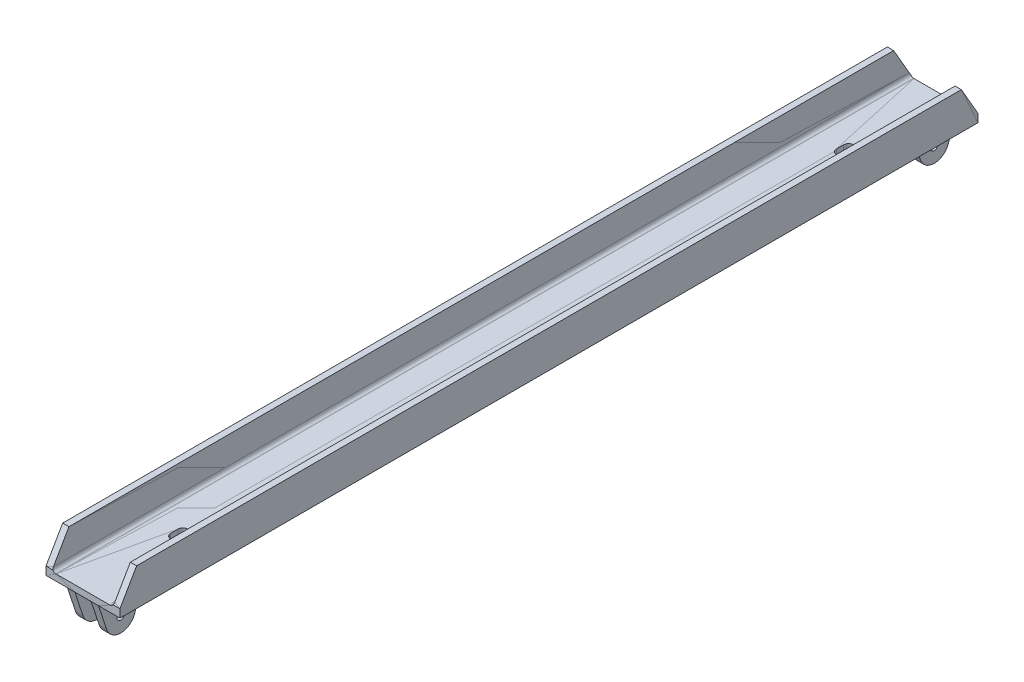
ISO-10303-21;
HEADER;
FILE_DESCRIPTION(('STEP AP214'),'2;1');
FILE_NAME('part.step','',(''),(''),'','','');
FILE_SCHEMA(('AUTOMOTIVE_DESIGN { 1 0 10303 214 1 1 1 1 }'));
ENDSEC;
DATA;
#1=APPLICATION_CONTEXT('core data for automotive mechanical design processes');
#2=APPLICATION_PROTOCOL_DEFINITION('international standard','automotive_design',2000,#1);
#3=PRODUCT_CONTEXT('',#1,'mechanical');
#4=PRODUCT('Part','Part','',(#3));
#5=PRODUCT_RELATED_PRODUCT_CATEGORY('part','',(#4));
#6=PRODUCT_DEFINITION_FORMATION('','',#4);
#7=PRODUCT_DEFINITION_CONTEXT('part definition',#1,'design');
#8=PRODUCT_DEFINITION('design','',#6,#7);
#9=PRODUCT_DEFINITION_SHAPE('','',#8);
#10=(LENGTH_UNIT() NAMED_UNIT(*) SI_UNIT(.MILLI.,.METRE.));
#11=(NAMED_UNIT(*) PLANE_ANGLE_UNIT() SI_UNIT($,.RADIAN.));
#12=(NAMED_UNIT(*) SI_UNIT($,.STERADIAN.) SOLID_ANGLE_UNIT());
#13=UNCERTAINTY_MEASURE_WITH_UNIT(LENGTH_MEASURE(1.E-05),#10,'distance_accuracy_value','');
#14=(GEOMETRIC_REPRESENTATION_CONTEXT(3) GLOBAL_UNCERTAINTY_ASSIGNED_CONTEXT((#13)) GLOBAL_UNIT_ASSIGNED_CONTEXT((#10,
#11,#12)) REPRESENTATION_CONTEXT('',''));
#15=CARTESIAN_POINT('',(0.,0.,0.));
#16=DIRECTION('',(0.,0.,1.));
#17=DIRECTION('',(1.,0.,0.));
#18=AXIS2_PLACEMENT_3D('',#15,#16,#17);
#19=CARTESIAN_POINT('',(26.937499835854,-37.,-30.));
#20=DIRECTION('',(-1.,0.,0.));
#21=DIRECTION('',(0.,-1.,0.));
#22=AXIS2_PLACEMENT_3D('',#19,#20,#21);
#23=CYLINDRICAL_SURFACE('',#22,5.);
#24=CARTESIAN_POINT('',(16.937499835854,-37.,-30.));
#25=DIRECTION('',(-1.,0.,0.));
#26=DIRECTION('',(0.,-1.,0.));
#27=AXIS2_PLACEMENT_3D('',#24,#25,#26);
#28=CIRCLE('',#27,5.);
#29=CARTESIAN_POINT('',(16.937499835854,-42.,-30.));
#30=VERTEX_POINT('',#29);
#31=EDGE_CURVE('P0_E724',#30,#30,#28,.F.);
#32=ORIENTED_EDGE('',*,*,#31,.F.);
#33=EDGE_LOOP('',(#32));
#34=FACE_BOUND('',#33,.T.);
#35=CARTESIAN_POINT('',(26.937499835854,-37.,-30.));
#36=DIRECTION('',(-1.,0.,0.));
#37=DIRECTION('',(0.,-1.,0.));
#38=AXIS2_PLACEMENT_3D('',#35,#36,#37);
#39=CIRCLE('',#38,5.);
#40=CARTESIAN_POINT('',(26.937499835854,-42.,-30.));
#41=VERTEX_POINT('',#40);
#42=EDGE_CURVE('P0_E558',#41,#41,#39,.T.);
#43=ORIENTED_EDGE('',*,*,#42,.F.);
#44=EDGE_LOOP('',(#43));
#45=FACE_BOUND('',#44,.T.);
#46=ADVANCED_FACE('P0_F348',(#34,#45),#23,.F.);
#47=CARTESIAN_POINT('',(-5.0625001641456,-37.,-30.));
#48=DIRECTION('',(-1.,0.,0.));
#49=DIRECTION('',(0.,0.,1.));
#50=AXIS2_PLACEMENT_3D('',#47,#48,#49);
#51=CYLINDRICAL_SURFACE('',#50,5.);
#52=CARTESIAN_POINT('',(-15.062500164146,-37.,-30.));
#53=DIRECTION('',(-1.,0.,0.));
#54=DIRECTION('',(0.,0.,1.));
#55=AXIS2_PLACEMENT_3D('',#52,#53,#54);
#56=CIRCLE('',#55,5.);
#57=CARTESIAN_POINT('',(-15.062500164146,-37.,-25.));
#58=VERTEX_POINT('',#57);
#59=EDGE_CURVE('P0_E712',#58,#58,#56,.F.);
#60=ORIENTED_EDGE('',*,*,#59,.F.);
#61=EDGE_LOOP('',(#60));
#62=FACE_BOUND('',#61,.T.);
#63=CARTESIAN_POINT('',(-5.0625001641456,-37.,-30.));
#64=DIRECTION('',(-1.,0.,0.));
#65=DIRECTION('',(0.,0.,1.));
#66=AXIS2_PLACEMENT_3D('',#63,#64,#65);
#67=CIRCLE('',#66,5.);
#68=CARTESIAN_POINT('',(-5.0625001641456,-37.,-25.));
#69=VERTEX_POINT('',#68);
#70=EDGE_CURVE('P0_E719',#69,#69,#67,.T.);
#71=ORIENTED_EDGE('',*,*,#70,.F.);
#72=EDGE_LOOP('',(#71));
#73=FACE_BOUND('',#72,.T.);
#74=ADVANCED_FACE('P0_F1350',(#62,#73),#51,.F.);
#75=CARTESIAN_POINT('',(-15.062500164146,-37.,-1130.));
#76=DIRECTION('',(1.,0.,0.));
#77=DIRECTION('',(0.,1.,0.));
#78=AXIS2_PLACEMENT_3D('',#75,#76,#77);
#79=CYLINDRICAL_SURFACE('',#78,4.99999999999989);
#80=CARTESIAN_POINT('',(-15.062500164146,-37.,-1130.));
#81=DIRECTION('',(1.,0.,0.));
#82=DIRECTION('',(0.,1.,0.));
#83=AXIS2_PLACEMENT_3D('',#80,#81,#82);
#84=CIRCLE('',#83,4.99999999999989);
#85=CARTESIAN_POINT('',(-15.062500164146,-32.0000000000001,-1130.));
#86=VERTEX_POINT('',#85);
#87=EDGE_CURVE('P0_E707',#86,#86,#84,.T.);
#88=ORIENTED_EDGE('',*,*,#87,.F.);
#89=EDGE_LOOP('',(#88));
#90=FACE_BOUND('',#89,.T.);
#91=CARTESIAN_POINT('',(-5.0625001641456,-37.,-1130.));
#92=DIRECTION('',(1.,0.,0.));
#93=DIRECTION('',(0.,1.,0.));
#94=AXIS2_PLACEMENT_3D('',#91,#92,#93);
#95=CIRCLE('',#94,4.99999999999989);
#96=CARTESIAN_POINT('',(-5.0625001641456,-32.0000000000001,-1130.));
#97=VERTEX_POINT('',#96);
#98=EDGE_CURVE('P0_E699',#97,#97,#95,.F.);
#99=ORIENTED_EDGE('',*,*,#98,.F.);
#100=EDGE_LOOP('',(#99));
#101=FACE_BOUND('',#100,.T.);
#102=ADVANCED_FACE('P0_F1346',(#90,#101),#79,.F.);
#103=CARTESIAN_POINT('',(16.937499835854,-37.,-1130.));
#104=DIRECTION('',(1.,0.,0.));
#105=DIRECTION('',(0.,0.,-1.));
#106=AXIS2_PLACEMENT_3D('',#103,#104,#105);
#107=CYLINDRICAL_SURFACE('',#106,4.99999999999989);
#108=CARTESIAN_POINT('',(16.937499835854,-37.,-1130.));
#109=DIRECTION('',(1.,0.,0.));
#110=DIRECTION('',(0.,0.,-1.));
#111=AXIS2_PLACEMENT_3D('',#108,#109,#110);
#112=CIRCLE('',#111,4.99999999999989);
#113=CARTESIAN_POINT('',(16.937499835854,-37.,-1135.));
#114=VERTEX_POINT('',#113);
#115=EDGE_CURVE('P0_E694',#114,#114,#112,.T.);
#116=ORIENTED_EDGE('',*,*,#115,.F.);
#117=EDGE_LOOP('',(#116));
#118=FACE_BOUND('',#117,.T.);
#119=CARTESIAN_POINT('',(26.937499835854,-37.,-1130.));
#120=DIRECTION('',(1.,0.,0.));
#121=DIRECTION('',(0.,0.,-1.));
#122=AXIS2_PLACEMENT_3D('',#119,#120,#121);
#123=CIRCLE('',#122,4.99999999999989);
#124=CARTESIAN_POINT('',(26.937499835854,-37.,-1135.));
#125=VERTEX_POINT('',#124);
#126=EDGE_CURVE('P0_E686',#125,#125,#123,.F.);
#127=ORIENTED_EDGE('',*,*,#126,.F.);
#128=EDGE_LOOP('',(#127));
#129=FACE_BOUND('',#128,.T.);
#130=ADVANCED_FACE('P0_F1343',(#118,#129),#107,.F.);
#131=CARTESIAN_POINT('',(-15.062500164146,-37.,-30.));
#132=DIRECTION('',(1.,0.,0.));
#133=DIRECTION('',(0.,0.,-1.));
#134=AXIS2_PLACEMENT_3D('',#131,#132,#133);
#135=CYLINDRICAL_SURFACE('',#134,20.);
#136=DIRECTION('',(1.,0.,0.));
#137=VECTOR('',#136,1.);
#138=CARTESIAN_POINT('',(-22.5910483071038,-43.282540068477,-11.012380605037));
#139=LINE('',#138,#137);
#140=CARTESIAN_POINT('',(-15.0625001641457,-43.2825400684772,-11.0123806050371));
#141=VERTEX_POINT('',#140);
#142=CARTESIAN_POINT('',(-5.0625001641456,-43.2825400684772,-11.0123806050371));
#143=VERTEX_POINT('',#142);
#144=EDGE_CURVE('P0_E570',#141,#143,#139,.T.);
#145=ORIENTED_EDGE('',*,*,#144,.F.);
#146=CARTESIAN_POINT('',(-15.062500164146,-37.,-30.));
#147=DIRECTION('',(1.,0.,0.));
#148=DIRECTION('',(0.,0.,-1.));
#149=AXIS2_PLACEMENT_3D('',#146,#147,#148);
#150=CIRCLE('',#149,20.);
#151=CARTESIAN_POINT('',(-15.062500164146,-43.2825400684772,-48.9876193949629));
#152=VERTEX_POINT('',#151);
#153=EDGE_CURVE('P0_E715',#152,#141,#150,.F.);
#154=ORIENTED_EDGE('',*,*,#153,.F.);
#155=DIRECTION('',(-1.,0.,0.));
#156=VECTOR('',#155,1.);
#157=CARTESIAN_POINT('',(-22.5910483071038,-43.282540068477,-48.987619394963));
#158=LINE('',#157,#156);
#159=CARTESIAN_POINT('',(-5.0625001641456,-43.2825400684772,-48.9876193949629));
#160=VERTEX_POINT('',#159);
#161=EDGE_CURVE('P0_E600',#160,#152,#158,.T.);
#162=ORIENTED_EDGE('',*,*,#161,.F.);
#163=CARTESIAN_POINT('',(-5.0625001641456,-37.,-30.));
#164=DIRECTION('',(1.,0.,0.));
#165=DIRECTION('',(0.,0.,-1.));
#166=AXIS2_PLACEMENT_3D('',#163,#164,#165);
#167=CIRCLE('',#166,20.);
#168=EDGE_CURVE('P0_E722',#143,#160,#167,.T.);
#169=ORIENTED_EDGE('',*,*,#168,.F.);
#170=EDGE_LOOP('',(#145,#154,#162,#169));
#171=FACE_BOUND('',#170,.T.);
#172=ADVANCED_FACE('P0_F928',(#171),#135,.T.);
#173=CARTESIAN_POINT('',(16.937499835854,-37.,-30.));
#174=DIRECTION('',(1.,0.,0.));
#175=DIRECTION('',(0.,0.,-1.));
#176=AXIS2_PLACEMENT_3D('',#173,#174,#175);
#177=CYLINDRICAL_SURFACE('',#176,20.);
#178=DIRECTION('',(1.,0.,0.));
#179=VECTOR('',#178,1.);
#180=CARTESIAN_POINT('',(9.4089516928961,-43.282540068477,-11.012380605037));
#181=LINE('',#180,#179);
#182=CARTESIAN_POINT('',(16.9374998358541,-43.2825400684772,-11.0123806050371));
#183=VERTEX_POINT('',#182);
#184=CARTESIAN_POINT('',(26.937499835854,-43.2825400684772,-11.0123806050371));
#185=VERTEX_POINT('',#184);
#186=EDGE_CURVE('P0_E552',#183,#185,#181,.T.);
#187=ORIENTED_EDGE('',*,*,#186,.F.);
#188=CARTESIAN_POINT('',(16.937499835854,-37.,-30.));
#189=DIRECTION('',(1.,0.,0.));
#190=DIRECTION('',(0.,0.,-1.));
#191=AXIS2_PLACEMENT_3D('',#188,#189,#190);
#192=CIRCLE('',#191,20.);
#193=CARTESIAN_POINT('',(16.937499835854,-43.2825400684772,-48.9876193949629));
#194=VERTEX_POINT('',#193);
#195=EDGE_CURVE('P0_E727',#194,#183,#192,.F.);
#196=ORIENTED_EDGE('',*,*,#195,.F.);
#197=DIRECTION('',(-1.,0.,0.));
#198=VECTOR('',#197,1.);
#199=CARTESIAN_POINT('',(9.4089516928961,-43.282540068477,-48.987619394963));
#200=LINE('',#199,#198);
#201=CARTESIAN_POINT('',(26.937499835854,-43.2825400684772,-48.9876193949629));
#202=VERTEX_POINT('',#201);
#203=EDGE_CURVE('P0_E554',#202,#194,#200,.T.);
#204=ORIENTED_EDGE('',*,*,#203,.F.);
#205=CARTESIAN_POINT('',(26.937499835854,-37.,-30.));
#206=DIRECTION('',(1.,0.,0.));
#207=DIRECTION('',(0.,0.,-1.));
#208=AXIS2_PLACEMENT_3D('',#205,#206,#207);
#209=CIRCLE('',#208,20.);
#210=EDGE_CURVE('P0_E352',#185,#202,#209,.T.);
#211=ORIENTED_EDGE('',*,*,#210,.F.);
#212=EDGE_LOOP('',(#187,#196,#204,#211));
#213=FACE_BOUND('',#212,.T.);
#214=ADVANCED_FACE('P0_F549',(#213),#177,.T.);
#215=CARTESIAN_POINT('',(55.937499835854,40.,-22.516660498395));
#216=DIRECTION('',(0.,1.,0.));
#217=DIRECTION('',(0.,0.,-1.));
#218=AXIS2_PLACEMENT_3D('',#215,#216,#217);
#219=PLANE('',#218);
#220=DIRECTION('',(0.,0.,-1.));
#221=VECTOR('',#220,1.);
#222=CARTESIAN_POINT('',(47.437499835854,40.,-579.999999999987));
#223=LINE('',#222,#221);
#224=CARTESIAN_POINT('',(47.437499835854,40.0000000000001,-22.5166604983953));
#225=VERTEX_POINT('',#224);
#226=CARTESIAN_POINT('',(47.4374998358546,40.0000000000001,-1137.4833395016));
#227=VERTEX_POINT('',#226);
#228=EDGE_CURVE('P0_E681',#225,#227,#223,.T.);
#229=ORIENTED_EDGE('',*,*,#228,.F.);
#230=DIRECTION('',(-1.,0.,0.));
#231=VECTOR('',#230,1.);
#232=CARTESIAN_POINT('',(5.9374998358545,40.0000000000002,-22.5166604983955));
#233=LINE('',#232,#231);
#234=CARTESIAN_POINT('',(55.937499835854,40.,-22.5166604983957));
#235=VERTEX_POINT('',#234);
#236=EDGE_CURVE('P0_E574',#235,#225,#233,.T.);
#237=ORIENTED_EDGE('',*,*,#236,.F.);
#238=DIRECTION('',(0.,0.,1.));
#239=VECTOR('',#238,1.);
#240=CARTESIAN_POINT('',(55.937499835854,39.9999999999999,-580.));
#241=LINE('',#240,#239);
#242=CARTESIAN_POINT('',(55.937499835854,40.,-1137.48333950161));
#243=VERTEX_POINT('',#242);
#244=EDGE_CURVE('P0_E672',#243,#235,#241,.T.);
#245=ORIENTED_EDGE('',*,*,#244,.F.);
#246=DIRECTION('',(1.,0.,0.));
#247=VECTOR('',#246,1.);
#248=CARTESIAN_POINT('',(5.9374998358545,40.0000000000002,-1137.4833395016));
#249=LINE('',#248,#247);
#250=EDGE_CURVE('P0_E676',#227,#243,#249,.T.);
#251=ORIENTED_EDGE('',*,*,#250,.F.);
#252=EDGE_LOOP('',(#229,#237,#245,#251));
#253=FACE_BOUND('',#252,.T.);
#254=ADVANCED_FACE('P0_F778',(#253),#219,.T.);
#255=CARTESIAN_POINT('',(26.937499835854,-37.,-1130.));
#256=DIRECTION('',(-1.,0.,0.));
#257=DIRECTION('',(0.,0.,1.));
#258=AXIS2_PLACEMENT_3D('',#255,#256,#257);
#259=CYLINDRICAL_SURFACE('',#258,20.);
#260=CARTESIAN_POINT('',(16.937499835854,-37.,-1130.));
#261=DIRECTION('',(-1.,0.,0.));
#262=DIRECTION('',(0.,0.,1.));
#263=AXIS2_PLACEMENT_3D('',#260,#261,#262);
#264=CIRCLE('',#263,20.);
#265=CARTESIAN_POINT('',(16.9374998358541,-43.2825400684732,-1148.987619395));
#266=VERTEX_POINT('',#265);
#267=CARTESIAN_POINT('',(16.937499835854,-43.2825400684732,-1111.012380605));
#268=VERTEX_POINT('',#267);
#269=EDGE_CURVE('P0_E697',#266,#268,#264,.T.);
#270=ORIENTED_EDGE('',*,*,#269,.F.);
#271=DIRECTION('',(-1.,0.,0.));
#272=VECTOR('',#271,1.);
#273=CARTESIAN_POINT('',(9.4089516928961,-43.282540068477,-1148.987619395));
#274=LINE('',#273,#272);
#275=CARTESIAN_POINT('',(26.937499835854,-43.2825400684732,-1148.987619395));
#276=VERTEX_POINT('',#275);
#277=EDGE_CURVE('P0_E671',#276,#266,#274,.T.);
#278=ORIENTED_EDGE('',*,*,#277,.F.);
#279=CARTESIAN_POINT('',(26.937499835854,-37.,-1130.));
#280=DIRECTION('',(-1.,0.,0.));
#281=DIRECTION('',(0.,0.,1.));
#282=AXIS2_PLACEMENT_3D('',#279,#280,#281);
#283=CIRCLE('',#282,20.);
#284=CARTESIAN_POINT('',(26.937499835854,-43.2825400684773,-1111.01238060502));
#285=VERTEX_POINT('',#284);
#286=EDGE_CURVE('P0_E689',#285,#276,#283,.F.);
#287=ORIENTED_EDGE('',*,*,#286,.F.);
#288=DIRECTION('',(1.,0.,0.));
#289=VECTOR('',#288,1.);
#290=CARTESIAN_POINT('',(9.4089516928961,-43.282540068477,-1111.012380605));
#291=LINE('',#290,#289);
#292=EDGE_CURVE('P0_E592',#268,#285,#291,.T.);
#293=ORIENTED_EDGE('',*,*,#292,.F.);
#294=EDGE_LOOP('',(#270,#278,#287,#293));
#295=FACE_BOUND('',#294,.T.);
#296=ADVANCED_FACE('P0_F1188',(#295),#259,.T.);
#297=CARTESIAN_POINT('',(-5.0625001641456,-37.,-1130.));
#298=DIRECTION('',(-1.,0.,0.));
#299=DIRECTION('',(0.,0.,1.));
#300=AXIS2_PLACEMENT_3D('',#297,#298,#299);
#301=CYLINDRICAL_SURFACE('',#300,20.);
#302=CARTESIAN_POINT('',(-15.062500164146,-37.,-1130.));
#303=DIRECTION('',(-1.,0.,0.));
#304=DIRECTION('',(0.,0.,1.));
#305=AXIS2_PLACEMENT_3D('',#302,#303,#304);
#306=CIRCLE('',#305,20.);
#307=CARTESIAN_POINT('',(-15.0625001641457,-43.2825400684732,-1148.987619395));
#308=VERTEX_POINT('',#307);
#309=CARTESIAN_POINT('',(-15.062500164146,-43.2825400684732,-1111.012380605));
#310=VERTEX_POINT('',#309);
#311=EDGE_CURVE('P0_E710',#308,#310,#306,.T.);
#312=ORIENTED_EDGE('',*,*,#311,.F.);
#313=DIRECTION('',(-1.,0.,0.));
#314=VECTOR('',#313,1.);
#315=CARTESIAN_POINT('',(-22.5910483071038,-43.282540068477,-1148.987619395));
#316=LINE('',#315,#314);
#317=CARTESIAN_POINT('',(-5.0625001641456,-43.2825400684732,-1148.987619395));
#318=VERTEX_POINT('',#317);
#319=EDGE_CURVE('P0_E754',#318,#308,#316,.T.);
#320=ORIENTED_EDGE('',*,*,#319,.F.);
#321=CARTESIAN_POINT('',(-5.0625001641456,-37.,-1130.));
#322=DIRECTION('',(-1.,0.,0.));
#323=DIRECTION('',(0.,0.,1.));
#324=AXIS2_PLACEMENT_3D('',#321,#322,#323);
#325=CIRCLE('',#324,20.);
#326=CARTESIAN_POINT('',(-5.0625001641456,-43.2825400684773,-1111.01238060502));
#327=VERTEX_POINT('',#326);
#328=EDGE_CURVE('P0_E702',#327,#318,#325,.F.);
#329=ORIENTED_EDGE('',*,*,#328,.F.);
#330=DIRECTION('',(1.,0.,0.));
#331=VECTOR('',#330,1.);
#332=CARTESIAN_POINT('',(-22.5910483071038,-43.282540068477,-1111.012380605));
#333=LINE('',#332,#331);
#334=EDGE_CURVE('P0_E596',#310,#327,#333,.T.);
#335=ORIENTED_EDGE('',*,*,#334,.F.);
#336=EDGE_LOOP('',(#312,#320,#329,#335));
#337=FACE_BOUND('',#336,.T.);
#338=ADVANCED_FACE('P0_F1191',(#337),#301,.T.);
#339=CARTESIAN_POINT('',(55.937499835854,40.,-22.516660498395));
#340=DIRECTION('',(0.,1.,0.));
#341=DIRECTION('',(0.,0.,-1.));
#342=AXIS2_PLACEMENT_3D('',#339,#340,#341);
#343=PLANE('',#342);
#344=DIRECTION('',(0.,0.,-1.));
#345=VECTOR('',#344,1.);
#346=CARTESIAN_POINT('',(-44.062500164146,40.,-580.));
#347=LINE('',#346,#345);
#348=CARTESIAN_POINT('',(-44.062500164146,40.0000000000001,-22.5166604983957));
#349=VERTEX_POINT('',#348);
#350=CARTESIAN_POINT('',(-44.062500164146,40.0000000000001,-1137.4833395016));
#351=VERTEX_POINT('',#350);
#352=EDGE_CURVE('P0_E667',#349,#351,#347,.T.);
#353=ORIENTED_EDGE('',*,*,#352,.F.);
#354=DIRECTION('',(-1.,0.,0.));
#355=VECTOR('',#354,1.);
#356=CARTESIAN_POINT('',(5.9374998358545,40.0000000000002,-22.5166604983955));
#357=LINE('',#356,#355);
#358=CARTESIAN_POINT('',(-35.562500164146,40.0000000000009,-22.5166604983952));
#359=VERTEX_POINT('',#358);
#360=EDGE_CURVE('P0_E685',#359,#349,#357,.T.);
#361=ORIENTED_EDGE('',*,*,#360,.F.);
#362=DIRECTION('',(0.,0.,1.));
#363=VECTOR('',#362,1.);
#364=CARTESIAN_POINT('',(-35.562500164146,40.0000000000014,-579.999999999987));
#365=LINE('',#364,#363);
#366=CARTESIAN_POINT('',(-35.562500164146,40.0000000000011,-1137.48333950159));
#367=VERTEX_POINT('',#366);
#368=EDGE_CURVE('P0_E587',#367,#359,#365,.T.);
#369=ORIENTED_EDGE('',*,*,#368,.F.);
#370=DIRECTION('',(1.,0.,0.));
#371=VECTOR('',#370,1.);
#372=CARTESIAN_POINT('',(5.9374998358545,40.0000000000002,-1137.4833395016));
#373=LINE('',#372,#371);
#374=EDGE_CURVE('P0_E663',#351,#367,#373,.T.);
#375=ORIENTED_EDGE('',*,*,#374,.F.);
#376=EDGE_LOOP('',(#353,#361,#369,#375));
#377=FACE_BOUND('',#376,.T.);
#378=ADVANCED_FACE('P0_F1110',(#377),#343,.T.);
#379=CARTESIAN_POINT('',(26.937499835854,-10.,-60.));
#380=DIRECTION('',(1.,0.,0.));
#381=DIRECTION('',(0.,0.,1.));
#382=AXIS2_PLACEMENT_3D('',#379,#380,#381);
#383=PLANE('',#382);
#384=ORIENTED_EDGE('',*,*,#42,.T.);
#385=EDGE_LOOP('',(#384));
#386=FACE_BOUND('',#385,.T.);
#387=DIRECTION('',(0.,-0.949380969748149,0.314127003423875));
#388=VECTOR('',#387,1.);
#389=CARTESIAN_POINT('',(26.937499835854,-26.6412700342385,-54.4938096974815));
#390=LINE('',#389,#388);
#391=CARTESIAN_POINT('',(26.9374998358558,-10.0000000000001,-59.9999999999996));
#392=VERTEX_POINT('',#391);
#393=EDGE_CURVE('P0_E605',#392,#202,#390,.T.);
#394=ORIENTED_EDGE('',*,*,#393,.F.);
#395=DIRECTION('',(0.,0.,-1.));
#396=VECTOR('',#395,1.);
#397=CARTESIAN_POINT('',(26.9374998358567,-10.,-580.));
#398=LINE('',#397,#396);
#399=CARTESIAN_POINT('',(26.9374998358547,-10.,0.));
#400=VERTEX_POINT('',#399);
#401=EDGE_CURVE('P0_E565',#400,#392,#398,.T.);
#402=ORIENTED_EDGE('',*,*,#401,.F.);
#403=DIRECTION('',(0.,0.94938096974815,0.314127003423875));
#404=VECTOR('',#403,1.);
#405=CARTESIAN_POINT('',(26.937499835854,-26.6412700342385,-5.5061903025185));
#406=LINE('',#405,#404);
#407=EDGE_CURVE('P0_E561',#185,#400,#406,.T.);
#408=ORIENTED_EDGE('',*,*,#407,.F.);
#409=ORIENTED_EDGE('',*,*,#210,.T.);
#410=EDGE_LOOP('',(#394,#402,#408,#409));
#411=FACE_BOUND('',#410,.T.);
#412=ADVANCED_FACE('P0_F562',(#386,#411),#383,.T.);
#413=CARTESIAN_POINT('',(26.937499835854,-43.282540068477,-48.987619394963));
#414=DIRECTION('',(0.,-0.314127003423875,-0.949380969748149));
#415=DIRECTION('',(-1.,0.,0.));
#416=AXIS2_PLACEMENT_3D('',#413,#414,#415);
#417=PLANE('',#416);
#418=DIRECTION('',(0.,-0.949380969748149,0.314127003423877));
#419=VECTOR('',#418,1.);
#420=CARTESIAN_POINT('',(16.937499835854,-10.,-60.));
#421=LINE('',#420,#419);
#422=CARTESIAN_POINT('',(16.9374998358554,-10.,-59.9999999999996));
#423=VERTEX_POINT('',#422);
#424=EDGE_CURVE('P0_E604',#423,#194,#421,.T.);
#425=ORIENTED_EDGE('',*,*,#424,.F.);
#426=DIRECTION('',(-1.,0.,0.));
#427=VECTOR('',#426,1.);
#428=CARTESIAN_POINT('',(535.937499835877,-10.,-59.9999999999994));
#429=LINE('',#428,#427);
#430=EDGE_CURVE('P0_E801',#392,#423,#429,.T.);
#431=ORIENTED_EDGE('',*,*,#430,.F.);
#432=ORIENTED_EDGE('',*,*,#393,.T.);
#433=ORIENTED_EDGE('',*,*,#203,.T.);
#434=EDGE_LOOP('',(#425,#431,#432,#433));
#435=FACE_BOUND('',#434,.T.);
#436=ADVANCED_FACE('P0_F894',(#435),#417,.T.);
#437=CARTESIAN_POINT('',(16.937499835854,-10.,0.));
#438=DIRECTION('',(-1.,0.,0.));
#439=DIRECTION('',(0.,0.,-1.));
#440=AXIS2_PLACEMENT_3D('',#437,#438,#439);
#441=PLANE('',#440);
#442=ORIENTED_EDGE('',*,*,#31,.T.);
#443=EDGE_LOOP('',(#442));
#444=FACE_BOUND('',#443,.T.);
#445=ORIENTED_EDGE('',*,*,#195,.T.);
#446=DIRECTION('',(0.,-0.949380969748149,-0.314127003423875));
#447=VECTOR('',#446,1.);
#448=CARTESIAN_POINT('',(16.9374998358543,-26.6412700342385,-5.5061903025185));
#449=LINE('',#448,#447);
#450=CARTESIAN_POINT('',(16.9374998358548,-10.,0.));
#451=VERTEX_POINT('',#450);
#452=EDGE_CURVE('P0_E569',#451,#183,#449,.T.);
#453=ORIENTED_EDGE('',*,*,#452,.F.);
#454=DIRECTION('',(0.,0.,1.));
#455=VECTOR('',#454,1.);
#456=CARTESIAN_POINT('',(16.9374998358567,-10.,-580.));
#457=LINE('',#456,#455);
#458=EDGE_CURVE('P0_E818',#423,#451,#457,.T.);
#459=ORIENTED_EDGE('',*,*,#458,.F.);
#460=ORIENTED_EDGE('',*,*,#424,.T.);
#461=EDGE_LOOP('',(#445,#453,#459,#460));
#462=FACE_BOUND('',#461,.T.);
#463=ADVANCED_FACE('P0_F896',(#444,#462),#441,.T.);
#464=CARTESIAN_POINT('',(-5.0625001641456,-10.,-60.));
#465=DIRECTION('',(1.,0.,0.));
#466=DIRECTION('',(0.,0.,1.));
#467=AXIS2_PLACEMENT_3D('',#464,#465,#466);
#468=PLANE('',#467);
#469=ORIENTED_EDGE('',*,*,#70,.T.);
#470=EDGE_LOOP('',(#469));
#471=FACE_BOUND('',#470,.T.);
#472=DIRECTION('',(0.,-0.949380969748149,0.314127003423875));
#473=VECTOR('',#472,1.);
#474=CARTESIAN_POINT('',(-5.0625001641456,-26.6412700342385,-54.4938096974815));
#475=LINE('',#474,#473);
#476=CARTESIAN_POINT('',(-5.06250016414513,-10.0000000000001,-59.9999999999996));
#477=VERTEX_POINT('',#476);
#478=EDGE_CURVE('P0_E603',#477,#160,#475,.T.);
#479=ORIENTED_EDGE('',*,*,#478,.F.);
#480=DIRECTION('',(0.,0.,-1.));
#481=VECTOR('',#480,1.);
#482=CARTESIAN_POINT('',(-5.06250016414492,-10.,-580.));
#483=LINE('',#482,#481);
#484=CARTESIAN_POINT('',(-5.06250016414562,-10.,0.));
#485=VERTEX_POINT('',#484);
#486=EDGE_CURVE('P0_E821',#485,#477,#483,.T.);
#487=ORIENTED_EDGE('',*,*,#486,.F.);
#488=DIRECTION('',(0.,0.94938096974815,0.314127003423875));
#489=VECTOR('',#488,1.);
#490=CARTESIAN_POINT('',(-5.0625001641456,-26.6412700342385,-5.5061903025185));
#491=LINE('',#490,#489);
#492=EDGE_CURVE('P0_E753',#143,#485,#491,.T.);
#493=ORIENTED_EDGE('',*,*,#492,.F.);
#494=ORIENTED_EDGE('',*,*,#168,.T.);
#495=EDGE_LOOP('',(#479,#487,#493,#494));
#496=FACE_BOUND('',#495,.T.);
#497=ADVANCED_FACE('P0_F913',(#471,#496),#468,.T.);
#498=CARTESIAN_POINT('',(-5.0625001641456,-43.282540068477,-48.987619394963));
#499=DIRECTION('',(0.,-0.314127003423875,-0.949380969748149));
#500=DIRECTION('',(-1.,0.,0.));
#501=AXIS2_PLACEMENT_3D('',#498,#499,#500);
#502=PLANE('',#501);
#503=DIRECTION('',(0.,-0.949380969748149,0.314127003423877));
#504=VECTOR('',#503,1.);
#505=CARTESIAN_POINT('',(-15.062500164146,-10.,-60.));
#506=LINE('',#505,#504);
#507=CARTESIAN_POINT('',(-15.0625001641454,-10.,-59.9999999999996));
#508=VERTEX_POINT('',#507);
#509=EDGE_CURVE('P0_E602',#508,#152,#506,.T.);
#510=ORIENTED_EDGE('',*,*,#509,.F.);
#511=DIRECTION('',(-1.,0.,0.));
#512=VECTOR('',#511,1.);
#513=CARTESIAN_POINT('',(535.937499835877,-10.,-59.9999999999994));
#514=LINE('',#513,#512);
#515=EDGE_CURVE('P0_E826',#477,#508,#514,.T.);
#516=ORIENTED_EDGE('',*,*,#515,.F.);
#517=ORIENTED_EDGE('',*,*,#478,.T.);
#518=ORIENTED_EDGE('',*,*,#161,.T.);
#519=EDGE_LOOP('',(#510,#516,#517,#518));
#520=FACE_BOUND('',#519,.T.);
#521=ADVANCED_FACE('P0_F917',(#520),#502,.T.);
#522=CARTESIAN_POINT('',(-15.062500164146,-10.,0.));
#523=DIRECTION('',(-1.,0.,0.));
#524=DIRECTION('',(0.,0.,-1.));
#525=AXIS2_PLACEMENT_3D('',#522,#523,#524);
#526=PLANE('',#525);
#527=ORIENTED_EDGE('',*,*,#59,.T.);
#528=EDGE_LOOP('',(#527));
#529=FACE_BOUND('',#528,.T.);
#530=ORIENTED_EDGE('',*,*,#153,.T.);
#531=DIRECTION('',(0.,-0.949380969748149,-0.314127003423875));
#532=VECTOR('',#531,1.);
#533=CARTESIAN_POINT('',(-15.0625001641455,-26.6412700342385,-5.5061903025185));
#534=LINE('',#533,#532);
#535=CARTESIAN_POINT('',(-15.0625001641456,-10.,0.));
#536=VERTEX_POINT('',#535);
#537=EDGE_CURVE('P0_E586',#536,#141,#534,.T.);
#538=ORIENTED_EDGE('',*,*,#537,.F.);
#539=DIRECTION('',(0.,0.,1.));
#540=VECTOR('',#539,1.);
#541=CARTESIAN_POINT('',(-15.0625001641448,-10.,-580.));
#542=LINE('',#541,#540);
#543=EDGE_CURVE('P0_E847',#508,#536,#542,.T.);
#544=ORIENTED_EDGE('',*,*,#543,.F.);
#545=ORIENTED_EDGE('',*,*,#509,.T.);
#546=EDGE_LOOP('',(#530,#538,#544,#545));
#547=FACE_BOUND('',#546,.T.);
#548=ADVANCED_FACE('P0_F930',(#529,#547),#526,.T.);
#549=CARTESIAN_POINT('',(-15.062500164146,-100.668515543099,-1160.));
#550=DIRECTION('',(-1.,0.,0.));
#551=DIRECTION('',(0.,0.,1.));
#552=AXIS2_PLACEMENT_3D('',#549,#550,#551);
#553=PLANE('',#552);
#554=ORIENTED_EDGE('',*,*,#87,.T.);
#555=EDGE_LOOP('',(#554));
#556=FACE_BOUND('',#555,.T.);
#557=DIRECTION('',(0.,-0.949380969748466,-0.314127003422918));
#558=VECTOR('',#557,1.);
#559=CARTESIAN_POINT('',(-15.0625001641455,-26.6412700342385,-1105.5061903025));
#560=LINE('',#559,#558);
#561=CARTESIAN_POINT('',(-15.0625001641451,-10.0000000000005,-1100.));
#562=VERTEX_POINT('',#561);
#563=EDGE_CURVE('P0_E599',#562,#310,#560,.T.);
#564=ORIENTED_EDGE('',*,*,#563,.F.);
#565=DIRECTION('',(0.,0.,1.));
#566=VECTOR('',#565,1.);
#567=CARTESIAN_POINT('',(-15.0625001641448,-10.,-580.));
#568=LINE('',#567,#566);
#569=CARTESIAN_POINT('',(-15.0625001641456,-10.,-1160.));
#570=VERTEX_POINT('',#569);
#571=EDGE_CURVE('P0_E873',#570,#562,#568,.T.);
#572=ORIENTED_EDGE('',*,*,#571,.F.);
#573=DIRECTION('',(0.,0.949380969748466,-0.314127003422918));
#574=VECTOR('',#573,1.);
#575=CARTESIAN_POINT('',(-15.0625001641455,-26.6412700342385,-1154.4938096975));
#576=LINE('',#575,#574);
#577=EDGE_CURVE('P0_E757',#308,#570,#576,.T.);
#578=ORIENTED_EDGE('',*,*,#577,.F.);
#579=ORIENTED_EDGE('',*,*,#311,.T.);
#580=EDGE_LOOP('',(#564,#572,#578,#579));
#581=FACE_BOUND('',#580,.T.);
#582=ADVANCED_FACE('P0_F1206',(#556,#581),#553,.T.);
#583=CARTESIAN_POINT('',(-5.0625001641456,-10.,-1100.));
#584=DIRECTION('',(0.,-0.314127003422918,0.949380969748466));
#585=DIRECTION('',(-1.,0.,0.));
#586=AXIS2_PLACEMENT_3D('',#583,#584,#585);
#587=PLANE('',#586);
#588=ORIENTED_EDGE('',*,*,#334,.T.);
#589=DIRECTION('',(0.,-0.949380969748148,-0.314127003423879));
#590=VECTOR('',#589,1.);
#591=CARTESIAN_POINT('',(-5.0625001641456,-10.0000000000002,-1100.));
#592=LINE('',#591,#590);
#593=CARTESIAN_POINT('',(-5.06250016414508,-10.,-1100.));
#594=VERTEX_POINT('',#593);
#595=EDGE_CURVE('P0_E598',#594,#327,#592,.T.);
#596=ORIENTED_EDGE('',*,*,#595,.F.);
#597=DIRECTION('',(1.,0.,0.));
#598=VECTOR('',#597,1.);
#599=CARTESIAN_POINT('',(535.937499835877,-10.,-1100.00000000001));
#600=LINE('',#599,#598);
#601=EDGE_CURVE('P0_E869',#562,#594,#600,.T.);
#602=ORIENTED_EDGE('',*,*,#601,.F.);
#603=ORIENTED_EDGE('',*,*,#563,.T.);
#604=EDGE_LOOP('',(#588,#596,#602,#603));
#605=FACE_BOUND('',#604,.T.);
#606=ADVANCED_FACE('P0_F1210',(#605),#587,.T.);
#607=CARTESIAN_POINT('',(-5.0625001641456,-100.668515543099,-1100.));
#608=DIRECTION('',(1.,0.,0.));
#609=DIRECTION('',(0.,0.,-1.));
#610=AXIS2_PLACEMENT_3D('',#607,#608,#609);
#611=PLANE('',#610);
#612=ORIENTED_EDGE('',*,*,#98,.T.);
#613=EDGE_LOOP('',(#612));
#614=FACE_BOUND('',#613,.T.);
#615=ORIENTED_EDGE('',*,*,#328,.T.);
#616=DIRECTION('',(0.,-0.949380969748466,0.314127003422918));
#617=VECTOR('',#616,1.);
#618=CARTESIAN_POINT('',(-5.0625001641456,-26.6412700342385,-1154.4938096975));
#619=LINE('',#618,#617);
#620=CARTESIAN_POINT('',(-5.06250016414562,-10.,-1160.));
#621=VERTEX_POINT('',#620);
#622=EDGE_CURVE('P0_E668',#621,#318,#619,.T.);
#623=ORIENTED_EDGE('',*,*,#622,.F.);
#624=DIRECTION('',(0.,0.,-1.));
#625=VECTOR('',#624,1.);
#626=CARTESIAN_POINT('',(-5.06250016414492,-10.,-580.));
#627=LINE('',#626,#625);
#628=EDGE_CURVE('P0_E872',#594,#621,#627,.T.);
#629=ORIENTED_EDGE('',*,*,#628,.F.);
#630=ORIENTED_EDGE('',*,*,#595,.T.);
#631=EDGE_LOOP('',(#615,#623,#629,#630));
#632=FACE_BOUND('',#631,.T.);
#633=ADVANCED_FACE('P0_F1214',(#614,#632),#611,.T.);
#634=CARTESIAN_POINT('',(16.937499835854,-100.668515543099,-1160.));
#635=DIRECTION('',(-1.,0.,0.));
#636=DIRECTION('',(0.,0.,1.));
#637=AXIS2_PLACEMENT_3D('',#634,#635,#636);
#638=PLANE('',#637);
#639=ORIENTED_EDGE('',*,*,#115,.T.);
#640=EDGE_LOOP('',(#639));
#641=FACE_BOUND('',#640,.T.);
#642=DIRECTION('',(0.,-0.949380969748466,-0.314127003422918));
#643=VECTOR('',#642,1.);
#644=CARTESIAN_POINT('',(16.9374998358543,-26.6412700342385,-1105.5061903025));
#645=LINE('',#644,#643);
#646=CARTESIAN_POINT('',(16.9374998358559,-10.0000000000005,-1100.));
#647=VERTEX_POINT('',#646);
#648=EDGE_CURVE('P0_E595',#647,#268,#645,.T.);
#649=ORIENTED_EDGE('',*,*,#648,.F.);
#650=DIRECTION('',(0.,0.,1.));
#651=VECTOR('',#650,1.);
#652=CARTESIAN_POINT('',(16.9374998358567,-10.,-580.));
#653=LINE('',#652,#651);
#654=CARTESIAN_POINT('',(16.9374998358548,-10.,-1160.));
#655=VERTEX_POINT('',#654);
#656=EDGE_CURVE('P0_E862',#655,#647,#653,.T.);
#657=ORIENTED_EDGE('',*,*,#656,.F.);
#658=DIRECTION('',(0.,0.949380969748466,-0.314127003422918));
#659=VECTOR('',#658,1.);
#660=CARTESIAN_POINT('',(16.9374998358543,-26.6412700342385,-1154.4938096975));
#661=LINE('',#660,#659);
#662=EDGE_CURVE('P0_E760',#266,#655,#661,.T.);
#663=ORIENTED_EDGE('',*,*,#662,.F.);
#664=ORIENTED_EDGE('',*,*,#269,.T.);
#665=EDGE_LOOP('',(#649,#657,#663,#664));
#666=FACE_BOUND('',#665,.T.);
#667=ADVANCED_FACE('P0_F1091',(#641,#666),#638,.T.);
#668=CARTESIAN_POINT('',(26.937499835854,-10.,-1100.));
#669=DIRECTION('',(0.,-0.314127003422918,0.949380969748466));
#670=DIRECTION('',(-1.,0.,0.));
#671=AXIS2_PLACEMENT_3D('',#668,#669,#670);
#672=PLANE('',#671);
#673=ORIENTED_EDGE('',*,*,#292,.T.);
#674=DIRECTION('',(0.,-0.949380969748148,-0.314127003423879));
#675=VECTOR('',#674,1.);
#676=CARTESIAN_POINT('',(26.937499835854,-10.0000000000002,-1100.));
#677=LINE('',#676,#675);
#678=CARTESIAN_POINT('',(26.937499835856,-10.,-1100.));
#679=VERTEX_POINT('',#678);
#680=EDGE_CURVE('P0_E594',#679,#285,#677,.T.);
#681=ORIENTED_EDGE('',*,*,#680,.F.);
#682=DIRECTION('',(1.,0.,0.));
#683=VECTOR('',#682,1.);
#684=CARTESIAN_POINT('',(535.937499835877,-10.,-1100.00000000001));
#685=LINE('',#684,#683);
#686=EDGE_CURVE('P0_E858',#647,#679,#685,.T.);
#687=ORIENTED_EDGE('',*,*,#686,.F.);
#688=ORIENTED_EDGE('',*,*,#648,.T.);
#689=EDGE_LOOP('',(#673,#681,#687,#688));
#690=FACE_BOUND('',#689,.T.);
#691=ADVANCED_FACE('P0_F1221',(#690),#672,.T.);
#692=CARTESIAN_POINT('',(26.937499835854,-100.668515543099,-1100.));
#693=DIRECTION('',(1.,0.,0.));
#694=DIRECTION('',(0.,0.,-1.));
#695=AXIS2_PLACEMENT_3D('',#692,#693,#694);
#696=PLANE('',#695);
#697=ORIENTED_EDGE('',*,*,#126,.T.);
#698=EDGE_LOOP('',(#697));
#699=FACE_BOUND('',#698,.T.);
#700=ORIENTED_EDGE('',*,*,#286,.T.);
#701=DIRECTION('',(0.,-0.949380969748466,0.314127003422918));
#702=VECTOR('',#701,1.);
#703=CARTESIAN_POINT('',(26.937499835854,-26.6412700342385,-1154.4938096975));
#704=LINE('',#703,#702);
#705=CARTESIAN_POINT('',(26.9374998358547,-10.,-1160.));
#706=VERTEX_POINT('',#705);
#707=EDGE_CURVE('P0_E758',#706,#276,#704,.T.);
#708=ORIENTED_EDGE('',*,*,#707,.F.);
#709=DIRECTION('',(0.,0.,-1.));
#710=VECTOR('',#709,1.);
#711=CARTESIAN_POINT('',(26.9374998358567,-10.,-580.));
#712=LINE('',#711,#710);
#713=EDGE_CURVE('P0_E861',#679,#706,#712,.T.);
#714=ORIENTED_EDGE('',*,*,#713,.F.);
#715=ORIENTED_EDGE('',*,*,#680,.T.);
#716=EDGE_LOOP('',(#700,#708,#714,#715));
#717=FACE_BOUND('',#716,.T.);
#718=ADVANCED_FACE('P0_F1225',(#699,#717),#696,.T.);
#719=CARTESIAN_POINT('',(55.937499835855,0.99999999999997,0.));
#720=DIRECTION('',(0.,0.499999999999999,0.866025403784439));
#721=DIRECTION('',(0.,0.866025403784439,-0.499999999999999));
#722=AXIS2_PLACEMENT_3D('',#719,#720,#721);
#723=PLANE('',#722);
#724=ORIENTED_EDGE('',*,*,#360,.T.);
#725=DIRECTION('',(0.,0.866025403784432,-0.500000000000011));
#726=VECTOR('',#725,1.);
#727=CARTESIAN_POINT('',(-44.062500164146,1.00000000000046,0.));
#728=LINE('',#727,#726);
#729=CARTESIAN_POINT('',(-44.062500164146,1.00000000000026,0.));
#730=VERTEX_POINT('',#729);
#731=EDGE_CURVE('P0_E664',#730,#349,#728,.T.);
#732=ORIENTED_EDGE('',*,*,#731,.F.);
#733=DIRECTION('',(-1.,0.,0.));
#734=VECTOR('',#733,1.);
#735=CARTESIAN_POINT('',(5.937499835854,1.,0.));
#736=LINE('',#735,#734);
#737=CARTESIAN_POINT('',(-34.8926271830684,0.999999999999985,0.));
#738=VERTEX_POINT('',#737);
#739=EDGE_CURVE('P0_E855',#738,#730,#736,.T.);
#740=ORIENTED_EDGE('',*,*,#739,.F.);
#741=CARTESIAN_POINT('',(-30.562500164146,3.5,-1.44337567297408));
#742=DIRECTION('',(0.,0.499999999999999,0.866025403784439));
#743=DIRECTION('',(0.,0.866025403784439,-0.499999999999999));
#744=AXIS2_PLACEMENT_3D('',#741,#742,#743);
#745=ELLIPSE('',#744,5.77350269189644,5.00000000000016);
#746=CARTESIAN_POINT('',(-35.5625001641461,3.5,-1.44337567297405));
#747=VERTEX_POINT('',#746);
#748=EDGE_CURVE('P0_E683',#738,#747,#745,.F.);
#749=ORIENTED_EDGE('',*,*,#748,.T.);
#750=DIRECTION('',(0.,-0.866025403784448,0.499999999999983));
#751=VECTOR('',#750,1.);
#752=CARTESIAN_POINT('',(-35.562500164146,40.0000000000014,-22.5166604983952));
#753=LINE('',#752,#751);
#754=EDGE_CURVE('P0_E590',#359,#747,#753,.T.);
#755=ORIENTED_EDGE('',*,*,#754,.F.);
#756=EDGE_LOOP('',(#724,#732,#740,#749,#755));
#757=FACE_BOUND('',#756,.T.);
#758=ADVANCED_FACE('P0_F1130',(#757),#723,.T.);
#759=CARTESIAN_POINT('',(-5.0625001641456,-10.,0.));
#760=DIRECTION('',(0.,-0.314127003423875,0.94938096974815));
#761=DIRECTION('',(-1.,0.,0.));
#762=AXIS2_PLACEMENT_3D('',#759,#760,#761);
#763=PLANE('',#762);
#764=ORIENTED_EDGE('',*,*,#537,.T.);
#765=ORIENTED_EDGE('',*,*,#144,.T.);
#766=ORIENTED_EDGE('',*,*,#492,.T.);
#767=DIRECTION('',(1.,0.,0.));
#768=VECTOR('',#767,1.);
#769=CARTESIAN_POINT('',(5.937499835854,-10.,0.));
#770=LINE('',#769,#768);
#771=EDGE_CURVE('P0_E815',#536,#485,#770,.T.);
#772=ORIENTED_EDGE('',*,*,#771,.F.);
#773=EDGE_LOOP('',(#764,#765,#766,#772));
#774=FACE_BOUND('',#773,.T.);
#775=ADVANCED_FACE('P0_F924',(#774),#763,.T.);
#776=CARTESIAN_POINT('',(26.937499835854,-10.,0.));
#777=DIRECTION('',(0.,-0.314127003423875,0.94938096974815));
#778=DIRECTION('',(-1.,0.,0.));
#779=AXIS2_PLACEMENT_3D('',#776,#777,#778);
#780=PLANE('',#779);
#781=ORIENTED_EDGE('',*,*,#452,.T.);
#782=ORIENTED_EDGE('',*,*,#186,.T.);
#783=ORIENTED_EDGE('',*,*,#407,.T.);
#784=DIRECTION('',(1.,0.,0.));
#785=VECTOR('',#784,1.);
#786=CARTESIAN_POINT('',(5.937499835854,-10.,0.));
#787=LINE('',#786,#785);
#788=EDGE_CURVE('P0_E797',#451,#400,#787,.T.);
#789=ORIENTED_EDGE('',*,*,#788,.F.);
#790=EDGE_LOOP('',(#781,#782,#783,#789));
#791=FACE_BOUND('',#790,.T.);
#792=ADVANCED_FACE('P0_F572',(#791),#780,.T.);
#793=CARTESIAN_POINT('',(55.937499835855,0.99999999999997,0.));
#794=DIRECTION('',(0.,0.499999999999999,0.866025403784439));
#795=DIRECTION('',(0.,0.866025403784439,-0.499999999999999));
#796=AXIS2_PLACEMENT_3D('',#793,#794,#795);
#797=PLANE('',#796);
#798=DIRECTION('',(0.,0.866025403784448,-0.499999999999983));
#799=VECTOR('',#798,1.);
#800=CARTESIAN_POINT('',(47.437499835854,3.49999999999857,-1.443375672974));
#801=LINE('',#800,#799);
#802=CARTESIAN_POINT('',(47.4374998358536,3.49999999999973,-1.44337567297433));
#803=VERTEX_POINT('',#802);
#804=EDGE_CURVE('P0_E677',#803,#225,#801,.T.);
#805=ORIENTED_EDGE('',*,*,#804,.F.);
#806=CARTESIAN_POINT('',(42.437499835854,3.5,-1.44337567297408));
#807=DIRECTION('',(0.,0.499999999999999,0.866025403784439));
#808=DIRECTION('',(0.,0.866025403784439,-0.499999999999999));
#809=AXIS2_PLACEMENT_3D('',#806,#807,#808);
#810=ELLIPSE('',#809,5.77350269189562,4.99999999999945);
#811=CARTESIAN_POINT('',(46.7676268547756,0.999999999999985,0.));
#812=VERTEX_POINT('',#811);
#813=EDGE_CURVE('P0_E577',#803,#812,#810,.F.);
#814=ORIENTED_EDGE('',*,*,#813,.T.);
#815=DIRECTION('',(-1.,0.,0.));
#816=VECTOR('',#815,1.);
#817=CARTESIAN_POINT('',(5.937499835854,1.,0.));
#818=LINE('',#817,#816);
#819=CARTESIAN_POINT('',(55.937499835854,0.999999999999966,0.));
#820=VERTEX_POINT('',#819);
#821=EDGE_CURVE('P0_E656',#820,#812,#818,.T.);
#822=ORIENTED_EDGE('',*,*,#821,.F.);
#823=DIRECTION('',(0.,-0.866025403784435,0.500000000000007));
#824=VECTOR('',#823,1.);
#825=CARTESIAN_POINT('',(55.937499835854,39.9999999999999,-22.5166604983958));
#826=LINE('',#825,#824);
#827=EDGE_CURVE('P0_E669',#235,#820,#826,.T.);
#828=ORIENTED_EDGE('',*,*,#827,.F.);
#829=ORIENTED_EDGE('',*,*,#236,.T.);
#830=EDGE_LOOP('',(#805,#814,#822,#828,#829));
#831=FACE_BOUND('',#830,.T.);
#832=ADVANCED_FACE('P0_F1236',(#831),#797,.T.);
#833=CARTESIAN_POINT('',(47.437499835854,40.,-1.443375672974));
#834=DIRECTION('',(-1.,0.,0.));
#835=DIRECTION('',(0.,0.,-1.));
#836=AXIS2_PLACEMENT_3D('',#833,#834,#835);
#837=PLANE('',#836);
#838=DIRECTION('',(0.,0.,-1.));
#839=VECTOR('',#838,1.);
#840=CARTESIAN_POINT('',(47.4374998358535,3.49999999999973,-580.));
#841=LINE('',#840,#839);
#842=CARTESIAN_POINT('',(47.4374998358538,3.49999999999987,-1158.55662432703));
#843=VERTEX_POINT('',#842);
#844=EDGE_CURVE('P0_E652',#803,#843,#841,.T.);
#845=ORIENTED_EDGE('',*,*,#844,.F.);
#846=ORIENTED_EDGE('',*,*,#804,.T.);
#847=ORIENTED_EDGE('',*,*,#228,.T.);
#848=DIRECTION('',(0.,0.86602540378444,0.499999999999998));
#849=VECTOR('',#848,1.);
#850=CARTESIAN_POINT('',(47.4374998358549,44.301270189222,-1135.));
#851=LINE('',#850,#849);
#852=EDGE_CURVE('P0_E680',#843,#227,#851,.T.);
#853=ORIENTED_EDGE('',*,*,#852,.F.);
#854=EDGE_LOOP('',(#845,#846,#847,#853));
#855=FACE_BOUND('',#854,.T.);
#856=ADVANCED_FACE('P0_F771',(#855),#837,.T.);
#857=CARTESIAN_POINT('',(-44.062500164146,0.99999999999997,-1160.));
#858=DIRECTION('',(0.,0.499999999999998,-0.86602540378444));
#859=DIRECTION('',(0.,0.86602540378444,0.499999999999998));
#860=AXIS2_PLACEMENT_3D('',#857,#858,#859);
#861=PLANE('',#860);
#862=DIRECTION('',(0.,0.866025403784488,0.499999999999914));
#863=VECTOR('',#862,1.);
#864=CARTESIAN_POINT('',(55.937499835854,1.00000000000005,-1160.));
#865=LINE('',#864,#863);
#866=CARTESIAN_POINT('',(55.937499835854,1.00000000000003,-1160.));
#867=VERTEX_POINT('',#866);
#868=EDGE_CURVE('P0_E673',#867,#243,#865,.T.);
#869=ORIENTED_EDGE('',*,*,#868,.F.);
#870=DIRECTION('',(1.,0.,0.));
#871=VECTOR('',#870,1.);
#872=CARTESIAN_POINT('',(5.937499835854,1.,-1160.));
#873=LINE('',#872,#871);
#874=CARTESIAN_POINT('',(46.7676268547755,0.999999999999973,-1160.));
#875=VERTEX_POINT('',#874);
#876=EDGE_CURVE('P0_E651',#875,#867,#873,.T.);
#877=ORIENTED_EDGE('',*,*,#876,.F.);
#878=CARTESIAN_POINT('',(42.437499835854,3.5,-1158.55662432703));
#879=DIRECTION('',(0.,0.499999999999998,-0.86602540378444));
#880=DIRECTION('',(0.,-0.86602540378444,-0.499999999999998));
#881=AXIS2_PLACEMENT_3D('',#878,#879,#880);
#882=ELLIPSE('',#881,5.77350269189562,4.99999999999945);
#883=EDGE_CURVE('P0_E648',#843,#875,#882,.T.);
#884=ORIENTED_EDGE('',*,*,#883,.F.);
#885=ORIENTED_EDGE('',*,*,#852,.T.);
#886=ORIENTED_EDGE('',*,*,#250,.T.);
#887=EDGE_LOOP('',(#869,#877,#884,#885,#886));
#888=FACE_BOUND('',#887,.T.);
#889=ADVANCED_FACE('P0_F780',(#888),#861,.T.);
#890=CARTESIAN_POINT('',(55.937499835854,-10.,0.));
#891=DIRECTION('',(1.,0.,0.));
#892=DIRECTION('',(0.,0.,-1.));
#893=AXIS2_PLACEMENT_3D('',#890,#891,#892);
#894=PLANE('',#893);
#895=ORIENTED_EDGE('',*,*,#244,.T.);
#896=ORIENTED_EDGE('',*,*,#827,.T.);
#897=DIRECTION('',(0.,1.,0.));
#898=VECTOR('',#897,1.);
#899=CARTESIAN_POINT('',(55.937499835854,40.,0.));
#900=LINE('',#899,#898);
#901=CARTESIAN_POINT('',(55.9374998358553,-9.99999999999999,0.));
#902=VERTEX_POINT('',#901);
#903=EDGE_CURVE('P0_E789',#902,#820,#900,.T.);
#904=ORIENTED_EDGE('',*,*,#903,.F.);
#905=DIRECTION('',(0.,0.,1.));
#906=VECTOR('',#905,1.);
#907=CARTESIAN_POINT('',(55.9374998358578,-10.,-580.));
#908=LINE('',#907,#906);
#909=CARTESIAN_POINT('',(55.9374998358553,-10.,-1160.));
#910=VERTEX_POINT('',#909);
#911=EDGE_CURVE('P0_E1006',#910,#902,#908,.T.);
#912=ORIENTED_EDGE('',*,*,#911,.F.);
#913=DIRECTION('',(0.,-1.,0.));
#914=VECTOR('',#913,1.);
#915=CARTESIAN_POINT('',(55.937499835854,-49.,-1160.));
#916=LINE('',#915,#914);
#917=EDGE_CURVE('P0_E1001',#867,#910,#916,.T.);
#918=ORIENTED_EDGE('',*,*,#917,.F.);
#919=ORIENTED_EDGE('',*,*,#868,.T.);
#920=EDGE_LOOP('',(#895,#896,#904,#912,#918,#919));
#921=FACE_BOUND('',#920,.T.);
#922=ADVANCED_FACE('P0_F1243',(#921),#894,.T.);
#923=CARTESIAN_POINT('',(26.937499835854,-43.282540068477,-1148.987619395));
#924=DIRECTION('',(0.,-0.314127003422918,-0.949380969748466));
#925=DIRECTION('',(-1.,0.,0.));
#926=AXIS2_PLACEMENT_3D('',#923,#924,#925);
#927=PLANE('',#926);
#928=DIRECTION('',(-1.,0.,0.));
#929=VECTOR('',#928,1.);
#930=CARTESIAN_POINT('',(5.937499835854,-10.,-1160.));
#931=LINE('',#930,#929);
#932=EDGE_CURVE('P0_E975',#706,#655,#931,.T.);
#933=ORIENTED_EDGE('',*,*,#932,.F.);
#934=ORIENTED_EDGE('',*,*,#707,.T.);
#935=ORIENTED_EDGE('',*,*,#277,.T.);
#936=ORIENTED_EDGE('',*,*,#662,.T.);
#937=EDGE_LOOP('',(#933,#934,#935,#936));
#938=FACE_BOUND('',#937,.T.);
#939=ADVANCED_FACE('P0_F1096',(#938),#927,.T.);
#940=CARTESIAN_POINT('',(-5.0625001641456,-43.282540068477,-1148.987619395));
#941=DIRECTION('',(0.,-0.314127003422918,-0.949380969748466));
#942=DIRECTION('',(-1.,0.,0.));
#943=AXIS2_PLACEMENT_3D('',#940,#941,#942);
#944=PLANE('',#943);
#945=DIRECTION('',(-1.,0.,0.));
#946=VECTOR('',#945,1.);
#947=CARTESIAN_POINT('',(5.937499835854,-10.,-1160.));
#948=LINE('',#947,#946);
#949=EDGE_CURVE('P0_E958',#621,#570,#948,.T.);
#950=ORIENTED_EDGE('',*,*,#949,.F.);
#951=ORIENTED_EDGE('',*,*,#622,.T.);
#952=ORIENTED_EDGE('',*,*,#319,.T.);
#953=ORIENTED_EDGE('',*,*,#577,.T.);
#954=EDGE_LOOP('',(#950,#951,#952,#953));
#955=FACE_BOUND('',#954,.T.);
#956=ADVANCED_FACE('P0_F1248',(#955),#944,.T.);
#957=CARTESIAN_POINT('',(-44.062500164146,40.,0.));
#958=DIRECTION('',(-1.,0.,0.));
#959=DIRECTION('',(0.,0.,-1.));
#960=AXIS2_PLACEMENT_3D('',#957,#958,#959);
#961=PLANE('',#960);
#962=DIRECTION('',(0.,1.,0.));
#963=VECTOR('',#962,1.);
#964=CARTESIAN_POINT('',(-44.062500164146,-49.,-1160.));
#965=LINE('',#964,#963);
#966=CARTESIAN_POINT('',(-44.062500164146,-10.,-1160.));
#967=VERTEX_POINT('',#966);
#968=CARTESIAN_POINT('',(-44.062500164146,1.,-1160.));
#969=VERTEX_POINT('',#968);
#970=EDGE_CURVE('P0_E945',#967,#969,#965,.T.);
#971=ORIENTED_EDGE('',*,*,#970,.F.);
#972=DIRECTION('',(0.,0.,-1.));
#973=VECTOR('',#972,1.);
#974=CARTESIAN_POINT('',(-44.062500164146,-10.,-580.));
#975=LINE('',#974,#973);
#976=CARTESIAN_POINT('',(-44.062500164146,-9.99999999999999,0.));
#977=VERTEX_POINT('',#976);
#978=EDGE_CURVE('P0_E850',#977,#967,#975,.T.);
#979=ORIENTED_EDGE('',*,*,#978,.F.);
#980=DIRECTION('',(0.,-1.,0.));
#981=VECTOR('',#980,1.);
#982=CARTESIAN_POINT('',(-44.062500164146,40.,0.));
#983=LINE('',#982,#981);
#984=EDGE_CURVE('P0_E844',#730,#977,#983,.T.);
#985=ORIENTED_EDGE('',*,*,#984,.F.);
#986=ORIENTED_EDGE('',*,*,#731,.T.);
#987=ORIENTED_EDGE('',*,*,#352,.T.);
#988=DIRECTION('',(0.,0.86602540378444,0.499999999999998));
#989=VECTOR('',#988,1.);
#990=CARTESIAN_POINT('',(-44.062500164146,44.301270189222,-1135.));
#991=LINE('',#990,#989);
#992=EDGE_CURVE('P0_E746',#969,#351,#991,.T.);
#993=ORIENTED_EDGE('',*,*,#992,.F.);
#994=EDGE_LOOP('',(#971,#979,#985,#986,#987,#993));
#995=FACE_BOUND('',#994,.T.);
#996=ADVANCED_FACE('P0_F942',(#995),#961,.T.);
#997=CARTESIAN_POINT('',(-44.062500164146,0.99999999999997,-1160.));
#998=DIRECTION('',(0.,0.499999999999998,-0.86602540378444));
#999=DIRECTION('',(0.,0.86602540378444,0.499999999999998));
#1000=AXIS2_PLACEMENT_3D('',#997,#998,#999);
#1001=PLANE('',#1000);
#1002=CARTESIAN_POINT('',(-30.562500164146,3.5,-1158.55662432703));
#1003=DIRECTION('',(0.,0.499999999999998,-0.86602540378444));
#1004=DIRECTION('',(0.,-0.86602540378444,-0.499999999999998));
#1005=AXIS2_PLACEMENT_3D('',#1002,#1003,#1004);
#1006=ELLIPSE('',#1005,5.77350269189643,5.00000000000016);
#1007=CARTESIAN_POINT('',(-35.5625001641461,3.5,-1158.55662432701));
#1008=VERTEX_POINT('',#1007);
#1009=CARTESIAN_POINT('',(-34.8926271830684,0.999999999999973,-1160.));
#1010=VERTEX_POINT('',#1009);
#1011=EDGE_CURVE('P0_E661',#1008,#1010,#1006,.F.);
#1012=ORIENTED_EDGE('',*,*,#1011,.T.);
#1013=DIRECTION('',(1.,0.,0.));
#1014=VECTOR('',#1013,1.);
#1015=CARTESIAN_POINT('',(5.937499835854,1.,-1160.));
#1016=LINE('',#1015,#1014);
#1017=EDGE_CURVE('P0_E647',#969,#1010,#1016,.T.);
#1018=ORIENTED_EDGE('',*,*,#1017,.F.);
#1019=ORIENTED_EDGE('',*,*,#992,.T.);
#1020=ORIENTED_EDGE('',*,*,#374,.T.);
#1021=DIRECTION('',(0.,0.866025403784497,0.499999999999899));
#1022=VECTOR('',#1021,1.);
#1023=CARTESIAN_POINT('',(-35.562500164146,3.5,-1158.556624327));
#1024=LINE('',#1023,#1022);
#1025=EDGE_CURVE('P0_E591',#1008,#367,#1024,.T.);
#1026=ORIENTED_EDGE('',*,*,#1025,.F.);
#1027=EDGE_LOOP('',(#1012,#1018,#1019,#1020,#1026));
#1028=FACE_BOUND('',#1027,.T.);
#1029=ADVANCED_FACE('P0_F1113',(#1028),#1001,.T.);
#1030=CARTESIAN_POINT('',(-35.562500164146,3.5,-1.443375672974));
#1031=DIRECTION('',(1.,0.,0.));
#1032=DIRECTION('',(0.,0.,-1.));
#1033=AXIS2_PLACEMENT_3D('',#1030,#1031,#1032);
#1034=PLANE('',#1033);
#1035=ORIENTED_EDGE('',*,*,#368,.T.);
#1036=ORIENTED_EDGE('',*,*,#754,.T.);
#1037=DIRECTION('',(0.,0.,1.));
#1038=VECTOR('',#1037,1.);
#1039=CARTESIAN_POINT('',(-35.5625001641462,3.5,-580.));
#1040=LINE('',#1039,#1038);
#1041=EDGE_CURVE('P0_E640',#1008,#747,#1040,.T.);
#1042=ORIENTED_EDGE('',*,*,#1041,.F.);
#1043=ORIENTED_EDGE('',*,*,#1025,.T.);
#1044=EDGE_LOOP('',(#1035,#1036,#1042,#1043));
#1045=FACE_BOUND('',#1044,.T.);
#1046=ADVANCED_FACE('P0_F1132',(#1045),#1034,.T.);
#1047=CARTESIAN_POINT('',(-44.062500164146,-10.,0.));
#1048=DIRECTION('',(0.,-1.,0.));
#1049=DIRECTION('',(0.,0.,-1.));
#1050=AXIS2_PLACEMENT_3D('',#1047,#1048,#1049);
#1051=PLANE('',#1050);
#1052=DIRECTION('',(0.,0.,-1.));
#1053=VECTOR('',#1052,1.);
#1054=CARTESIAN_POINT('',(12.437499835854,-10.,-1030.));
#1055=LINE('',#1054,#1053);
#1056=CARTESIAN_POINT('',(12.4374998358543,-10.,-1025.));
#1057=VERTEX_POINT('',#1056);
#1058=CARTESIAN_POINT('',(12.437499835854,-10.,-1035.));
#1059=VERTEX_POINT('',#1058);
#1060=EDGE_CURVE('P0_E626',#1057,#1059,#1055,.T.);
#1061=ORIENTED_EDGE('',*,*,#1060,.T.);
#1062=CARTESIAN_POINT('',(5.9374998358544,-10.,-1035.));
#1063=DIRECTION('',(0.,1.,0.));
#1064=DIRECTION('',(-1.,0.,0.));
#1065=AXIS2_PLACEMENT_3D('',#1062,#1063,#1064);
#1066=CIRCLE('',#1065,6.49999999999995);
#1067=CARTESIAN_POINT('',(-0.562500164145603,-10.,-1035.));
#1068=VERTEX_POINT('',#1067);
#1069=EDGE_CURVE('P0_E623',#1068,#1059,#1066,.F.);
#1070=ORIENTED_EDGE('',*,*,#1069,.F.);
#1071=DIRECTION('',(0.,0.,1.));
#1072=VECTOR('',#1071,1.);
#1073=CARTESIAN_POINT('',(-0.5625001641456,-10.,-1030.));
#1074=LINE('',#1073,#1072);
#1075=CARTESIAN_POINT('',(-0.562500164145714,-10.,-1025.));
#1076=VERTEX_POINT('',#1075);
#1077=EDGE_CURVE('P0_E1038',#1068,#1076,#1074,.T.);
#1078=ORIENTED_EDGE('',*,*,#1077,.T.);
#1079=CARTESIAN_POINT('',(5.9374998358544,-10.,-1025.));
#1080=DIRECTION('',(0.,1.,0.));
#1081=DIRECTION('',(-1.,0.,0.));
#1082=AXIS2_PLACEMENT_3D('',#1079,#1080,#1081);
#1083=CIRCLE('',#1082,6.50000000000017);
#1084=EDGE_CURVE('P0_E619',#1057,#1076,#1083,.F.);
#1085=ORIENTED_EDGE('',*,*,#1084,.F.);
#1086=EDGE_LOOP('',(#1061,#1070,#1078,#1085));
#1087=FACE_BOUND('',#1086,.T.);
#1088=DIRECTION('',(0.,0.,-1.));
#1089=VECTOR('',#1088,1.);
#1090=CARTESIAN_POINT('',(12.437499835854,-10.,-130.));
#1091=LINE('',#1090,#1089);
#1092=CARTESIAN_POINT('',(12.4374998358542,-10.,-125.));
#1093=VERTEX_POINT('',#1092);
#1094=CARTESIAN_POINT('',(12.437499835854,-10.,-135.));
#1095=VERTEX_POINT('',#1094);
#1096=EDGE_CURVE('P0_E632',#1093,#1095,#1091,.T.);
#1097=ORIENTED_EDGE('',*,*,#1096,.T.);
#1098=CARTESIAN_POINT('',(5.9374998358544,-10.,-135.));
#1099=DIRECTION('',(0.,-1.,0.));
#1100=DIRECTION('',(0.,0.,-1.));
#1101=AXIS2_PLACEMENT_3D('',#1098,#1099,#1100);
#1102=CIRCLE('',#1101,6.50000000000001);
#1103=CARTESIAN_POINT('',(-0.562500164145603,-10.,-135.));
#1104=VERTEX_POINT('',#1103);
#1105=EDGE_CURVE('P0_E633',#1104,#1095,#1102,.T.);
#1106=ORIENTED_EDGE('',*,*,#1105,.F.);
#1107=DIRECTION('',(0.,0.,1.));
#1108=VECTOR('',#1107,1.);
#1109=CARTESIAN_POINT('',(-0.5625001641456,-10.,-130.));
#1110=LINE('',#1109,#1108);
#1111=CARTESIAN_POINT('',(-0.562500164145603,-10.,-125.));
#1112=VERTEX_POINT('',#1111);
#1113=EDGE_CURVE('P0_E636',#1104,#1112,#1110,.T.);
#1114=ORIENTED_EDGE('',*,*,#1113,.T.);
#1115=CARTESIAN_POINT('',(5.9374998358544,-10.,-125.));
#1116=DIRECTION('',(0.,-1.,0.));
#1117=DIRECTION('',(0.,0.,-1.));
#1118=AXIS2_PLACEMENT_3D('',#1115,#1116,#1117);
#1119=CIRCLE('',#1118,6.50000000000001);
#1120=EDGE_CURVE('P0_E628',#1093,#1112,#1119,.T.);
#1121=ORIENTED_EDGE('',*,*,#1120,.F.);
#1122=EDGE_LOOP('',(#1097,#1106,#1114,#1121));
#1123=FACE_BOUND('',#1122,.T.);
#1124=DIRECTION('',(-1.,0.,0.));
#1125=VECTOR('',#1124,1.);
#1126=CARTESIAN_POINT('',(5.937499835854,-10.,-1160.));
#1127=LINE('',#1126,#1125);
#1128=EDGE_CURVE('P0_E988',#910,#706,#1127,.T.);
#1129=ORIENTED_EDGE('',*,*,#1128,.F.);
#1130=ORIENTED_EDGE('',*,*,#911,.T.);
#1131=DIRECTION('',(1.,0.,0.));
#1132=VECTOR('',#1131,1.);
#1133=CARTESIAN_POINT('',(5.937499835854,-10.,0.));
#1134=LINE('',#1133,#1132);
#1135=EDGE_CURVE('P0_E792',#400,#902,#1134,.T.);
#1136=ORIENTED_EDGE('',*,*,#1135,.F.);
#1137=ORIENTED_EDGE('',*,*,#401,.T.);
#1138=ORIENTED_EDGE('',*,*,#430,.T.);
#1139=ORIENTED_EDGE('',*,*,#458,.T.);
#1140=DIRECTION('',(1.,0.,0.));
#1141=VECTOR('',#1140,1.);
#1142=CARTESIAN_POINT('',(5.937499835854,-10.,0.));
#1143=LINE('',#1142,#1141);
#1144=EDGE_CURVE('P0_E806',#485,#451,#1143,.T.);
#1145=ORIENTED_EDGE('',*,*,#1144,.F.);
#1146=ORIENTED_EDGE('',*,*,#486,.T.);
#1147=ORIENTED_EDGE('',*,*,#515,.T.);
#1148=ORIENTED_EDGE('',*,*,#543,.T.);
#1149=DIRECTION('',(1.,0.,0.));
#1150=VECTOR('',#1149,1.);
#1151=CARTESIAN_POINT('',(5.937499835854,-10.,0.));
#1152=LINE('',#1151,#1150);
#1153=EDGE_CURVE('P0_E831',#977,#536,#1152,.T.);
#1154=ORIENTED_EDGE('',*,*,#1153,.F.);
#1155=ORIENTED_EDGE('',*,*,#978,.T.);
#1156=DIRECTION('',(-1.,0.,0.));
#1157=VECTOR('',#1156,1.);
#1158=CARTESIAN_POINT('',(5.937499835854,-10.,-1160.));
#1159=LINE('',#1158,#1157);
#1160=EDGE_CURVE('P0_E961',#570,#967,#1159,.T.);
#1161=ORIENTED_EDGE('',*,*,#1160,.F.);
#1162=ORIENTED_EDGE('',*,*,#571,.T.);
#1163=ORIENTED_EDGE('',*,*,#601,.T.);
#1164=ORIENTED_EDGE('',*,*,#628,.T.);
#1165=DIRECTION('',(-1.,0.,0.));
#1166=VECTOR('',#1165,1.);
#1167=CARTESIAN_POINT('',(5.937499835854,-10.,-1160.));
#1168=LINE('',#1167,#1166);
#1169=EDGE_CURVE('P0_E962',#655,#621,#1168,.T.);
#1170=ORIENTED_EDGE('',*,*,#1169,.F.);
#1171=ORIENTED_EDGE('',*,*,#656,.T.);
#1172=ORIENTED_EDGE('',*,*,#686,.T.);
#1173=ORIENTED_EDGE('',*,*,#713,.T.);
#1174=EDGE_LOOP('',(#1129,#1130,#1136,#1137,#1138,#1139,#1145,#1146,#1147,#1148,#1154,#1155,
#1161,#1162,#1163,#1164,#1170,#1171,#1172,#1173));
#1175=FACE_BOUND('',#1174,.T.);
#1176=ADVANCED_FACE('P0_F890',(#1087,#1123,#1175),#1051,.T.);
#1177=CARTESIAN_POINT('',(-44.062500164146,-10.,0.));
#1178=DIRECTION('',(0.,0.,1.));
#1179=DIRECTION('',(1.,0.,0.));
#1180=AXIS2_PLACEMENT_3D('',#1177,#1178,#1179);
#1181=PLANE('',#1180);
#1182=ORIENTED_EDGE('',*,*,#903,.T.);
#1183=ORIENTED_EDGE('',*,*,#821,.T.);
#1184=CARTESIAN_POINT('',(42.437499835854,3.5,0.));
#1185=DIRECTION('',(0.,0.,-1.));
#1186=DIRECTION('',(-1.,0.,0.));
#1187=AXIS2_PLACEMENT_3D('',#1184,#1185,#1186);
#1188=CIRCLE('',#1187,4.99999999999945);
#1189=CARTESIAN_POINT('',(42.437499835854,-1.5,0.));
#1190=VERTEX_POINT('',#1189);
#1191=EDGE_CURVE('P0_E653',#1190,#812,#1188,.F.);
#1192=ORIENTED_EDGE('',*,*,#1191,.F.);
#1193=DIRECTION('',(1.,0.,0.));
#1194=VECTOR('',#1193,1.);
#1195=CARTESIAN_POINT('',(-537.562500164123,-1.5,0.));
#1196=LINE('',#1195,#1194);
#1197=CARTESIAN_POINT('',(-30.5625001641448,-1.5,0.));
#1198=VERTEX_POINT('',#1197);
#1199=EDGE_CURVE('P0_E622',#1198,#1190,#1196,.T.);
#1200=ORIENTED_EDGE('',*,*,#1199,.F.);
#1201=CARTESIAN_POINT('',(-30.562500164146,3.5,0.));
#1202=DIRECTION('',(0.,0.,-1.));
#1203=DIRECTION('',(-1.,0.,0.));
#1204=AXIS2_PLACEMENT_3D('',#1201,#1202,#1203);
#1205=CIRCLE('',#1204,5.00000000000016);
#1206=EDGE_CURVE('P0_E641',#738,#1198,#1205,.F.);
#1207=ORIENTED_EDGE('',*,*,#1206,.F.);
#1208=ORIENTED_EDGE('',*,*,#739,.T.);
#1209=ORIENTED_EDGE('',*,*,#984,.T.);
#1210=ORIENTED_EDGE('',*,*,#1153,.T.);
#1211=ORIENTED_EDGE('',*,*,#771,.T.);
#1212=ORIENTED_EDGE('',*,*,#1144,.T.);
#1213=ORIENTED_EDGE('',*,*,#788,.T.);
#1214=ORIENTED_EDGE('',*,*,#1135,.T.);
#1215=EDGE_LOOP('',(#1182,#1183,#1192,#1200,#1207,#1208,#1209,#1210,#1211,#1212,#1213,#1214));
#1216=FACE_BOUND('',#1215,.T.);
#1217=ADVANCED_FACE('P0_F921',(#1216),#1181,.T.);
#1218=CARTESIAN_POINT('',(42.437499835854,3.5,0.));
#1219=DIRECTION('',(0.,0.,-1.));
#1220=DIRECTION('',(-1.,0.,0.));
#1221=AXIS2_PLACEMENT_3D('',#1218,#1219,#1220);
#1222=CYLINDRICAL_SURFACE('',#1221,4.99999999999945);
#1223=CARTESIAN_POINT('',(42.437499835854,3.5,-1160.));
#1224=DIRECTION('',(0.,0.,-1.));
#1225=DIRECTION('',(-1.,0.,0.));
#1226=AXIS2_PLACEMENT_3D('',#1223,#1224,#1225);
#1227=CIRCLE('',#1226,4.99999999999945);
#1228=CARTESIAN_POINT('',(42.437499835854,-1.5,-1160.));
#1229=VERTEX_POINT('',#1228);
#1230=EDGE_CURVE('P0_E644',#1229,#875,#1227,.F.);
#1231=ORIENTED_EDGE('',*,*,#1230,.F.);
#1232=DIRECTION('',(0.,0.,-1.));
#1233=VECTOR('',#1232,1.);
#1234=CARTESIAN_POINT('',(42.437499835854,-1.5,-580.));
#1235=LINE('',#1234,#1233);
#1236=EDGE_CURVE('P0_E1048',#1190,#1229,#1235,.T.);
#1237=ORIENTED_EDGE('',*,*,#1236,.F.);
#1238=ORIENTED_EDGE('',*,*,#1191,.T.);
#1239=ORIENTED_EDGE('',*,*,#813,.F.);
#1240=ORIENTED_EDGE('',*,*,#844,.T.);
#1241=ORIENTED_EDGE('',*,*,#883,.T.);
#1242=EDGE_LOOP('',(#1231,#1237,#1238,#1239,#1240,#1241));
#1243=FACE_BOUND('',#1242,.T.);
#1244=ADVANCED_FACE('P0_F1122',(#1243),#1222,.F.);
#1245=CARTESIAN_POINT('',(-44.062500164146,1.,-1160.));
#1246=DIRECTION('',(0.,0.,-1.));
#1247=DIRECTION('',(1.,0.,0.));
#1248=AXIS2_PLACEMENT_3D('',#1245,#1246,#1247);
#1249=PLANE('',#1248);
#1250=DIRECTION('',(-1.,0.,0.));
#1251=VECTOR('',#1250,1.);
#1252=CARTESIAN_POINT('',(-537.562500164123,-1.5,-1160.));
#1253=LINE('',#1252,#1251);
#1254=CARTESIAN_POINT('',(-30.5625001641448,-1.5,-1160.));
#1255=VERTEX_POINT('',#1254);
#1256=EDGE_CURVE('P0_E1051',#1229,#1255,#1253,.T.);
#1257=ORIENTED_EDGE('',*,*,#1256,.F.);
#1258=ORIENTED_EDGE('',*,*,#1230,.T.);
#1259=ORIENTED_EDGE('',*,*,#876,.T.);
#1260=ORIENTED_EDGE('',*,*,#917,.T.);
#1261=ORIENTED_EDGE('',*,*,#1128,.T.);
#1262=ORIENTED_EDGE('',*,*,#932,.T.);
#1263=ORIENTED_EDGE('',*,*,#1169,.T.);
#1264=ORIENTED_EDGE('',*,*,#949,.T.);
#1265=ORIENTED_EDGE('',*,*,#1160,.T.);
#1266=ORIENTED_EDGE('',*,*,#970,.T.);
#1267=ORIENTED_EDGE('',*,*,#1017,.T.);
#1268=CARTESIAN_POINT('',(-30.562500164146,3.5,-1160.));
#1269=DIRECTION('',(0.,0.,-1.));
#1270=DIRECTION('',(-1.,0.,0.));
#1271=AXIS2_PLACEMENT_3D('',#1268,#1269,#1270);
#1272=CIRCLE('',#1271,5.00000000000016);
#1273=EDGE_CURVE('P0_E637',#1255,#1010,#1272,.T.);
#1274=ORIENTED_EDGE('',*,*,#1273,.F.);
#1275=EDGE_LOOP('',(#1257,#1258,#1259,#1260,#1261,#1262,#1263,#1264,#1265,#1266,#1267,#1274));
#1276=FACE_BOUND('',#1275,.T.);
#1277=ADVANCED_FACE('P0_F1071',(#1276),#1249,.T.);
#1278=CARTESIAN_POINT('',(-30.562500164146,3.5,0.));
#1279=DIRECTION('',(0.,0.,-1.));
#1280=DIRECTION('',(-1.,0.,0.));
#1281=AXIS2_PLACEMENT_3D('',#1278,#1279,#1280);
#1282=CYLINDRICAL_SURFACE('',#1281,5.00000000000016);
#1283=ORIENTED_EDGE('',*,*,#748,.F.);
#1284=ORIENTED_EDGE('',*,*,#1206,.T.);
#1285=DIRECTION('',(0.,0.,1.));
#1286=VECTOR('',#1285,1.);
#1287=CARTESIAN_POINT('',(-30.5625001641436,-1.5,-580.));
#1288=LINE('',#1287,#1286);
#1289=EDGE_CURVE('P0_E1029',#1255,#1198,#1288,.T.);
#1290=ORIENTED_EDGE('',*,*,#1289,.F.);
#1291=ORIENTED_EDGE('',*,*,#1273,.T.);
#1292=ORIENTED_EDGE('',*,*,#1011,.F.);
#1293=ORIENTED_EDGE('',*,*,#1041,.T.);
#1294=EDGE_LOOP('',(#1283,#1284,#1290,#1291,#1292,#1293));
#1295=FACE_BOUND('',#1294,.T.);
#1296=ADVANCED_FACE('P0_F1126',(#1295),#1282,.F.);
#1297=CARTESIAN_POINT('',(-0.5625001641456,-10.,-125.));
#1298=DIRECTION('',(-1.,0.,0.));
#1299=DIRECTION('',(0.,1.,0.));
#1300=AXIS2_PLACEMENT_3D('',#1297,#1298,#1299);
#1301=PLANE('',#1300);
#1302=DIRECTION('',(0.,-1.,0.));
#1303=VECTOR('',#1302,1.);
#1304=CARTESIAN_POINT('',(-0.562500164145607,-5.75,-135.));
#1305=LINE('',#1304,#1303);
#1306=CARTESIAN_POINT('',(-0.562500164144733,-1.5,-135.));
#1307=VERTEX_POINT('',#1306);
#1308=EDGE_CURVE('P0_E635',#1307,#1104,#1305,.T.);
#1309=ORIENTED_EDGE('',*,*,#1308,.F.);
#1310=DIRECTION('',(0.,0.,-1.));
#1311=VECTOR('',#1310,1.);
#1312=CARTESIAN_POINT('',(-0.562500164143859,-1.5,-580.));
#1313=LINE('',#1312,#1311);
#1314=CARTESIAN_POINT('',(-0.562500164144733,-1.5,-125.));
#1315=VERTEX_POINT('',#1314);
#1316=EDGE_CURVE('P0_E618',#1315,#1307,#1313,.T.);
#1317=ORIENTED_EDGE('',*,*,#1316,.F.);
#1318=DIRECTION('',(0.,1.,0.));
#1319=VECTOR('',#1318,1.);
#1320=CARTESIAN_POINT('',(-0.562500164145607,-5.75,-125.));
#1321=LINE('',#1320,#1319);
#1322=EDGE_CURVE('P0_E631',#1112,#1315,#1321,.T.);
#1323=ORIENTED_EDGE('',*,*,#1322,.F.);
#1324=ORIENTED_EDGE('',*,*,#1113,.F.);
#1325=EDGE_LOOP('',(#1309,#1317,#1323,#1324));
#1326=FACE_BOUND('',#1325,.T.);
#1327=ADVANCED_FACE('P0_F1164',(#1326),#1301,.F.);
#1328=CARTESIAN_POINT('',(5.9374998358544,-1.5,-135.));
#1329=DIRECTION('',(0.,-1.,0.));
#1330=DIRECTION('',(0.,0.,-1.));
#1331=AXIS2_PLACEMENT_3D('',#1328,#1329,#1330);
#1332=CYLINDRICAL_SURFACE('',#1331,6.50000000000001);
#1333=CARTESIAN_POINT('',(5.9374998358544,-1.5,-135.));
#1334=DIRECTION('',(0.,-1.,0.));
#1335=DIRECTION('',(0.,0.,-1.));
#1336=AXIS2_PLACEMENT_3D('',#1333,#1334,#1335);
#1337=CIRCLE('',#1336,6.50000000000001);
#1338=CARTESIAN_POINT('',(12.4374998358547,-1.5,-135.));
#1339=VERTEX_POINT('',#1338);
#1340=EDGE_CURVE('P0_E615',#1307,#1339,#1337,.T.);
#1341=ORIENTED_EDGE('',*,*,#1340,.F.);
#1342=ORIENTED_EDGE('',*,*,#1308,.T.);
#1343=ORIENTED_EDGE('',*,*,#1105,.T.);
#1344=DIRECTION('',(0.,1.,0.));
#1345=VECTOR('',#1344,1.);
#1346=CARTESIAN_POINT('',(12.437499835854,-5.,-135.));
#1347=LINE('',#1346,#1345);
#1348=EDGE_CURVE('P0_E1044',#1095,#1339,#1347,.T.);
#1349=ORIENTED_EDGE('',*,*,#1348,.T.);
#1350=EDGE_LOOP('',(#1341,#1342,#1343,#1349));
#1351=FACE_BOUND('',#1350,.T.);
#1352=ADVANCED_FACE('P0_F1166',(#1351),#1332,.F.);
#1353=CARTESIAN_POINT('',(12.437499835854,-10.,-135.));
#1354=DIRECTION('',(1.,0.,0.));
#1355=DIRECTION('',(0.,1.,0.));
#1356=AXIS2_PLACEMENT_3D('',#1353,#1354,#1355);
#1357=PLANE('',#1356);
#1358=DIRECTION('',(0.,-1.,0.));
#1359=VECTOR('',#1358,1.);
#1360=CARTESIAN_POINT('',(12.4374998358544,-5.75,-125.));
#1361=LINE('',#1360,#1359);
#1362=CARTESIAN_POINT('',(12.4374998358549,-1.5,-125.));
#1363=VERTEX_POINT('',#1362);
#1364=EDGE_CURVE('P0_E1041',#1363,#1093,#1361,.T.);
#1365=ORIENTED_EDGE('',*,*,#1364,.F.);
#1366=DIRECTION('',(0.,0.,1.));
#1367=VECTOR('',#1366,1.);
#1368=CARTESIAN_POINT('',(12.4374998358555,-1.5,-580.));
#1369=LINE('',#1368,#1367);
#1370=EDGE_CURVE('P0_E614',#1339,#1363,#1369,.T.);
#1371=ORIENTED_EDGE('',*,*,#1370,.F.);
#1372=ORIENTED_EDGE('',*,*,#1348,.F.);
#1373=ORIENTED_EDGE('',*,*,#1096,.F.);
#1374=EDGE_LOOP('',(#1365,#1371,#1372,#1373));
#1375=FACE_BOUND('',#1374,.T.);
#1376=ADVANCED_FACE('P0_F1157',(#1375),#1357,.F.);
#1377=CARTESIAN_POINT('',(5.9374998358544,-1.5,-125.));
#1378=DIRECTION('',(0.,-1.,0.));
#1379=DIRECTION('',(0.,0.,-1.));
#1380=AXIS2_PLACEMENT_3D('',#1377,#1378,#1379);
#1381=CYLINDRICAL_SURFACE('',#1380,6.50000000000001);
#1382=CARTESIAN_POINT('',(5.9374998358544,-1.5,-125.));
#1383=DIRECTION('',(0.,-1.,0.));
#1384=DIRECTION('',(0.,0.,-1.));
#1385=AXIS2_PLACEMENT_3D('',#1382,#1383,#1384);
#1386=CIRCLE('',#1385,6.50000000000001);
#1387=EDGE_CURVE('P0_E611',#1363,#1315,#1386,.T.);
#1388=ORIENTED_EDGE('',*,*,#1387,.F.);
#1389=ORIENTED_EDGE('',*,*,#1364,.T.);
#1390=ORIENTED_EDGE('',*,*,#1120,.T.);
#1391=ORIENTED_EDGE('',*,*,#1322,.T.);
#1392=EDGE_LOOP('',(#1388,#1389,#1390,#1391));
#1393=FACE_BOUND('',#1392,.T.);
#1394=ADVANCED_FACE('P0_F1160',(#1393),#1381,.F.);
#1395=CARTESIAN_POINT('',(-0.5625001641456,-10.,-1025.));
#1396=DIRECTION('',(-1.,0.,0.));
#1397=DIRECTION('',(0.,1.,0.));
#1398=AXIS2_PLACEMENT_3D('',#1395,#1396,#1397);
#1399=PLANE('',#1398);
#1400=DIRECTION('',(0.,0.,-1.));
#1401=VECTOR('',#1400,1.);
#1402=CARTESIAN_POINT('',(-0.562500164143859,-1.5,-580.));
#1403=LINE('',#1402,#1401);
#1404=CARTESIAN_POINT('',(-0.562500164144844,-1.5,-1025.));
#1405=VERTEX_POINT('',#1404);
#1406=CARTESIAN_POINT('',(-0.562500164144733,-1.5,-1035.));
#1407=VERTEX_POINT('',#1406);
#1408=EDGE_CURVE('P0_E610',#1405,#1407,#1403,.T.);
#1409=ORIENTED_EDGE('',*,*,#1408,.F.);
#1410=DIRECTION('',(0.,1.,0.));
#1411=VECTOR('',#1410,1.);
#1412=CARTESIAN_POINT('',(-0.562500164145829,-5.75,-1025.));
#1413=LINE('',#1412,#1411);
#1414=EDGE_CURVE('P0_E1030',#1076,#1405,#1413,.T.);
#1415=ORIENTED_EDGE('',*,*,#1414,.F.);
#1416=ORIENTED_EDGE('',*,*,#1077,.F.);
#1417=DIRECTION('',(0.,-1.,0.));
#1418=VECTOR('',#1417,1.);
#1419=CARTESIAN_POINT('',(-0.562500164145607,-5.75,-1035.));
#1420=LINE('',#1419,#1418);
#1421=EDGE_CURVE('P0_E627',#1407,#1068,#1420,.T.);
#1422=ORIENTED_EDGE('',*,*,#1421,.F.);
#1423=EDGE_LOOP('',(#1409,#1415,#1416,#1422));
#1424=FACE_BOUND('',#1423,.T.);
#1425=ADVANCED_FACE('P0_F1181',(#1424),#1399,.F.);
#1426=CARTESIAN_POINT('',(5.9374998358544,-10.,-1035.));
#1427=DIRECTION('',(0.,1.,0.));
#1428=DIRECTION('',(-1.,0.,0.));
#1429=AXIS2_PLACEMENT_3D('',#1426,#1427,#1428);
#1430=CYLINDRICAL_SURFACE('',#1429,6.49999999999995);
#1431=ORIENTED_EDGE('',*,*,#1421,.T.);
#1432=ORIENTED_EDGE('',*,*,#1069,.T.);
#1433=DIRECTION('',(0.,1.,0.));
#1434=VECTOR('',#1433,1.);
#1435=CARTESIAN_POINT('',(12.437499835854,-5.,-1035.));
#1436=LINE('',#1435,#1434);
#1437=CARTESIAN_POINT('',(12.4374998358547,-1.5,-1035.));
#1438=VERTEX_POINT('',#1437);
#1439=EDGE_CURVE('P0_E1033',#1059,#1438,#1436,.T.);
#1440=ORIENTED_EDGE('',*,*,#1439,.T.);
#1441=CARTESIAN_POINT('',(5.9374998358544,-1.5,-1035.));
#1442=DIRECTION('',(0.,1.,0.));
#1443=DIRECTION('',(-1.,0.,0.));
#1444=AXIS2_PLACEMENT_3D('',#1441,#1442,#1443);
#1445=CIRCLE('',#1444,6.49999999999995);
#1446=EDGE_CURVE('P0_E607',#1407,#1438,#1445,.F.);
#1447=ORIENTED_EDGE('',*,*,#1446,.F.);
#1448=EDGE_LOOP('',(#1431,#1432,#1440,#1447));
#1449=FACE_BOUND('',#1448,.T.);
#1450=ADVANCED_FACE('P0_F1182',(#1449),#1430,.F.);
#1451=CARTESIAN_POINT('',(12.437499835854,-10.,-1035.));
#1452=DIRECTION('',(1.,0.,0.));
#1453=DIRECTION('',(0.,1.,0.));
#1454=AXIS2_PLACEMENT_3D('',#1451,#1452,#1453);
#1455=PLANE('',#1454);
#1456=DIRECTION('',(0.,0.,1.));
#1457=VECTOR('',#1456,1.);
#1458=CARTESIAN_POINT('',(12.4374998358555,-1.5,-580.));
#1459=LINE('',#1458,#1457);
#1460=CARTESIAN_POINT('',(12.437499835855,-1.5,-1025.));
#1461=VERTEX_POINT('',#1460);
#1462=EDGE_CURVE('P0_E358',#1438,#1461,#1459,.T.);
#1463=ORIENTED_EDGE('',*,*,#1462,.F.);
#1464=ORIENTED_EDGE('',*,*,#1439,.F.);
#1465=ORIENTED_EDGE('',*,*,#1060,.F.);
#1466=DIRECTION('',(0.,-1.,0.));
#1467=VECTOR('',#1466,1.);
#1468=CARTESIAN_POINT('',(12.4374998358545,-5.75,-1025.));
#1469=LINE('',#1468,#1467);
#1470=EDGE_CURVE('P0_E367',#1461,#1057,#1469,.T.);
#1471=ORIENTED_EDGE('',*,*,#1470,.F.);
#1472=EDGE_LOOP('',(#1463,#1464,#1465,#1471));
#1473=FACE_BOUND('',#1472,.T.);
#1474=ADVANCED_FACE('P0_F1148',(#1473),#1455,.F.);
#1475=CARTESIAN_POINT('',(5.9374998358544,-10.,-1025.));
#1476=DIRECTION('',(0.,1.,0.));
#1477=DIRECTION('',(-1.,0.,0.));
#1478=AXIS2_PLACEMENT_3D('',#1475,#1476,#1477);
#1479=CYLINDRICAL_SURFACE('',#1478,6.50000000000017);
#1480=ORIENTED_EDGE('',*,*,#1470,.T.);
#1481=ORIENTED_EDGE('',*,*,#1084,.T.);
#1482=ORIENTED_EDGE('',*,*,#1414,.T.);
#1483=CARTESIAN_POINT('',(5.9374998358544,-1.5,-1025.));
#1484=DIRECTION('',(0.,1.,0.));
#1485=DIRECTION('',(-1.,0.,0.));
#1486=AXIS2_PLACEMENT_3D('',#1483,#1484,#1485);
#1487=CIRCLE('',#1486,6.50000000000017);
#1488=EDGE_CURVE('P0_E11',#1461,#1405,#1487,.F.);
#1489=ORIENTED_EDGE('',*,*,#1488,.F.);
#1490=EDGE_LOOP('',(#1480,#1481,#1482,#1489));
#1491=FACE_BOUND('',#1490,.T.);
#1492=ADVANCED_FACE('P0_F1143',(#1491),#1479,.F.);
#1493=CARTESIAN_POINT('',(42.437499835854,-1.5,0.));
#1494=DIRECTION('',(0.,1.,0.));
#1495=DIRECTION('',(0.,0.,-1.));
#1496=AXIS2_PLACEMENT_3D('',#1493,#1494,#1495);
#1497=PLANE('',#1496);
#1498=ORIENTED_EDGE('',*,*,#1462,.T.);
#1499=ORIENTED_EDGE('',*,*,#1488,.T.);
#1500=ORIENTED_EDGE('',*,*,#1408,.T.);
#1501=ORIENTED_EDGE('',*,*,#1446,.T.);
#1502=EDGE_LOOP('',(#1498,#1499,#1500,#1501));
#1503=FACE_BOUND('',#1502,.T.);
#1504=ORIENTED_EDGE('',*,*,#1370,.T.);
#1505=ORIENTED_EDGE('',*,*,#1387,.T.);
#1506=ORIENTED_EDGE('',*,*,#1316,.T.);
#1507=ORIENTED_EDGE('',*,*,#1340,.T.);
#1508=EDGE_LOOP('',(#1504,#1505,#1506,#1507));
#1509=FACE_BOUND('',#1508,.T.);
#1510=ORIENTED_EDGE('',*,*,#1256,.T.);
#1511=ORIENTED_EDGE('',*,*,#1289,.T.);
#1512=ORIENTED_EDGE('',*,*,#1199,.T.);
#1513=ORIENTED_EDGE('',*,*,#1236,.T.);
#1514=EDGE_LOOP('',(#1510,#1511,#1512,#1513));
#1515=FACE_BOUND('',#1514,.T.);
#1516=ADVANCED_FACE('P0_F350',(#1503,#1509,#1515),#1497,.T.);
#1517=CLOSED_SHELL('',(#46,#74,#102,#130,#172,#214,#254,#296,#338,#378,#412,#436,#463,#497,#521,
#548,#582,#606,#633,#667,#691,#718,#758,#775,#792,#832,#856,#889,#922,#939,#956,#996,#1029,
#1046,#1176,#1217,#1244,#1277,#1296,#1327,#1352,#1376,#1394,#1425,#1450,#1474,#1492,#1516));
#1518=MANIFOLD_SOLID_BREP('P0_B2',#1517);
#1519=CARTESIAN_POINT('',(26.937499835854,-37.,-30.));
#1520=DIRECTION('',(-1.,0.,0.));
#1521=DIRECTION('',(0.,-1.,0.));
#1522=AXIS2_PLACEMENT_3D('',#1519,#1520,#1521);
#1523=CYLINDRICAL_SURFACE('',#1522,5.);
#1524=CARTESIAN_POINT('',(16.937499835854,-37.,-30.));
#1525=DIRECTION('',(-1.,0.,0.));
#1526=DIRECTION('',(0.,-1.,0.));
#1527=AXIS2_PLACEMENT_3D('',#1524,#1525,#1526);
#1528=CIRCLE('',#1527,5.);
#1529=CARTESIAN_POINT('',(16.937499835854,-42.,-30.));
#1530=VERTEX_POINT('',#1529);
#1531=EDGE_CURVE('P1_E390',#1530,#1530,#1528,.F.);
#1532=ORIENTED_EDGE('',*,*,#1531,.F.);
#1533=EDGE_LOOP('',(#1532));
#1534=FACE_BOUND('',#1533,.T.);
#1535=CARTESIAN_POINT('',(26.937499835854,-37.,-30.));
#1536=DIRECTION('',(-1.,0.,0.));
#1537=DIRECTION('',(0.,-1.,0.));
#1538=AXIS2_PLACEMENT_3D('',#1535,#1536,#1537);
#1539=CIRCLE('',#1538,5.);
#1540=CARTESIAN_POINT('',(26.937499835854,-42.,-30.));
#1541=VERTEX_POINT('',#1540);
#1542=EDGE_CURVE('P1_E224',#1541,#1541,#1539,.T.);
#1543=ORIENTED_EDGE('',*,*,#1542,.F.);
#1544=EDGE_LOOP('',(#1543));
#1545=FACE_BOUND('',#1544,.T.);
#1546=ADVANCED_FACE('P1_F15',(#1534,#1545),#1523,.F.);
#1547=CARTESIAN_POINT('',(-5.0625001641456,-37.,-30.));
#1548=DIRECTION('',(-1.,0.,0.));
#1549=DIRECTION('',(0.,0.,1.));
#1550=AXIS2_PLACEMENT_3D('',#1547,#1548,#1549);
#1551=CYLINDRICAL_SURFACE('',#1550,5.);
#1552=CARTESIAN_POINT('',(-15.062500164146,-37.,-30.));
#1553=DIRECTION('',(-1.,0.,0.));
#1554=DIRECTION('',(0.,0.,1.));
#1555=AXIS2_PLACEMENT_3D('',#1552,#1553,#1554);
#1556=CIRCLE('',#1555,5.);
#1557=CARTESIAN_POINT('',(-15.062500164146,-37.,-25.));
#1558=VERTEX_POINT('',#1557);
#1559=EDGE_CURVE('P1_E378',#1558,#1558,#1556,.F.);
#1560=ORIENTED_EDGE('',*,*,#1559,.F.);
#1561=EDGE_LOOP('',(#1560));
#1562=FACE_BOUND('',#1561,.T.);
#1563=CARTESIAN_POINT('',(-5.0625001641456,-37.,-30.));
#1564=DIRECTION('',(-1.,0.,0.));
#1565=DIRECTION('',(0.,0.,1.));
#1566=AXIS2_PLACEMENT_3D('',#1563,#1564,#1565);
#1567=CIRCLE('',#1566,5.);
#1568=CARTESIAN_POINT('',(-5.0625001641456,-37.,-25.));
#1569=VERTEX_POINT('',#1568);
#1570=EDGE_CURVE('P1_E385',#1569,#1569,#1567,.T.);
#1571=ORIENTED_EDGE('',*,*,#1570,.F.);
#1572=EDGE_LOOP('',(#1571));
#1573=FACE_BOUND('',#1572,.T.);
#1574=ADVANCED_FACE('P1_F959',(#1562,#1573),#1551,.F.);
#1575=CARTESIAN_POINT('',(-15.062500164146,-37.,-1130.));
#1576=DIRECTION('',(1.,0.,0.));
#1577=DIRECTION('',(0.,1.,0.));
#1578=AXIS2_PLACEMENT_3D('',#1575,#1576,#1577);
#1579=CYLINDRICAL_SURFACE('',#1578,4.99999999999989);
#1580=CARTESIAN_POINT('',(-15.062500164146,-37.,-1130.));
#1581=DIRECTION('',(1.,0.,0.));
#1582=DIRECTION('',(0.,1.,0.));
#1583=AXIS2_PLACEMENT_3D('',#1580,#1581,#1582);
#1584=CIRCLE('',#1583,4.99999999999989);
#1585=CARTESIAN_POINT('',(-15.062500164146,-32.0000000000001,-1130.));
#1586=VERTEX_POINT('',#1585);
#1587=EDGE_CURVE('P1_E373',#1586,#1586,#1584,.T.);
#1588=ORIENTED_EDGE('',*,*,#1587,.F.);
#1589=EDGE_LOOP('',(#1588));
#1590=FACE_BOUND('',#1589,.T.);
#1591=CARTESIAN_POINT('',(-5.0625001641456,-37.,-1130.));
#1592=DIRECTION('',(1.,0.,0.));
#1593=DIRECTION('',(0.,1.,0.));
#1594=AXIS2_PLACEMENT_3D('',#1591,#1592,#1593);
#1595=CIRCLE('',#1594,4.99999999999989);
#1596=CARTESIAN_POINT('',(-5.0625001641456,-32.0000000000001,-1130.));
#1597=VERTEX_POINT('',#1596);
#1598=EDGE_CURVE('P1_E365',#1597,#1597,#1595,.F.);
#1599=ORIENTED_EDGE('',*,*,#1598,.F.);
#1600=EDGE_LOOP('',(#1599));
#1601=FACE_BOUND('',#1600,.T.);
#1602=ADVANCED_FACE('P1_F954',(#1590,#1601),#1579,.F.);
#1603=CARTESIAN_POINT('',(16.937499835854,-37.,-1130.));
#1604=DIRECTION('',(1.,0.,0.));
#1605=DIRECTION('',(0.,0.,-1.));
#1606=AXIS2_PLACEMENT_3D('',#1603,#1604,#1605);
#1607=CYLINDRICAL_SURFACE('',#1606,4.99999999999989);
#1608=CARTESIAN_POINT('',(16.937499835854,-37.,-1130.));
#1609=DIRECTION('',(1.,0.,0.));
#1610=DIRECTION('',(0.,0.,-1.));
#1611=AXIS2_PLACEMENT_3D('',#1608,#1609,#1610);
#1612=CIRCLE('',#1611,4.99999999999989);
#1613=CARTESIAN_POINT('',(16.937499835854,-37.,-1135.));
#1614=VERTEX_POINT('',#1613);
#1615=EDGE_CURVE('P1_E360',#1614,#1614,#1612,.T.);
#1616=ORIENTED_EDGE('',*,*,#1615,.F.);
#1617=EDGE_LOOP('',(#1616));
#1618=FACE_BOUND('',#1617,.T.);
#1619=CARTESIAN_POINT('',(26.937499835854,-37.,-1130.));
#1620=DIRECTION('',(1.,0.,0.));
#1621=DIRECTION('',(0.,0.,-1.));
#1622=AXIS2_PLACEMENT_3D('',#1619,#1620,#1621);
#1623=CIRCLE('',#1622,4.99999999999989);
#1624=CARTESIAN_POINT('',(26.937499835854,-37.,-1135.));
#1625=VERTEX_POINT('',#1624);
#1626=EDGE_CURVE('P1_E352',#1625,#1625,#1623,.F.);
#1627=ORIENTED_EDGE('',*,*,#1626,.F.);
#1628=EDGE_LOOP('',(#1627));
#1629=FACE_BOUND('',#1628,.T.);
#1630=ADVANCED_FACE('P1_F950',(#1618,#1629),#1607,.F.);
#1631=CARTESIAN_POINT('',(-15.062500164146,-37.,-30.));
#1632=DIRECTION('',(1.,0.,0.));
#1633=DIRECTION('',(0.,0.,-1.));
#1634=AXIS2_PLACEMENT_3D('',#1631,#1632,#1633);
#1635=CYLINDRICAL_SURFACE('',#1634,20.);
#1636=DIRECTION('',(1.,0.,0.));
#1637=VECTOR('',#1636,1.);
#1638=CARTESIAN_POINT('',(-22.5910483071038,-43.282540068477,-11.012380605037));
#1639=LINE('',#1638,#1637);
#1640=CARTESIAN_POINT('',(-15.0625001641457,-43.2825400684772,-11.0123806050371));
#1641=VERTEX_POINT('',#1640);
#1642=CARTESIAN_POINT('',(-5.0625001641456,-43.2825400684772,-11.0123806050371));
#1643=VERTEX_POINT('',#1642);
#1644=EDGE_CURVE('P1_E236',#1641,#1643,#1639,.T.);
#1645=ORIENTED_EDGE('',*,*,#1644,.F.);
#1646=CARTESIAN_POINT('',(-15.062500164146,-37.,-30.));
#1647=DIRECTION('',(1.,0.,0.));
#1648=DIRECTION('',(0.,0.,-1.));
#1649=AXIS2_PLACEMENT_3D('',#1646,#1647,#1648);
#1650=CIRCLE('',#1649,20.);
#1651=CARTESIAN_POINT('',(-15.062500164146,-43.2825400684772,-48.9876193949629));
#1652=VERTEX_POINT('',#1651);
#1653=EDGE_CURVE('P1_E381',#1652,#1641,#1650,.F.);
#1654=ORIENTED_EDGE('',*,*,#1653,.F.);
#1655=DIRECTION('',(-1.,0.,0.));
#1656=VECTOR('',#1655,1.);
#1657=CARTESIAN_POINT('',(-22.5910483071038,-43.282540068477,-48.987619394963));
#1658=LINE('',#1657,#1656);
#1659=CARTESIAN_POINT('',(-5.0625001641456,-43.2825400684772,-48.9876193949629));
#1660=VERTEX_POINT('',#1659);
#1661=EDGE_CURVE('P1_E266',#1660,#1652,#1658,.T.);
#1662=ORIENTED_EDGE('',*,*,#1661,.F.);
#1663=CARTESIAN_POINT('',(-5.0625001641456,-37.,-30.));
#1664=DIRECTION('',(1.,0.,0.));
#1665=DIRECTION('',(0.,0.,-1.));
#1666=AXIS2_PLACEMENT_3D('',#1663,#1664,#1665);
#1667=CIRCLE('',#1666,20.);
#1668=EDGE_CURVE('P1_E388',#1643,#1660,#1667,.T.);
#1669=ORIENTED_EDGE('',*,*,#1668,.F.);
#1670=EDGE_LOOP('',(#1645,#1654,#1662,#1669));
#1671=FACE_BOUND('',#1670,.T.);
#1672=ADVANCED_FACE('P1_F594',(#1671),#1635,.T.);
#1673=CARTESIAN_POINT('',(16.937499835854,-37.,-30.));
#1674=DIRECTION('',(1.,0.,0.));
#1675=DIRECTION('',(0.,0.,-1.));
#1676=AXIS2_PLACEMENT_3D('',#1673,#1674,#1675);
#1677=CYLINDRICAL_SURFACE('',#1676,20.);
#1678=DIRECTION('',(1.,0.,0.));
#1679=VECTOR('',#1678,1.);
#1680=CARTESIAN_POINT('',(9.4089516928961,-43.282540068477,-11.012380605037));
#1681=LINE('',#1680,#1679);
#1682=CARTESIAN_POINT('',(16.9374998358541,-43.2825400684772,-11.0123806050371));
#1683=VERTEX_POINT('',#1682);
#1684=CARTESIAN_POINT('',(26.937499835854,-43.2825400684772,-11.0123806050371));
#1685=VERTEX_POINT('',#1684);
#1686=EDGE_CURVE('P1_E218',#1683,#1685,#1681,.T.);
#1687=ORIENTED_EDGE('',*,*,#1686,.F.);
#1688=CARTESIAN_POINT('',(16.937499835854,-37.,-30.));
#1689=DIRECTION('',(1.,0.,0.));
#1690=DIRECTION('',(0.,0.,-1.));
#1691=AXIS2_PLACEMENT_3D('',#1688,#1689,#1690);
#1692=CIRCLE('',#1691,20.);
#1693=CARTESIAN_POINT('',(16.937499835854,-43.2825400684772,-48.9876193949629));
#1694=VERTEX_POINT('',#1693);
#1695=EDGE_CURVE('P1_E393',#1694,#1683,#1692,.F.);
#1696=ORIENTED_EDGE('',*,*,#1695,.F.);
#1697=DIRECTION('',(-1.,0.,0.));
#1698=VECTOR('',#1697,1.);
#1699=CARTESIAN_POINT('',(9.4089516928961,-43.282540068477,-48.987619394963));
#1700=LINE('',#1699,#1698);
#1701=CARTESIAN_POINT('',(26.937499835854,-43.2825400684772,-48.9876193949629));
#1702=VERTEX_POINT('',#1701);
#1703=EDGE_CURVE('P1_E220',#1702,#1694,#1700,.T.);
#1704=ORIENTED_EDGE('',*,*,#1703,.F.);
#1705=CARTESIAN_POINT('',(26.937499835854,-37.,-30.));
#1706=DIRECTION('',(1.,0.,0.));
#1707=DIRECTION('',(0.,0.,-1.));
#1708=AXIS2_PLACEMENT_3D('',#1705,#1706,#1707);
#1709=CIRCLE('',#1708,20.);
#1710=EDGE_CURVE('P1_E19',#1685,#1702,#1709,.T.);
#1711=ORIENTED_EDGE('',*,*,#1710,.F.);
#1712=EDGE_LOOP('',(#1687,#1696,#1704,#1711));
#1713=FACE_BOUND('',#1712,.T.);
#1714=ADVANCED_FACE('P1_F215',(#1713),#1677,.T.);
#1715=CARTESIAN_POINT('',(55.937499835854,40.,-22.516660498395));
#1716=DIRECTION('',(0.,1.,0.));
#1717=DIRECTION('',(0.,0.,-1.));
#1718=AXIS2_PLACEMENT_3D('',#1715,#1716,#1717);
#1719=PLANE('',#1718);
#1720=DIRECTION('',(0.,0.,-1.));
#1721=VECTOR('',#1720,1.);
#1722=CARTESIAN_POINT('',(47.437499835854,40.,-579.999999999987));
#1723=LINE('',#1722,#1721);
#1724=CARTESIAN_POINT('',(47.437499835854,40.0000000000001,-22.5166604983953));
#1725=VERTEX_POINT('',#1724);
#1726=CARTESIAN_POINT('',(47.4374998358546,40.0000000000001,-1137.4833395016));
#1727=VERTEX_POINT('',#1726);
#1728=EDGE_CURVE('P1_E347',#1725,#1727,#1723,.T.);
#1729=ORIENTED_EDGE('',*,*,#1728,.F.);
#1730=DIRECTION('',(-1.,0.,0.));
#1731=VECTOR('',#1730,1.);
#1732=CARTESIAN_POINT('',(5.9374998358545,40.0000000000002,-22.5166604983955));
#1733=LINE('',#1732,#1731);
#1734=CARTESIAN_POINT('',(55.937499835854,40.,-22.5166604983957));
#1735=VERTEX_POINT('',#1734);
#1736=EDGE_CURVE('P1_E240',#1735,#1725,#1733,.T.);
#1737=ORIENTED_EDGE('',*,*,#1736,.F.);
#1738=DIRECTION('',(0.,0.,1.));
#1739=VECTOR('',#1738,1.);
#1740=CARTESIAN_POINT('',(55.937499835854,39.9999999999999,-580.));
#1741=LINE('',#1740,#1739);
#1742=CARTESIAN_POINT('',(55.937499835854,40.,-1137.48333950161));
#1743=VERTEX_POINT('',#1742);
#1744=EDGE_CURVE('P1_E338',#1743,#1735,#1741,.T.);
#1745=ORIENTED_EDGE('',*,*,#1744,.F.);
#1746=DIRECTION('',(1.,0.,0.));
#1747=VECTOR('',#1746,1.);
#1748=CARTESIAN_POINT('',(5.9374998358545,40.0000000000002,-1137.4833395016));
#1749=LINE('',#1748,#1747);
#1750=EDGE_CURVE('P1_E342',#1727,#1743,#1749,.T.);
#1751=ORIENTED_EDGE('',*,*,#1750,.F.);
#1752=EDGE_LOOP('',(#1729,#1737,#1745,#1751));
#1753=FACE_BOUND('',#1752,.T.);
#1754=ADVANCED_FACE('P1_F444',(#1753),#1719,.T.);
#1755=CARTESIAN_POINT('',(26.937499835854,-37.,-1130.));
#1756=DIRECTION('',(-1.,0.,0.));
#1757=DIRECTION('',(0.,0.,1.));
#1758=AXIS2_PLACEMENT_3D('',#1755,#1756,#1757);
#1759=CYLINDRICAL_SURFACE('',#1758,20.);
#1760=CARTESIAN_POINT('',(16.937499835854,-37.,-1130.));
#1761=DIRECTION('',(-1.,0.,0.));
#1762=DIRECTION('',(0.,0.,1.));
#1763=AXIS2_PLACEMENT_3D('',#1760,#1761,#1762);
#1764=CIRCLE('',#1763,20.);
#1765=CARTESIAN_POINT('',(16.9374998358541,-43.2825400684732,-1148.987619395));
#1766=VERTEX_POINT('',#1765);
#1767=CARTESIAN_POINT('',(16.937499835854,-43.2825400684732,-1111.012380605));
#1768=VERTEX_POINT('',#1767);
#1769=EDGE_CURVE('P1_E363',#1766,#1768,#1764,.T.);
#1770=ORIENTED_EDGE('',*,*,#1769,.F.);
#1771=DIRECTION('',(-1.,0.,0.));
#1772=VECTOR('',#1771,1.);
#1773=CARTESIAN_POINT('',(9.4089516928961,-43.282540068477,-1148.987619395));
#1774=LINE('',#1773,#1772);
#1775=CARTESIAN_POINT('',(26.937499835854,-43.2825400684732,-1148.987619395));
#1776=VERTEX_POINT('',#1775);
#1777=EDGE_CURVE('P1_E337',#1776,#1766,#1774,.T.);
#1778=ORIENTED_EDGE('',*,*,#1777,.F.);
#1779=CARTESIAN_POINT('',(26.937499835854,-37.,-1130.));
#1780=DIRECTION('',(-1.,0.,0.));
#1781=DIRECTION('',(0.,0.,1.));
#1782=AXIS2_PLACEMENT_3D('',#1779,#1780,#1781);
#1783=CIRCLE('',#1782,20.);
#1784=CARTESIAN_POINT('',(26.937499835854,-43.2825400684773,-1111.01238060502));
#1785=VERTEX_POINT('',#1784);
#1786=EDGE_CURVE('P1_E355',#1785,#1776,#1783,.F.);
#1787=ORIENTED_EDGE('',*,*,#1786,.F.);
#1788=DIRECTION('',(1.,0.,0.));
#1789=VECTOR('',#1788,1.);
#1790=CARTESIAN_POINT('',(9.4089516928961,-43.282540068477,-1111.012380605));
#1791=LINE('',#1790,#1789);
#1792=EDGE_CURVE('P1_E258',#1768,#1785,#1791,.T.);
#1793=ORIENTED_EDGE('',*,*,#1792,.F.);
#1794=EDGE_LOOP('',(#1770,#1778,#1787,#1793));
#1795=FACE_BOUND('',#1794,.T.);
#1796=ADVANCED_FACE('P1_F851',(#1795),#1759,.T.);
#1797=CARTESIAN_POINT('',(-5.0625001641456,-37.,-1130.));
#1798=DIRECTION('',(-1.,0.,0.));
#1799=DIRECTION('',(0.,0.,1.));
#1800=AXIS2_PLACEMENT_3D('',#1797,#1798,#1799);
#1801=CYLINDRICAL_SURFACE('',#1800,20.);
#1802=CARTESIAN_POINT('',(-15.062500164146,-37.,-1130.));
#1803=DIRECTION('',(-1.,0.,0.));
#1804=DIRECTION('',(0.,0.,1.));
#1805=AXIS2_PLACEMENT_3D('',#1802,#1803,#1804);
#1806=CIRCLE('',#1805,20.);
#1807=CARTESIAN_POINT('',(-15.0625001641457,-43.2825400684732,-1148.987619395));
#1808=VERTEX_POINT('',#1807);
#1809=CARTESIAN_POINT('',(-15.062500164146,-43.2825400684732,-1111.012380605));
#1810=VERTEX_POINT('',#1809);
#1811=EDGE_CURVE('P1_E376',#1808,#1810,#1806,.T.);
#1812=ORIENTED_EDGE('',*,*,#1811,.F.);
#1813=DIRECTION('',(-1.,0.,0.));
#1814=VECTOR('',#1813,1.);
#1815=CARTESIAN_POINT('',(-22.5910483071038,-43.282540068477,-1148.987619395));
#1816=LINE('',#1815,#1814);
#1817=CARTESIAN_POINT('',(-5.0625001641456,-43.2825400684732,-1148.987619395));
#1818=VERTEX_POINT('',#1817);
#1819=EDGE_CURVE('P1_E420',#1818,#1808,#1816,.T.);
#1820=ORIENTED_EDGE('',*,*,#1819,.F.);
#1821=CARTESIAN_POINT('',(-5.0625001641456,-37.,-1130.));
#1822=DIRECTION('',(-1.,0.,0.));
#1823=DIRECTION('',(0.,0.,1.));
#1824=AXIS2_PLACEMENT_3D('',#1821,#1822,#1823);
#1825=CIRCLE('',#1824,20.);
#1826=CARTESIAN_POINT('',(-5.0625001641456,-43.2825400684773,-1111.01238060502));
#1827=VERTEX_POINT('',#1826);
#1828=EDGE_CURVE('P1_E368',#1827,#1818,#1825,.F.);
#1829=ORIENTED_EDGE('',*,*,#1828,.F.);
#1830=DIRECTION('',(1.,0.,0.));
#1831=VECTOR('',#1830,1.);
#1832=CARTESIAN_POINT('',(-22.5910483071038,-43.282540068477,-1111.012380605));
#1833=LINE('',#1832,#1831);
#1834=EDGE_CURVE('P1_E262',#1810,#1827,#1833,.T.);
#1835=ORIENTED_EDGE('',*,*,#1834,.F.);
#1836=EDGE_LOOP('',(#1812,#1820,#1829,#1835));
#1837=FACE_BOUND('',#1836,.T.);
#1838=ADVANCED_FACE('P1_F854',(#1837),#1801,.T.);
#1839=CARTESIAN_POINT('',(55.937499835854,40.,-22.516660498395));
#1840=DIRECTION('',(0.,1.,0.));
#1841=DIRECTION('',(0.,0.,-1.));
#1842=AXIS2_PLACEMENT_3D('',#1839,#1840,#1841);
#1843=PLANE('',#1842);
#1844=DIRECTION('',(0.,0.,-1.));
#1845=VECTOR('',#1844,1.);
#1846=CARTESIAN_POINT('',(-44.062500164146,40.,-580.));
#1847=LINE('',#1846,#1845);
#1848=CARTESIAN_POINT('',(-44.062500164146,40.0000000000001,-22.5166604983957));
#1849=VERTEX_POINT('',#1848);
#1850=CARTESIAN_POINT('',(-44.062500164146,40.0000000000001,-1137.4833395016));
#1851=VERTEX_POINT('',#1850);
#1852=EDGE_CURVE('P1_E333',#1849,#1851,#1847,.T.);
#1853=ORIENTED_EDGE('',*,*,#1852,.F.);
#1854=DIRECTION('',(-1.,0.,0.));
#1855=VECTOR('',#1854,1.);
#1856=CARTESIAN_POINT('',(5.9374998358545,40.0000000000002,-22.5166604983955));
#1857=LINE('',#1856,#1855);
#1858=CARTESIAN_POINT('',(-35.562500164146,40.0000000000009,-22.5166604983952));
#1859=VERTEX_POINT('',#1858);
#1860=EDGE_CURVE('P1_E351',#1859,#1849,#1857,.T.);
#1861=ORIENTED_EDGE('',*,*,#1860,.F.);
#1862=DIRECTION('',(0.,0.,1.));
#1863=VECTOR('',#1862,1.);
#1864=CARTESIAN_POINT('',(-35.562500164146,40.0000000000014,-579.999999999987));
#1865=LINE('',#1864,#1863);
#1866=CARTESIAN_POINT('',(-35.562500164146,40.0000000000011,-1137.48333950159));
#1867=VERTEX_POINT('',#1866);
#1868=EDGE_CURVE('P1_E253',#1867,#1859,#1865,.T.);
#1869=ORIENTED_EDGE('',*,*,#1868,.F.);
#1870=DIRECTION('',(1.,0.,0.));
#1871=VECTOR('',#1870,1.);
#1872=CARTESIAN_POINT('',(5.9374998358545,40.0000000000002,-1137.4833395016));
#1873=LINE('',#1872,#1871);
#1874=EDGE_CURVE('P1_E329',#1851,#1867,#1873,.T.);
#1875=ORIENTED_EDGE('',*,*,#1874,.F.);
#1876=EDGE_LOOP('',(#1853,#1861,#1869,#1875));
#1877=FACE_BOUND('',#1876,.T.);
#1878=ADVANCED_FACE('P1_F775',(#1877),#1843,.T.);
#1879=CARTESIAN_POINT('',(26.937499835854,-10.,-60.));
#1880=DIRECTION('',(1.,0.,0.));
#1881=DIRECTION('',(0.,0.,1.));
#1882=AXIS2_PLACEMENT_3D('',#1879,#1880,#1881);
#1883=PLANE('',#1882);
#1884=ORIENTED_EDGE('',*,*,#1542,.T.);
#1885=EDGE_LOOP('',(#1884));
#1886=FACE_BOUND('',#1885,.T.);
#1887=DIRECTION('',(0.,-0.949380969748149,0.314127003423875));
#1888=VECTOR('',#1887,1.);
#1889=CARTESIAN_POINT('',(26.937499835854,-26.6412700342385,-54.4938096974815));
#1890=LINE('',#1889,#1888);
#1891=CARTESIAN_POINT('',(26.9374998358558,-10.0000000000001,-59.9999999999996));
#1892=VERTEX_POINT('',#1891);
#1893=EDGE_CURVE('P1_E271',#1892,#1702,#1890,.T.);
#1894=ORIENTED_EDGE('',*,*,#1893,.F.);
#1895=DIRECTION('',(0.,0.,-1.));
#1896=VECTOR('',#1895,1.);
#1897=CARTESIAN_POINT('',(26.9374998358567,-10.,-580.));
#1898=LINE('',#1897,#1896);
#1899=CARTESIAN_POINT('',(26.9374998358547,-10.,0.));
#1900=VERTEX_POINT('',#1899);
#1901=EDGE_CURVE('P1_E231',#1900,#1892,#1898,.T.);
#1902=ORIENTED_EDGE('',*,*,#1901,.F.);
#1903=DIRECTION('',(0.,0.94938096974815,0.314127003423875));
#1904=VECTOR('',#1903,1.);
#1905=CARTESIAN_POINT('',(26.937499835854,-26.6412700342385,-5.5061903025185));
#1906=LINE('',#1905,#1904);
#1907=EDGE_CURVE('P1_E227',#1685,#1900,#1906,.T.);
#1908=ORIENTED_EDGE('',*,*,#1907,.F.);
#1909=ORIENTED_EDGE('',*,*,#1710,.T.);
#1910=EDGE_LOOP('',(#1894,#1902,#1908,#1909));
#1911=FACE_BOUND('',#1910,.T.);
#1912=ADVANCED_FACE('P1_F228',(#1886,#1911),#1883,.T.);
#1913=CARTESIAN_POINT('',(26.937499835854,-43.282540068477,-48.987619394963));
#1914=DIRECTION('',(0.,-0.314127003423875,-0.949380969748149));
#1915=DIRECTION('',(-1.,0.,0.));
#1916=AXIS2_PLACEMENT_3D('',#1913,#1914,#1915);
#1917=PLANE('',#1916);
#1918=DIRECTION('',(0.,-0.949380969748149,0.314127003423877));
#1919=VECTOR('',#1918,1.);
#1920=CARTESIAN_POINT('',(16.937499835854,-10.,-60.));
#1921=LINE('',#1920,#1919);
#1922=CARTESIAN_POINT('',(16.9374998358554,-10.,-59.9999999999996));
#1923=VERTEX_POINT('',#1922);
#1924=EDGE_CURVE('P1_E270',#1923,#1694,#1921,.T.);
#1925=ORIENTED_EDGE('',*,*,#1924,.F.);
#1926=DIRECTION('',(-1.,0.,0.));
#1927=VECTOR('',#1926,1.);
#1928=CARTESIAN_POINT('',(535.937499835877,-10.,-59.9999999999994));
#1929=LINE('',#1928,#1927);
#1930=EDGE_CURVE('P1_E467',#1892,#1923,#1929,.T.);
#1931=ORIENTED_EDGE('',*,*,#1930,.F.);
#1932=ORIENTED_EDGE('',*,*,#1893,.T.);
#1933=ORIENTED_EDGE('',*,*,#1703,.T.);
#1934=EDGE_LOOP('',(#1925,#1931,#1932,#1933));
#1935=FACE_BOUND('',#1934,.T.);
#1936=ADVANCED_FACE('P1_F560',(#1935),#1917,.T.);
#1937=CARTESIAN_POINT('',(16.937499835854,-10.,0.));
#1938=DIRECTION('',(-1.,0.,0.));
#1939=DIRECTION('',(0.,0.,-1.));
#1940=AXIS2_PLACEMENT_3D('',#1937,#1938,#1939);
#1941=PLANE('',#1940);
#1942=ORIENTED_EDGE('',*,*,#1531,.T.);
#1943=EDGE_LOOP('',(#1942));
#1944=FACE_BOUND('',#1943,.T.);
#1945=ORIENTED_EDGE('',*,*,#1695,.T.);
#1946=DIRECTION('',(0.,-0.949380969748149,-0.314127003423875));
#1947=VECTOR('',#1946,1.);
#1948=CARTESIAN_POINT('',(16.9374998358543,-26.6412700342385,-5.5061903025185));
#1949=LINE('',#1948,#1947);
#1950=CARTESIAN_POINT('',(16.9374998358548,-10.,0.));
#1951=VERTEX_POINT('',#1950);
#1952=EDGE_CURVE('P1_E235',#1951,#1683,#1949,.T.);
#1953=ORIENTED_EDGE('',*,*,#1952,.F.);
#1954=DIRECTION('',(0.,0.,1.));
#1955=VECTOR('',#1954,1.);
#1956=CARTESIAN_POINT('',(16.9374998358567,-10.,-580.));
#1957=LINE('',#1956,#1955);
#1958=EDGE_CURVE('P1_E484',#1923,#1951,#1957,.T.);
#1959=ORIENTED_EDGE('',*,*,#1958,.F.);
#1960=ORIENTED_EDGE('',*,*,#1924,.T.);
#1961=EDGE_LOOP('',(#1945,#1953,#1959,#1960));
#1962=FACE_BOUND('',#1961,.T.);
#1963=ADVANCED_FACE('P1_F562',(#1944,#1962),#1941,.T.);
#1964=CARTESIAN_POINT('',(-5.0625001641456,-10.,-60.));
#1965=DIRECTION('',(1.,0.,0.));
#1966=DIRECTION('',(0.,0.,1.));
#1967=AXIS2_PLACEMENT_3D('',#1964,#1965,#1966);
#1968=PLANE('',#1967);
#1969=ORIENTED_EDGE('',*,*,#1570,.T.);
#1970=EDGE_LOOP('',(#1969));
#1971=FACE_BOUND('',#1970,.T.);
#1972=DIRECTION('',(0.,-0.949380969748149,0.314127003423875));
#1973=VECTOR('',#1972,1.);
#1974=CARTESIAN_POINT('',(-5.0625001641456,-26.6412700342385,-54.4938096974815));
#1975=LINE('',#1974,#1973);
#1976=CARTESIAN_POINT('',(-5.06250016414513,-10.0000000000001,-59.9999999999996));
#1977=VERTEX_POINT('',#1976);
#1978=EDGE_CURVE('P1_E269',#1977,#1660,#1975,.T.);
#1979=ORIENTED_EDGE('',*,*,#1978,.F.);
#1980=DIRECTION('',(0.,0.,-1.));
#1981=VECTOR('',#1980,1.);
#1982=CARTESIAN_POINT('',(-5.06250016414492,-10.,-580.));
#1983=LINE('',#1982,#1981);
#1984=CARTESIAN_POINT('',(-5.06250016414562,-10.,0.));
#1985=VERTEX_POINT('',#1984);
#1986=EDGE_CURVE('P1_E487',#1985,#1977,#1983,.T.);
#1987=ORIENTED_EDGE('',*,*,#1986,.F.);
#1988=DIRECTION('',(0.,0.94938096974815,0.314127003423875));
#1989=VECTOR('',#1988,1.);
#1990=CARTESIAN_POINT('',(-5.0625001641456,-26.6412700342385,-5.5061903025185));
#1991=LINE('',#1990,#1989);
#1992=EDGE_CURVE('P1_E419',#1643,#1985,#1991,.T.);
#1993=ORIENTED_EDGE('',*,*,#1992,.F.);
#1994=ORIENTED_EDGE('',*,*,#1668,.T.);
#1995=EDGE_LOOP('',(#1979,#1987,#1993,#1994));
#1996=FACE_BOUND('',#1995,.T.);
#1997=ADVANCED_FACE('P1_F579',(#1971,#1996),#1968,.T.);
#1998=CARTESIAN_POINT('',(-5.0625001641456,-43.282540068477,-48.987619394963));
#1999=DIRECTION('',(0.,-0.314127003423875,-0.949380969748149));
#2000=DIRECTION('',(-1.,0.,0.));
#2001=AXIS2_PLACEMENT_3D('',#1998,#1999,#2000);
#2002=PLANE('',#2001);
#2003=DIRECTION('',(0.,-0.949380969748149,0.314127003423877));
#2004=VECTOR('',#2003,1.);
#2005=CARTESIAN_POINT('',(-15.062500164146,-10.,-60.));
#2006=LINE('',#2005,#2004);
#2007=CARTESIAN_POINT('',(-15.0625001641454,-10.,-59.9999999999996));
#2008=VERTEX_POINT('',#2007);
#2009=EDGE_CURVE('P1_E268',#2008,#1652,#2006,.T.);
#2010=ORIENTED_EDGE('',*,*,#2009,.F.);
#2011=DIRECTION('',(-1.,0.,0.));
#2012=VECTOR('',#2011,1.);
#2013=CARTESIAN_POINT('',(535.937499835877,-10.,-59.9999999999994));
#2014=LINE('',#2013,#2012);
#2015=EDGE_CURVE('P1_E492',#1977,#2008,#2014,.T.);
#2016=ORIENTED_EDGE('',*,*,#2015,.F.);
#2017=ORIENTED_EDGE('',*,*,#1978,.T.);
#2018=ORIENTED_EDGE('',*,*,#1661,.T.);
#2019=EDGE_LOOP('',(#2010,#2016,#2017,#2018));
#2020=FACE_BOUND('',#2019,.T.);
#2021=ADVANCED_FACE('P1_F583',(#2020),#2002,.T.);
#2022=CARTESIAN_POINT('',(-15.062500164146,-10.,0.));
#2023=DIRECTION('',(-1.,0.,0.));
#2024=DIRECTION('',(0.,0.,-1.));
#2025=AXIS2_PLACEMENT_3D('',#2022,#2023,#2024);
#2026=PLANE('',#2025);
#2027=ORIENTED_EDGE('',*,*,#1559,.T.);
#2028=EDGE_LOOP('',(#2027));
#2029=FACE_BOUND('',#2028,.T.);
#2030=ORIENTED_EDGE('',*,*,#1653,.T.);
#2031=DIRECTION('',(0.,-0.949380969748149,-0.314127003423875));
#2032=VECTOR('',#2031,1.);
#2033=CARTESIAN_POINT('',(-15.0625001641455,-26.6412700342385,-5.5061903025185));
#2034=LINE('',#2033,#2032);
#2035=CARTESIAN_POINT('',(-15.0625001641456,-10.,0.));
#2036=VERTEX_POINT('',#2035);
#2037=EDGE_CURVE('P1_E252',#2036,#1641,#2034,.T.);
#2038=ORIENTED_EDGE('',*,*,#2037,.F.);
#2039=DIRECTION('',(0.,0.,1.));
#2040=VECTOR('',#2039,1.);
#2041=CARTESIAN_POINT('',(-15.0625001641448,-10.,-580.));
#2042=LINE('',#2041,#2040);
#2043=EDGE_CURVE('P1_E513',#2008,#2036,#2042,.T.);
#2044=ORIENTED_EDGE('',*,*,#2043,.F.);
#2045=ORIENTED_EDGE('',*,*,#2009,.T.);
#2046=EDGE_LOOP('',(#2030,#2038,#2044,#2045));
#2047=FACE_BOUND('',#2046,.T.);
#2048=ADVANCED_FACE('P1_F596',(#2029,#2047),#2026,.T.);
#2049=CARTESIAN_POINT('',(-15.062500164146,-100.668515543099,-1160.));
#2050=DIRECTION('',(-1.,0.,0.));
#2051=DIRECTION('',(0.,0.,1.));
#2052=AXIS2_PLACEMENT_3D('',#2049,#2050,#2051);
#2053=PLANE('',#2052);
#2054=ORIENTED_EDGE('',*,*,#1587,.T.);
#2055=EDGE_LOOP('',(#2054));
#2056=FACE_BOUND('',#2055,.T.);
#2057=DIRECTION('',(0.,-0.949380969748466,-0.314127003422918));
#2058=VECTOR('',#2057,1.);
#2059=CARTESIAN_POINT('',(-15.0625001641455,-26.6412700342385,-1105.5061903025));
#2060=LINE('',#2059,#2058);
#2061=CARTESIAN_POINT('',(-15.0625001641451,-10.0000000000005,-1100.));
#2062=VERTEX_POINT('',#2061);
#2063=EDGE_CURVE('P1_E265',#2062,#1810,#2060,.T.);
#2064=ORIENTED_EDGE('',*,*,#2063,.F.);
#2065=DIRECTION('',(0.,0.,1.));
#2066=VECTOR('',#2065,1.);
#2067=CARTESIAN_POINT('',(-15.0625001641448,-10.,-580.));
#2068=LINE('',#2067,#2066);
#2069=CARTESIAN_POINT('',(-15.0625001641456,-10.,-1160.));
#2070=VERTEX_POINT('',#2069);
#2071=EDGE_CURVE('P1_E539',#2070,#2062,#2068,.T.);
#2072=ORIENTED_EDGE('',*,*,#2071,.F.);
#2073=DIRECTION('',(0.,0.949380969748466,-0.314127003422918));
#2074=VECTOR('',#2073,1.);
#2075=CARTESIAN_POINT('',(-15.0625001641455,-26.6412700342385,-1154.4938096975));
#2076=LINE('',#2075,#2074);
#2077=EDGE_CURVE('P1_E423',#1808,#2070,#2076,.T.);
#2078=ORIENTED_EDGE('',*,*,#2077,.F.);
#2079=ORIENTED_EDGE('',*,*,#1811,.T.);
#2080=EDGE_LOOP('',(#2064,#2072,#2078,#2079));
#2081=FACE_BOUND('',#2080,.T.);
#2082=ADVANCED_FACE('P1_F869',(#2056,#2081),#2053,.T.);
#2083=CARTESIAN_POINT('',(-5.0625001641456,-10.,-1100.));
#2084=DIRECTION('',(0.,-0.314127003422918,0.949380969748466));
#2085=DIRECTION('',(-1.,0.,0.));
#2086=AXIS2_PLACEMENT_3D('',#2083,#2084,#2085);
#2087=PLANE('',#2086);
#2088=ORIENTED_EDGE('',*,*,#1834,.T.);
#2089=DIRECTION('',(0.,-0.949380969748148,-0.314127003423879));
#2090=VECTOR('',#2089,1.);
#2091=CARTESIAN_POINT('',(-5.0625001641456,-10.0000000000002,-1100.));
#2092=LINE('',#2091,#2090);
#2093=CARTESIAN_POINT('',(-5.06250016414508,-10.,-1100.));
#2094=VERTEX_POINT('',#2093);
#2095=EDGE_CURVE('P1_E264',#2094,#1827,#2092,.T.);
#2096=ORIENTED_EDGE('',*,*,#2095,.F.);
#2097=DIRECTION('',(1.,0.,0.));
#2098=VECTOR('',#2097,1.);
#2099=CARTESIAN_POINT('',(535.937499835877,-10.,-1100.00000000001));
#2100=LINE('',#2099,#2098);
#2101=EDGE_CURVE('P1_E535',#2062,#2094,#2100,.T.);
#2102=ORIENTED_EDGE('',*,*,#2101,.F.);
#2103=ORIENTED_EDGE('',*,*,#2063,.T.);
#2104=EDGE_LOOP('',(#2088,#2096,#2102,#2103));
#2105=FACE_BOUND('',#2104,.T.);
#2106=ADVANCED_FACE('P1_F873',(#2105),#2087,.T.);
#2107=CARTESIAN_POINT('',(-5.0625001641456,-100.668515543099,-1100.));
#2108=DIRECTION('',(1.,0.,0.));
#2109=DIRECTION('',(0.,0.,-1.));
#2110=AXIS2_PLACEMENT_3D('',#2107,#2108,#2109);
#2111=PLANE('',#2110);
#2112=ORIENTED_EDGE('',*,*,#1598,.T.);
#2113=EDGE_LOOP('',(#2112));
#2114=FACE_BOUND('',#2113,.T.);
#2115=ORIENTED_EDGE('',*,*,#1828,.T.);
#2116=DIRECTION('',(0.,-0.949380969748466,0.314127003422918));
#2117=VECTOR('',#2116,1.);
#2118=CARTESIAN_POINT('',(-5.0625001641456,-26.6412700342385,-1154.4938096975));
#2119=LINE('',#2118,#2117);
#2120=CARTESIAN_POINT('',(-5.06250016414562,-10.,-1160.));
#2121=VERTEX_POINT('',#2120);
#2122=EDGE_CURVE('P1_E334',#2121,#1818,#2119,.T.);
#2123=ORIENTED_EDGE('',*,*,#2122,.F.);
#2124=DIRECTION('',(0.,0.,-1.));
#2125=VECTOR('',#2124,1.);
#2126=CARTESIAN_POINT('',(-5.06250016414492,-10.,-580.));
#2127=LINE('',#2126,#2125);
#2128=EDGE_CURVE('P1_E538',#2094,#2121,#2127,.T.);
#2129=ORIENTED_EDGE('',*,*,#2128,.F.);
#2130=ORIENTED_EDGE('',*,*,#2095,.T.);
#2131=EDGE_LOOP('',(#2115,#2123,#2129,#2130));
#2132=FACE_BOUND('',#2131,.T.);
#2133=ADVANCED_FACE('P1_F877',(#2114,#2132),#2111,.T.);
#2134=CARTESIAN_POINT('',(16.937499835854,-100.668515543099,-1160.));
#2135=DIRECTION('',(-1.,0.,0.));
#2136=DIRECTION('',(0.,0.,1.));
#2137=AXIS2_PLACEMENT_3D('',#2134,#2135,#2136);
#2138=PLANE('',#2137);
#2139=ORIENTED_EDGE('',*,*,#1615,.T.);
#2140=EDGE_LOOP('',(#2139));
#2141=FACE_BOUND('',#2140,.T.);
#2142=DIRECTION('',(0.,-0.949380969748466,-0.314127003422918));
#2143=VECTOR('',#2142,1.);
#2144=CARTESIAN_POINT('',(16.9374998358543,-26.6412700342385,-1105.5061903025));
#2145=LINE('',#2144,#2143);
#2146=CARTESIAN_POINT('',(16.9374998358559,-10.0000000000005,-1100.));
#2147=VERTEX_POINT('',#2146);
#2148=EDGE_CURVE('P1_E261',#2147,#1768,#2145,.T.);
#2149=ORIENTED_EDGE('',*,*,#2148,.F.);
#2150=DIRECTION('',(0.,0.,1.));
#2151=VECTOR('',#2150,1.);
#2152=CARTESIAN_POINT('',(16.9374998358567,-10.,-580.));
#2153=LINE('',#2152,#2151);
#2154=CARTESIAN_POINT('',(16.9374998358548,-10.,-1160.));
#2155=VERTEX_POINT('',#2154);
#2156=EDGE_CURVE('P1_E528',#2155,#2147,#2153,.T.);
#2157=ORIENTED_EDGE('',*,*,#2156,.F.);
#2158=DIRECTION('',(0.,0.949380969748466,-0.314127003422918));
#2159=VECTOR('',#2158,1.);
#2160=CARTESIAN_POINT('',(16.9374998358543,-26.6412700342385,-1154.4938096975));
#2161=LINE('',#2160,#2159);
#2162=EDGE_CURVE('P1_E426',#1766,#2155,#2161,.T.);
#2163=ORIENTED_EDGE('',*,*,#2162,.F.);
#2164=ORIENTED_EDGE('',*,*,#1769,.T.);
#2165=EDGE_LOOP('',(#2149,#2157,#2163,#2164));
#2166=FACE_BOUND('',#2165,.T.);
#2167=ADVANCED_FACE('P1_F756',(#2141,#2166),#2138,.T.);
#2168=CARTESIAN_POINT('',(26.937499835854,-10.,-1100.));
#2169=DIRECTION('',(0.,-0.314127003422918,0.949380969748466));
#2170=DIRECTION('',(-1.,0.,0.));
#2171=AXIS2_PLACEMENT_3D('',#2168,#2169,#2170);
#2172=PLANE('',#2171);
#2173=ORIENTED_EDGE('',*,*,#1792,.T.);
#2174=DIRECTION('',(0.,-0.949380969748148,-0.314127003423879));
#2175=VECTOR('',#2174,1.);
#2176=CARTESIAN_POINT('',(26.937499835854,-10.0000000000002,-1100.));
#2177=LINE('',#2176,#2175);
#2178=CARTESIAN_POINT('',(26.937499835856,-10.,-1100.));
#2179=VERTEX_POINT('',#2178);
#2180=EDGE_CURVE('P1_E260',#2179,#1785,#2177,.T.);
#2181=ORIENTED_EDGE('',*,*,#2180,.F.);
#2182=DIRECTION('',(1.,0.,0.));
#2183=VECTOR('',#2182,1.);
#2184=CARTESIAN_POINT('',(535.937499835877,-10.,-1100.00000000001));
#2185=LINE('',#2184,#2183);
#2186=EDGE_CURVE('P1_E524',#2147,#2179,#2185,.T.);
#2187=ORIENTED_EDGE('',*,*,#2186,.F.);
#2188=ORIENTED_EDGE('',*,*,#2148,.T.);
#2189=EDGE_LOOP('',(#2173,#2181,#2187,#2188));
#2190=FACE_BOUND('',#2189,.T.);
#2191=ADVANCED_FACE('P1_F884',(#2190),#2172,.T.);
#2192=CARTESIAN_POINT('',(26.937499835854,-100.668515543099,-1100.));
#2193=DIRECTION('',(1.,0.,0.));
#2194=DIRECTION('',(0.,0.,-1.));
#2195=AXIS2_PLACEMENT_3D('',#2192,#2193,#2194);
#2196=PLANE('',#2195);
#2197=ORIENTED_EDGE('',*,*,#1626,.T.);
#2198=EDGE_LOOP('',(#2197));
#2199=FACE_BOUND('',#2198,.T.);
#2200=ORIENTED_EDGE('',*,*,#1786,.T.);
#2201=DIRECTION('',(0.,-0.949380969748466,0.314127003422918));
#2202=VECTOR('',#2201,1.);
#2203=CARTESIAN_POINT('',(26.937499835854,-26.6412700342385,-1154.4938096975));
#2204=LINE('',#2203,#2202);
#2205=CARTESIAN_POINT('',(26.9374998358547,-10.,-1160.));
#2206=VERTEX_POINT('',#2205);
#2207=EDGE_CURVE('P1_E424',#2206,#1776,#2204,.T.);
#2208=ORIENTED_EDGE('',*,*,#2207,.F.);
#2209=DIRECTION('',(0.,0.,-1.));
#2210=VECTOR('',#2209,1.);
#2211=CARTESIAN_POINT('',(26.9374998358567,-10.,-580.));
#2212=LINE('',#2211,#2210);
#2213=EDGE_CURVE('P1_E527',#2179,#2206,#2212,.T.);
#2214=ORIENTED_EDGE('',*,*,#2213,.F.);
#2215=ORIENTED_EDGE('',*,*,#2180,.T.);
#2216=EDGE_LOOP('',(#2200,#2208,#2214,#2215));
#2217=FACE_BOUND('',#2216,.T.);
#2218=ADVANCED_FACE('P1_F888',(#2199,#2217),#2196,.T.);
#2219=CARTESIAN_POINT('',(55.937499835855,0.99999999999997,0.));
#2220=DIRECTION('',(0.,0.499999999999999,0.866025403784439));
#2221=DIRECTION('',(0.,0.866025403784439,-0.499999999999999));
#2222=AXIS2_PLACEMENT_3D('',#2219,#2220,#2221);
#2223=PLANE('',#2222);
#2224=ORIENTED_EDGE('',*,*,#1860,.T.);
#2225=DIRECTION('',(0.,0.866025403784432,-0.500000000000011));
#2226=VECTOR('',#2225,1.);
#2227=CARTESIAN_POINT('',(-44.062500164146,1.00000000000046,0.));
#2228=LINE('',#2227,#2226);
#2229=CARTESIAN_POINT('',(-44.062500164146,1.00000000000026,0.));
#2230=VERTEX_POINT('',#2229);
#2231=EDGE_CURVE('P1_E330',#2230,#1849,#2228,.T.);
#2232=ORIENTED_EDGE('',*,*,#2231,.F.);
#2233=DIRECTION('',(-1.,0.,0.));
#2234=VECTOR('',#2233,1.);
#2235=CARTESIAN_POINT('',(5.937499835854,1.,0.));
#2236=LINE('',#2235,#2234);
#2237=CARTESIAN_POINT('',(-34.8926271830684,0.999999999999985,0.));
#2238=VERTEX_POINT('',#2237);
#2239=EDGE_CURVE('P1_E521',#2238,#2230,#2236,.T.);
#2240=ORIENTED_EDGE('',*,*,#2239,.F.);
#2241=CARTESIAN_POINT('',(-30.562500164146,3.5,-1.44337567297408));
#2242=DIRECTION('',(0.,0.499999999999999,0.866025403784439));
#2243=DIRECTION('',(0.,0.866025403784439,-0.499999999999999));
#2244=AXIS2_PLACEMENT_3D('',#2241,#2242,#2243);
#2245=ELLIPSE('',#2244,5.77350269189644,5.00000000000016);
#2246=CARTESIAN_POINT('',(-35.5625001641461,3.5,-1.44337567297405));
#2247=VERTEX_POINT('',#2246);
#2248=EDGE_CURVE('P1_E349',#2238,#2247,#2245,.F.);
#2249=ORIENTED_EDGE('',*,*,#2248,.T.);
#2250=DIRECTION('',(0.,-0.866025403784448,0.499999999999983));
#2251=VECTOR('',#2250,1.);
#2252=CARTESIAN_POINT('',(-35.562500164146,40.0000000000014,-22.5166604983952));
#2253=LINE('',#2252,#2251);
#2254=EDGE_CURVE('P1_E256',#1859,#2247,#2253,.T.);
#2255=ORIENTED_EDGE('',*,*,#2254,.F.);
#2256=EDGE_LOOP('',(#2224,#2232,#2240,#2249,#2255));
#2257=FACE_BOUND('',#2256,.T.);
#2258=ADVANCED_FACE('P1_F795',(#2257),#2223,.T.);
#2259=CARTESIAN_POINT('',(-5.0625001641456,-10.,0.));
#2260=DIRECTION('',(0.,-0.314127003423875,0.94938096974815));
#2261=DIRECTION('',(-1.,0.,0.));
#2262=AXIS2_PLACEMENT_3D('',#2259,#2260,#2261);
#2263=PLANE('',#2262);
#2264=ORIENTED_EDGE('',*,*,#2037,.T.);
#2265=ORIENTED_EDGE('',*,*,#1644,.T.);
#2266=ORIENTED_EDGE('',*,*,#1992,.T.);
#2267=DIRECTION('',(1.,0.,0.));
#2268=VECTOR('',#2267,1.);
#2269=CARTESIAN_POINT('',(5.937499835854,-10.,0.));
#2270=LINE('',#2269,#2268);
#2271=EDGE_CURVE('P1_E481',#2036,#1985,#2270,.T.);
#2272=ORIENTED_EDGE('',*,*,#2271,.F.);
#2273=EDGE_LOOP('',(#2264,#2265,#2266,#2272));
#2274=FACE_BOUND('',#2273,.T.);
#2275=ADVANCED_FACE('P1_F590',(#2274),#2263,.T.);
#2276=CARTESIAN_POINT('',(26.937499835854,-10.,0.));
#2277=DIRECTION('',(0.,-0.314127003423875,0.94938096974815));
#2278=DIRECTION('',(-1.,0.,0.));
#2279=AXIS2_PLACEMENT_3D('',#2276,#2277,#2278);
#2280=PLANE('',#2279);
#2281=ORIENTED_EDGE('',*,*,#1952,.T.);
#2282=ORIENTED_EDGE('',*,*,#1686,.T.);
#2283=ORIENTED_EDGE('',*,*,#1907,.T.);
#2284=DIRECTION('',(1.,0.,0.));
#2285=VECTOR('',#2284,1.);
#2286=CARTESIAN_POINT('',(5.937499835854,-10.,0.));
#2287=LINE('',#2286,#2285);
#2288=EDGE_CURVE('P1_E463',#1951,#1900,#2287,.T.);
#2289=ORIENTED_EDGE('',*,*,#2288,.F.);
#2290=EDGE_LOOP('',(#2281,#2282,#2283,#2289));
#2291=FACE_BOUND('',#2290,.T.);
#2292=ADVANCED_FACE('P1_F238',(#2291),#2280,.T.);
#2293=CARTESIAN_POINT('',(55.937499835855,0.99999999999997,0.));
#2294=DIRECTION('',(0.,0.499999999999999,0.866025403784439));
#2295=DIRECTION('',(0.,0.866025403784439,-0.499999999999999));
#2296=AXIS2_PLACEMENT_3D('',#2293,#2294,#2295);
#2297=PLANE('',#2296);
#2298=DIRECTION('',(0.,0.866025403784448,-0.499999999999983));
#2299=VECTOR('',#2298,1.);
#2300=CARTESIAN_POINT('',(47.437499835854,3.49999999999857,-1.443375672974));
#2301=LINE('',#2300,#2299);
#2302=CARTESIAN_POINT('',(47.4374998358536,3.49999999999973,-1.44337567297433));
#2303=VERTEX_POINT('',#2302);
#2304=EDGE_CURVE('P1_E343',#2303,#1725,#2301,.T.);
#2305=ORIENTED_EDGE('',*,*,#2304,.F.);
#2306=CARTESIAN_POINT('',(42.437499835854,3.5,-1.44337567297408));
#2307=DIRECTION('',(0.,0.499999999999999,0.866025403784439));
#2308=DIRECTION('',(0.,0.866025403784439,-0.499999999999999));
#2309=AXIS2_PLACEMENT_3D('',#2306,#2307,#2308);
#2310=ELLIPSE('',#2309,5.77350269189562,4.99999999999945);
#2311=CARTESIAN_POINT('',(46.7676268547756,0.999999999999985,0.));
#2312=VERTEX_POINT('',#2311);
#2313=EDGE_CURVE('P1_E243',#2303,#2312,#2310,.F.);
#2314=ORIENTED_EDGE('',*,*,#2313,.T.);
#2315=DIRECTION('',(-1.,0.,0.));
#2316=VECTOR('',#2315,1.);
#2317=CARTESIAN_POINT('',(5.937499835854,1.,0.));
#2318=LINE('',#2317,#2316);
#2319=CARTESIAN_POINT('',(55.937499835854,0.999999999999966,0.));
#2320=VERTEX_POINT('',#2319);
#2321=EDGE_CURVE('P1_E322',#2320,#2312,#2318,.T.);
#2322=ORIENTED_EDGE('',*,*,#2321,.F.);
#2323=DIRECTION('',(0.,-0.866025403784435,0.500000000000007));
#2324=VECTOR('',#2323,1.);
#2325=CARTESIAN_POINT('',(55.937499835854,39.9999999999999,-22.5166604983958));
#2326=LINE('',#2325,#2324);
#2327=EDGE_CURVE('P1_E335',#1735,#2320,#2326,.T.);
#2328=ORIENTED_EDGE('',*,*,#2327,.F.);
#2329=ORIENTED_EDGE('',*,*,#1736,.T.);
#2330=EDGE_LOOP('',(#2305,#2314,#2322,#2328,#2329));
#2331=FACE_BOUND('',#2330,.T.);
#2332=ADVANCED_FACE('P1_F899',(#2331),#2297,.T.);
#2333=CARTESIAN_POINT('',(47.437499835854,40.,-1.443375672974));
#2334=DIRECTION('',(-1.,0.,0.));
#2335=DIRECTION('',(0.,0.,-1.));
#2336=AXIS2_PLACEMENT_3D('',#2333,#2334,#2335);
#2337=PLANE('',#2336);
#2338=DIRECTION('',(0.,0.,-1.));
#2339=VECTOR('',#2338,1.);
#2340=CARTESIAN_POINT('',(47.4374998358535,3.49999999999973,-580.));
#2341=LINE('',#2340,#2339);
#2342=CARTESIAN_POINT('',(47.4374998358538,3.49999999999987,-1158.55662432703));
#2343=VERTEX_POINT('',#2342);
#2344=EDGE_CURVE('P1_E318',#2303,#2343,#2341,.T.);
#2345=ORIENTED_EDGE('',*,*,#2344,.F.);
#2346=ORIENTED_EDGE('',*,*,#2304,.T.);
#2347=ORIENTED_EDGE('',*,*,#1728,.T.);
#2348=DIRECTION('',(0.,0.86602540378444,0.499999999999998));
#2349=VECTOR('',#2348,1.);
#2350=CARTESIAN_POINT('',(47.4374998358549,44.301270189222,-1135.));
#2351=LINE('',#2350,#2349);
#2352=EDGE_CURVE('P1_E346',#2343,#1727,#2351,.T.);
#2353=ORIENTED_EDGE('',*,*,#2352,.F.);
#2354=EDGE_LOOP('',(#2345,#2346,#2347,#2353));
#2355=FACE_BOUND('',#2354,.T.);
#2356=ADVANCED_FACE('P1_F437',(#2355),#2337,.T.);
#2357=CARTESIAN_POINT('',(-44.062500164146,0.99999999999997,-1160.));
#2358=DIRECTION('',(0.,0.499999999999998,-0.86602540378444));
#2359=DIRECTION('',(0.,0.86602540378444,0.499999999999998));
#2360=AXIS2_PLACEMENT_3D('',#2357,#2358,#2359);
#2361=PLANE('',#2360);
#2362=DIRECTION('',(0.,0.866025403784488,0.499999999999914));
#2363=VECTOR('',#2362,1.);
#2364=CARTESIAN_POINT('',(55.937499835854,1.00000000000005,-1160.));
#2365=LINE('',#2364,#2363);
#2366=CARTESIAN_POINT('',(55.937499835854,1.00000000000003,-1160.));
#2367=VERTEX_POINT('',#2366);
#2368=EDGE_CURVE('P1_E339',#2367,#1743,#2365,.T.);
#2369=ORIENTED_EDGE('',*,*,#2368,.F.);
#2370=DIRECTION('',(1.,0.,0.));
#2371=VECTOR('',#2370,1.);
#2372=CARTESIAN_POINT('',(5.937499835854,1.,-1160.));
#2373=LINE('',#2372,#2371);
#2374=CARTESIAN_POINT('',(46.7676268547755,0.999999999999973,-1160.));
#2375=VERTEX_POINT('',#2374);
#2376=EDGE_CURVE('P1_E317',#2375,#2367,#2373,.T.);
#2377=ORIENTED_EDGE('',*,*,#2376,.F.);
#2378=CARTESIAN_POINT('',(42.437499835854,3.5,-1158.55662432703));
#2379=DIRECTION('',(0.,0.499999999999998,-0.86602540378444));
#2380=DIRECTION('',(0.,-0.86602540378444,-0.499999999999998));
#2381=AXIS2_PLACEMENT_3D('',#2378,#2379,#2380);
#2382=ELLIPSE('',#2381,5.77350269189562,4.99999999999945);
#2383=EDGE_CURVE('P1_E314',#2343,#2375,#2382,.T.);
#2384=ORIENTED_EDGE('',*,*,#2383,.F.);
#2385=ORIENTED_EDGE('',*,*,#2352,.T.);
#2386=ORIENTED_EDGE('',*,*,#1750,.T.);
#2387=EDGE_LOOP('',(#2369,#2377,#2384,#2385,#2386));
#2388=FACE_BOUND('',#2387,.T.);
#2389=ADVANCED_FACE('P1_F446',(#2388),#2361,.T.);
#2390=CARTESIAN_POINT('',(55.937499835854,-10.,0.));
#2391=DIRECTION('',(1.,0.,0.));
#2392=DIRECTION('',(0.,0.,-1.));
#2393=AXIS2_PLACEMENT_3D('',#2390,#2391,#2392);
#2394=PLANE('',#2393);
#2395=ORIENTED_EDGE('',*,*,#1744,.T.);
#2396=ORIENTED_EDGE('',*,*,#2327,.T.);
#2397=DIRECTION('',(0.,1.,0.));
#2398=VECTOR('',#2397,1.);
#2399=CARTESIAN_POINT('',(55.937499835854,40.,0.));
#2400=LINE('',#2399,#2398);
#2401=CARTESIAN_POINT('',(55.9374998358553,-9.99999999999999,0.));
#2402=VERTEX_POINT('',#2401);
#2403=EDGE_CURVE('P1_E455',#2402,#2320,#2400,.T.);
#2404=ORIENTED_EDGE('',*,*,#2403,.F.);
#2405=DIRECTION('',(0.,0.,1.));
#2406=VECTOR('',#2405,1.);
#2407=CARTESIAN_POINT('',(55.9374998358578,-10.,-580.));
#2408=LINE('',#2407,#2406);
#2409=CARTESIAN_POINT('',(55.9374998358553,-10.,-1160.));
#2410=VERTEX_POINT('',#2409);
#2411=EDGE_CURVE('P1_E672',#2410,#2402,#2408,.T.);
#2412=ORIENTED_EDGE('',*,*,#2411,.F.);
#2413=DIRECTION('',(0.,-1.,0.));
#2414=VECTOR('',#2413,1.);
#2415=CARTESIAN_POINT('',(55.937499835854,-49.,-1160.));
#2416=LINE('',#2415,#2414);
#2417=EDGE_CURVE('P1_E667',#2367,#2410,#2416,.T.);
#2418=ORIENTED_EDGE('',*,*,#2417,.F.);
#2419=ORIENTED_EDGE('',*,*,#2368,.T.);
#2420=EDGE_LOOP('',(#2395,#2396,#2404,#2412,#2418,#2419));
#2421=FACE_BOUND('',#2420,.T.);
#2422=ADVANCED_FACE('P1_F906',(#2421),#2394,.T.);
#2423=CARTESIAN_POINT('',(26.937499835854,-43.282540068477,-1148.987619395));
#2424=DIRECTION('',(0.,-0.314127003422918,-0.949380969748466));
#2425=DIRECTION('',(-1.,0.,0.));
#2426=AXIS2_PLACEMENT_3D('',#2423,#2424,#2425);
#2427=PLANE('',#2426);
#2428=DIRECTION('',(-1.,0.,0.));
#2429=VECTOR('',#2428,1.);
#2430=CARTESIAN_POINT('',(5.937499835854,-10.,-1160.));
#2431=LINE('',#2430,#2429);
#2432=EDGE_CURVE('P1_E641',#2206,#2155,#2431,.T.);
#2433=ORIENTED_EDGE('',*,*,#2432,.F.);
#2434=ORIENTED_EDGE('',*,*,#2207,.T.);
#2435=ORIENTED_EDGE('',*,*,#1777,.T.);
#2436=ORIENTED_EDGE('',*,*,#2162,.T.);
#2437=EDGE_LOOP('',(#2433,#2434,#2435,#2436));
#2438=FACE_BOUND('',#2437,.T.);
#2439=ADVANCED_FACE('P1_F761',(#2438),#2427,.T.);
#2440=CARTESIAN_POINT('',(-5.0625001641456,-43.282540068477,-1148.987619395));
#2441=DIRECTION('',(0.,-0.314127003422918,-0.949380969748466));
#2442=DIRECTION('',(-1.,0.,0.));
#2443=AXIS2_PLACEMENT_3D('',#2440,#2441,#2442);
#2444=PLANE('',#2443);
#2445=DIRECTION('',(-1.,0.,0.));
#2446=VECTOR('',#2445,1.);
#2447=CARTESIAN_POINT('',(5.937499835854,-10.,-1160.));
#2448=LINE('',#2447,#2446);
#2449=EDGE_CURVE('P1_E624',#2121,#2070,#2448,.T.);
#2450=ORIENTED_EDGE('',*,*,#2449,.F.);
#2451=ORIENTED_EDGE('',*,*,#2122,.T.);
#2452=ORIENTED_EDGE('',*,*,#1819,.T.);
#2453=ORIENTED_EDGE('',*,*,#2077,.T.);
#2454=EDGE_LOOP('',(#2450,#2451,#2452,#2453));
#2455=FACE_BOUND('',#2454,.T.);
#2456=ADVANCED_FACE('P1_F911',(#2455),#2444,.T.);
#2457=CARTESIAN_POINT('',(-44.062500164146,40.,0.));
#2458=DIRECTION('',(-1.,0.,0.));
#2459=DIRECTION('',(0.,0.,-1.));
#2460=AXIS2_PLACEMENT_3D('',#2457,#2458,#2459);
#2461=PLANE('',#2460);
#2462=DIRECTION('',(0.,1.,0.));
#2463=VECTOR('',#2462,1.);
#2464=CARTESIAN_POINT('',(-44.062500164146,-49.,-1160.));
#2465=LINE('',#2464,#2463);
#2466=CARTESIAN_POINT('',(-44.062500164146,-10.,-1160.));
#2467=VERTEX_POINT('',#2466);
#2468=CARTESIAN_POINT('',(-44.062500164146,1.,-1160.));
#2469=VERTEX_POINT('',#2468);
#2470=EDGE_CURVE('P1_E611',#2467,#2469,#2465,.T.);
#2471=ORIENTED_EDGE('',*,*,#2470,.F.);
#2472=DIRECTION('',(0.,0.,-1.));
#2473=VECTOR('',#2472,1.);
#2474=CARTESIAN_POINT('',(-44.062500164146,-10.,-580.));
#2475=LINE('',#2474,#2473);
#2476=CARTESIAN_POINT('',(-44.062500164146,-9.99999999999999,0.));
#2477=VERTEX_POINT('',#2476);
#2478=EDGE_CURVE('P1_E516',#2477,#2467,#2475,.T.);
#2479=ORIENTED_EDGE('',*,*,#2478,.F.);
#2480=DIRECTION('',(0.,-1.,0.));
#2481=VECTOR('',#2480,1.);
#2482=CARTESIAN_POINT('',(-44.062500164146,40.,0.));
#2483=LINE('',#2482,#2481);
#2484=EDGE_CURVE('P1_E510',#2230,#2477,#2483,.T.);
#2485=ORIENTED_EDGE('',*,*,#2484,.F.);
#2486=ORIENTED_EDGE('',*,*,#2231,.T.);
#2487=ORIENTED_EDGE('',*,*,#1852,.T.);
#2488=DIRECTION('',(0.,0.86602540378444,0.499999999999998));
#2489=VECTOR('',#2488,1.);
#2490=CARTESIAN_POINT('',(-44.062500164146,44.301270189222,-1135.));
#2491=LINE('',#2490,#2489);
#2492=EDGE_CURVE('P1_E412',#2469,#1851,#2491,.T.);
#2493=ORIENTED_EDGE('',*,*,#2492,.F.);
#2494=EDGE_LOOP('',(#2471,#2479,#2485,#2486,#2487,#2493));
#2495=FACE_BOUND('',#2494,.T.);
#2496=ADVANCED_FACE('P1_F608',(#2495),#2461,.T.);
#2497=CARTESIAN_POINT('',(-44.062500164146,0.99999999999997,-1160.));
#2498=DIRECTION('',(0.,0.499999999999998,-0.86602540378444));
#2499=DIRECTION('',(0.,0.86602540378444,0.499999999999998));
#2500=AXIS2_PLACEMENT_3D('',#2497,#2498,#2499);
#2501=PLANE('',#2500);
#2502=CARTESIAN_POINT('',(-30.562500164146,3.5,-1158.55662432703));
#2503=DIRECTION('',(0.,0.499999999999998,-0.86602540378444));
#2504=DIRECTION('',(0.,-0.86602540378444,-0.499999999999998));
#2505=AXIS2_PLACEMENT_3D('',#2502,#2503,#2504);
#2506=ELLIPSE('',#2505,5.77350269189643,5.00000000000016);
#2507=CARTESIAN_POINT('',(-35.5625001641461,3.5,-1158.55662432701));
#2508=VERTEX_POINT('',#2507);
#2509=CARTESIAN_POINT('',(-34.8926271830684,0.999999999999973,-1160.));
#2510=VERTEX_POINT('',#2509);
#2511=EDGE_CURVE('P1_E327',#2508,#2510,#2506,.F.);
#2512=ORIENTED_EDGE('',*,*,#2511,.T.);
#2513=DIRECTION('',(1.,0.,0.));
#2514=VECTOR('',#2513,1.);
#2515=CARTESIAN_POINT('',(5.937499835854,1.,-1160.));
#2516=LINE('',#2515,#2514);
#2517=EDGE_CURVE('P1_E313',#2469,#2510,#2516,.T.);
#2518=ORIENTED_EDGE('',*,*,#2517,.F.);
#2519=ORIENTED_EDGE('',*,*,#2492,.T.);
#2520=ORIENTED_EDGE('',*,*,#1874,.T.);
#2521=DIRECTION('',(0.,0.866025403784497,0.499999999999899));
#2522=VECTOR('',#2521,1.);
#2523=CARTESIAN_POINT('',(-35.562500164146,3.5,-1158.556624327));
#2524=LINE('',#2523,#2522);
#2525=EDGE_CURVE('P1_E257',#2508,#1867,#2524,.T.);
#2526=ORIENTED_EDGE('',*,*,#2525,.F.);
#2527=EDGE_LOOP('',(#2512,#2518,#2519,#2520,#2526));
#2528=FACE_BOUND('',#2527,.T.);
#2529=ADVANCED_FACE('P1_F778',(#2528),#2501,.T.);
#2530=CARTESIAN_POINT('',(-35.562500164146,3.5,-1.443375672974));
#2531=DIRECTION('',(1.,0.,0.));
#2532=DIRECTION('',(0.,0.,-1.));
#2533=AXIS2_PLACEMENT_3D('',#2530,#2531,#2532);
#2534=PLANE('',#2533);
#2535=ORIENTED_EDGE('',*,*,#1868,.T.);
#2536=ORIENTED_EDGE('',*,*,#2254,.T.);
#2537=DIRECTION('',(0.,0.,1.));
#2538=VECTOR('',#2537,1.);
#2539=CARTESIAN_POINT('',(-35.5625001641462,3.5,-580.));
#2540=LINE('',#2539,#2538);
#2541=EDGE_CURVE('P1_E306',#2508,#2247,#2540,.T.);
#2542=ORIENTED_EDGE('',*,*,#2541,.F.);
#2543=ORIENTED_EDGE('',*,*,#2525,.T.);
#2544=EDGE_LOOP('',(#2535,#2536,#2542,#2543));
#2545=FACE_BOUND('',#2544,.T.);
#2546=ADVANCED_FACE('P1_F797',(#2545),#2534,.T.);
#2547=CARTESIAN_POINT('',(-44.062500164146,-10.,0.));
#2548=DIRECTION('',(0.,-1.,0.));
#2549=DIRECTION('',(0.,0.,-1.));
#2550=AXIS2_PLACEMENT_3D('',#2547,#2548,#2549);
#2551=PLANE('',#2550);
#2552=DIRECTION('',(0.,0.,-1.));
#2553=VECTOR('',#2552,1.);
#2554=CARTESIAN_POINT('',(12.437499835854,-10.,-1030.));
#2555=LINE('',#2554,#2553);
#2556=CARTESIAN_POINT('',(12.4374998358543,-10.,-1025.));
#2557=VERTEX_POINT('',#2556);
#2558=CARTESIAN_POINT('',(12.437499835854,-10.,-1035.));
#2559=VERTEX_POINT('',#2558);
#2560=EDGE_CURVE('P1_E292',#2557,#2559,#2555,.T.);
#2561=ORIENTED_EDGE('',*,*,#2560,.T.);
#2562=CARTESIAN_POINT('',(5.9374998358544,-10.,-1035.));
#2563=DIRECTION('',(0.,1.,0.));
#2564=DIRECTION('',(-1.,0.,0.));
#2565=AXIS2_PLACEMENT_3D('',#2562,#2563,#2564);
#2566=CIRCLE('',#2565,6.49999999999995);
#2567=CARTESIAN_POINT('',(-0.562500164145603,-10.,-1035.));
#2568=VERTEX_POINT('',#2567);
#2569=EDGE_CURVE('P1_E289',#2568,#2559,#2566,.F.);
#2570=ORIENTED_EDGE('',*,*,#2569,.F.);
#2571=DIRECTION('',(0.,0.,1.));
#2572=VECTOR('',#2571,1.);
#2573=CARTESIAN_POINT('',(-0.5625001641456,-10.,-1030.));
#2574=LINE('',#2573,#2572);
#2575=CARTESIAN_POINT('',(-0.562500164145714,-10.,-1025.));
#2576=VERTEX_POINT('',#2575);
#2577=EDGE_CURVE('P1_E704',#2568,#2576,#2574,.T.);
#2578=ORIENTED_EDGE('',*,*,#2577,.T.);
#2579=CARTESIAN_POINT('',(5.9374998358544,-10.,-1025.));
#2580=DIRECTION('',(0.,1.,0.));
#2581=DIRECTION('',(-1.,0.,0.));
#2582=AXIS2_PLACEMENT_3D('',#2579,#2580,#2581);
#2583=CIRCLE('',#2582,6.50000000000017);
#2584=EDGE_CURVE('P1_E285',#2557,#2576,#2583,.F.);
#2585=ORIENTED_EDGE('',*,*,#2584,.F.);
#2586=EDGE_LOOP('',(#2561,#2570,#2578,#2585));
#2587=FACE_BOUND('',#2586,.T.);
#2588=DIRECTION('',(0.,0.,-1.));
#2589=VECTOR('',#2588,1.);
#2590=CARTESIAN_POINT('',(12.437499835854,-10.,-130.));
#2591=LINE('',#2590,#2589);
#2592=CARTESIAN_POINT('',(12.4374998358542,-10.,-125.));
#2593=VERTEX_POINT('',#2592);
#2594=CARTESIAN_POINT('',(12.437499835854,-10.,-135.));
#2595=VERTEX_POINT('',#2594);
#2596=EDGE_CURVE('P1_E298',#2593,#2595,#2591,.T.);
#2597=ORIENTED_EDGE('',*,*,#2596,.T.);
#2598=CARTESIAN_POINT('',(5.9374998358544,-10.,-135.));
#2599=DIRECTION('',(0.,-1.,0.));
#2600=DIRECTION('',(0.,0.,-1.));
#2601=AXIS2_PLACEMENT_3D('',#2598,#2599,#2600);
#2602=CIRCLE('',#2601,6.50000000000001);
#2603=CARTESIAN_POINT('',(-0.562500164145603,-10.,-135.));
#2604=VERTEX_POINT('',#2603);
#2605=EDGE_CURVE('P1_E299',#2604,#2595,#2602,.T.);
#2606=ORIENTED_EDGE('',*,*,#2605,.F.);
#2607=DIRECTION('',(0.,0.,1.));
#2608=VECTOR('',#2607,1.);
#2609=CARTESIAN_POINT('',(-0.5625001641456,-10.,-130.));
#2610=LINE('',#2609,#2608);
#2611=CARTESIAN_POINT('',(-0.562500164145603,-10.,-125.));
#2612=VERTEX_POINT('',#2611);
#2613=EDGE_CURVE('P1_E302',#2604,#2612,#2610,.T.);
#2614=ORIENTED_EDGE('',*,*,#2613,.T.);
#2615=CARTESIAN_POINT('',(5.9374998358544,-10.,-125.));
#2616=DIRECTION('',(0.,-1.,0.));
#2617=DIRECTION('',(0.,0.,-1.));
#2618=AXIS2_PLACEMENT_3D('',#2615,#2616,#2617);
#2619=CIRCLE('',#2618,6.50000000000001);
#2620=EDGE_CURVE('P1_E294',#2593,#2612,#2619,.T.);
#2621=ORIENTED_EDGE('',*,*,#2620,.F.);
#2622=EDGE_LOOP('',(#2597,#2606,#2614,#2621));
#2623=FACE_BOUND('',#2622,.T.);
#2624=DIRECTION('',(-1.,0.,0.));
#2625=VECTOR('',#2624,1.);
#2626=CARTESIAN_POINT('',(5.937499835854,-10.,-1160.));
#2627=LINE('',#2626,#2625);
#2628=EDGE_CURVE('P1_E654',#2410,#2206,#2627,.T.);
#2629=ORIENTED_EDGE('',*,*,#2628,.F.);
#2630=ORIENTED_EDGE('',*,*,#2411,.T.);
#2631=DIRECTION('',(1.,0.,0.));
#2632=VECTOR('',#2631,1.);
#2633=CARTESIAN_POINT('',(5.937499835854,-10.,0.));
#2634=LINE('',#2633,#2632);
#2635=EDGE_CURVE('P1_E458',#1900,#2402,#2634,.T.);
#2636=ORIENTED_EDGE('',*,*,#2635,.F.);
#2637=ORIENTED_EDGE('',*,*,#1901,.T.);
#2638=ORIENTED_EDGE('',*,*,#1930,.T.);
#2639=ORIENTED_EDGE('',*,*,#1958,.T.);
#2640=DIRECTION('',(1.,0.,0.));
#2641=VECTOR('',#2640,1.);
#2642=CARTESIAN_POINT('',(5.937499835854,-10.,0.));
#2643=LINE('',#2642,#2641);
#2644=EDGE_CURVE('P1_E472',#1985,#1951,#2643,.T.);
#2645=ORIENTED_EDGE('',*,*,#2644,.F.);
#2646=ORIENTED_EDGE('',*,*,#1986,.T.);
#2647=ORIENTED_EDGE('',*,*,#2015,.T.);
#2648=ORIENTED_EDGE('',*,*,#2043,.T.);
#2649=DIRECTION('',(1.,0.,0.));
#2650=VECTOR('',#2649,1.);
#2651=CARTESIAN_POINT('',(5.937499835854,-10.,0.));
#2652=LINE('',#2651,#2650);
#2653=EDGE_CURVE('P1_E497',#2477,#2036,#2652,.T.);
#2654=ORIENTED_EDGE('',*,*,#2653,.F.);
#2655=ORIENTED_EDGE('',*,*,#2478,.T.);
#2656=DIRECTION('',(-1.,0.,0.));
#2657=VECTOR('',#2656,1.);
#2658=CARTESIAN_POINT('',(5.937499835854,-10.,-1160.));
#2659=LINE('',#2658,#2657);
#2660=EDGE_CURVE('P1_E627',#2070,#2467,#2659,.T.);
#2661=ORIENTED_EDGE('',*,*,#2660,.F.);
#2662=ORIENTED_EDGE('',*,*,#2071,.T.);
#2663=ORIENTED_EDGE('',*,*,#2101,.T.);
#2664=ORIENTED_EDGE('',*,*,#2128,.T.);
#2665=DIRECTION('',(-1.,0.,0.));
#2666=VECTOR('',#2665,1.);
#2667=CARTESIAN_POINT('',(5.937499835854,-10.,-1160.));
#2668=LINE('',#2667,#2666);
#2669=EDGE_CURVE('P1_E628',#2155,#2121,#2668,.T.);
#2670=ORIENTED_EDGE('',*,*,#2669,.F.);
#2671=ORIENTED_EDGE('',*,*,#2156,.T.);
#2672=ORIENTED_EDGE('',*,*,#2186,.T.);
#2673=ORIENTED_EDGE('',*,*,#2213,.T.);
#2674=EDGE_LOOP('',(#2629,#2630,#2636,#2637,#2638,#2639,#2645,#2646,#2647,#2648,#2654,#2655,
#2661,#2662,#2663,#2664,#2670,#2671,#2672,#2673));
#2675=FACE_BOUND('',#2674,.T.);
#2676=ADVANCED_FACE('P1_F556',(#2587,#2623,#2675),#2551,.T.);
#2677=CARTESIAN_POINT('',(-44.062500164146,-10.,0.));
#2678=DIRECTION('',(0.,0.,1.));
#2679=DIRECTION('',(1.,0.,0.));
#2680=AXIS2_PLACEMENT_3D('',#2677,#2678,#2679);
#2681=PLANE('',#2680);
#2682=ORIENTED_EDGE('',*,*,#2403,.T.);
#2683=ORIENTED_EDGE('',*,*,#2321,.T.);
#2684=CARTESIAN_POINT('',(42.437499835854,3.5,0.));
#2685=DIRECTION('',(0.,0.,-1.));
#2686=DIRECTION('',(-1.,0.,0.));
#2687=AXIS2_PLACEMENT_3D('',#2684,#2685,#2686);
#2688=CIRCLE('',#2687,4.99999999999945);
#2689=CARTESIAN_POINT('',(42.437499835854,-1.5,0.));
#2690=VERTEX_POINT('',#2689);
#2691=EDGE_CURVE('P1_E319',#2690,#2312,#2688,.F.);
#2692=ORIENTED_EDGE('',*,*,#2691,.F.);
#2693=DIRECTION('',(1.,0.,0.));
#2694=VECTOR('',#2693,1.);
#2695=CARTESIAN_POINT('',(-537.562500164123,-1.5,0.));
#2696=LINE('',#2695,#2694);
#2697=CARTESIAN_POINT('',(-30.5625001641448,-1.5,0.));
#2698=VERTEX_POINT('',#2697);
#2699=EDGE_CURVE('P1_E288',#2698,#2690,#2696,.T.);
#2700=ORIENTED_EDGE('',*,*,#2699,.F.);
#2701=CARTESIAN_POINT('',(-30.562500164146,3.5,0.));
#2702=DIRECTION('',(0.,0.,-1.));
#2703=DIRECTION('',(-1.,0.,0.));
#2704=AXIS2_PLACEMENT_3D('',#2701,#2702,#2703);
#2705=CIRCLE('',#2704,5.00000000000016);
#2706=EDGE_CURVE('P1_E307',#2238,#2698,#2705,.F.);
#2707=ORIENTED_EDGE('',*,*,#2706,.F.);
#2708=ORIENTED_EDGE('',*,*,#2239,.T.);
#2709=ORIENTED_EDGE('',*,*,#2484,.T.);
#2710=ORIENTED_EDGE('',*,*,#2653,.T.);
#2711=ORIENTED_EDGE('',*,*,#2271,.T.);
#2712=ORIENTED_EDGE('',*,*,#2644,.T.);
#2713=ORIENTED_EDGE('',*,*,#2288,.T.);
#2714=ORIENTED_EDGE('',*,*,#2635,.T.);
#2715=EDGE_LOOP('',(#2682,#2683,#2692,#2700,#2707,#2708,#2709,#2710,#2711,#2712,#2713,#2714));
#2716=FACE_BOUND('',#2715,.T.);
#2717=ADVANCED_FACE('P1_F587',(#2716),#2681,.T.);
#2718=CARTESIAN_POINT('',(42.437499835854,3.5,0.));
#2719=DIRECTION('',(0.,0.,-1.));
#2720=DIRECTION('',(-1.,0.,0.));
#2721=AXIS2_PLACEMENT_3D('',#2718,#2719,#2720);
#2722=CYLINDRICAL_SURFACE('',#2721,4.99999999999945);
#2723=CARTESIAN_POINT('',(42.437499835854,3.5,-1160.));
#2724=DIRECTION('',(0.,0.,-1.));
#2725=DIRECTION('',(-1.,0.,0.));
#2726=AXIS2_PLACEMENT_3D('',#2723,#2724,#2725);
#2727=CIRCLE('',#2726,4.99999999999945);
#2728=CARTESIAN_POINT('',(42.437499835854,-1.5,-1160.));
#2729=VERTEX_POINT('',#2728);
#2730=EDGE_CURVE('P1_E310',#2729,#2375,#2727,.F.);
#2731=ORIENTED_EDGE('',*,*,#2730,.F.);
#2732=DIRECTION('',(0.,0.,-1.));
#2733=VECTOR('',#2732,1.);
#2734=CARTESIAN_POINT('',(42.437499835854,-1.5,-580.));
#2735=LINE('',#2734,#2733);
#2736=EDGE_CURVE('P1_E714',#2690,#2729,#2735,.T.);
#2737=ORIENTED_EDGE('',*,*,#2736,.F.);
#2738=ORIENTED_EDGE('',*,*,#2691,.T.);
#2739=ORIENTED_EDGE('',*,*,#2313,.F.);
#2740=ORIENTED_EDGE('',*,*,#2344,.T.);
#2741=ORIENTED_EDGE('',*,*,#2383,.T.);
#2742=EDGE_LOOP('',(#2731,#2737,#2738,#2739,#2740,#2741));
#2743=FACE_BOUND('',#2742,.T.);
#2744=ADVANCED_FACE('P1_F787',(#2743),#2722,.F.);
#2745=CARTESIAN_POINT('',(-44.062500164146,1.,-1160.));
#2746=DIRECTION('',(0.,0.,-1.));
#2747=DIRECTION('',(1.,0.,0.));
#2748=AXIS2_PLACEMENT_3D('',#2745,#2746,#2747);
#2749=PLANE('',#2748);
#2750=DIRECTION('',(-1.,0.,0.));
#2751=VECTOR('',#2750,1.);
#2752=CARTESIAN_POINT('',(-537.562500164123,-1.5,-1160.));
#2753=LINE('',#2752,#2751);
#2754=CARTESIAN_POINT('',(-30.5625001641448,-1.5,-1160.));
#2755=VERTEX_POINT('',#2754);
#2756=EDGE_CURVE('P1_E717',#2729,#2755,#2753,.T.);
#2757=ORIENTED_EDGE('',*,*,#2756,.F.);
#2758=ORIENTED_EDGE('',*,*,#2730,.T.);
#2759=ORIENTED_EDGE('',*,*,#2376,.T.);
#2760=ORIENTED_EDGE('',*,*,#2417,.T.);
#2761=ORIENTED_EDGE('',*,*,#2628,.T.);
#2762=ORIENTED_EDGE('',*,*,#2432,.T.);
#2763=ORIENTED_EDGE('',*,*,#2669,.T.);
#2764=ORIENTED_EDGE('',*,*,#2449,.T.);
#2765=ORIENTED_EDGE('',*,*,#2660,.T.);
#2766=ORIENTED_EDGE('',*,*,#2470,.T.);
#2767=ORIENTED_EDGE('',*,*,#2517,.T.);
#2768=CARTESIAN_POINT('',(-30.562500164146,3.5,-1160.));
#2769=DIRECTION('',(0.,0.,-1.));
#2770=DIRECTION('',(-1.,0.,0.));
#2771=AXIS2_PLACEMENT_3D('',#2768,#2769,#2770);
#2772=CIRCLE('',#2771,5.00000000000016);
#2773=EDGE_CURVE('P1_E303',#2755,#2510,#2772,.T.);
#2774=ORIENTED_EDGE('',*,*,#2773,.F.);
#2775=EDGE_LOOP('',(#2757,#2758,#2759,#2760,#2761,#2762,#2763,#2764,#2765,#2766,#2767,#2774));
#2776=FACE_BOUND('',#2775,.T.);
#2777=ADVANCED_FACE('P1_F736',(#2776),#2749,.T.);
#2778=CARTESIAN_POINT('',(-30.562500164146,3.5,0.));
#2779=DIRECTION('',(0.,0.,-1.));
#2780=DIRECTION('',(-1.,0.,0.));
#2781=AXIS2_PLACEMENT_3D('',#2778,#2779,#2780);
#2782=CYLINDRICAL_SURFACE('',#2781,5.00000000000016);
#2783=ORIENTED_EDGE('',*,*,#2248,.F.);
#2784=ORIENTED_EDGE('',*,*,#2706,.T.);
#2785=DIRECTION('',(0.,0.,1.));
#2786=VECTOR('',#2785,1.);
#2787=CARTESIAN_POINT('',(-30.5625001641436,-1.5,-580.));
#2788=LINE('',#2787,#2786);
#2789=EDGE_CURVE('P1_E695',#2755,#2698,#2788,.T.);
#2790=ORIENTED_EDGE('',*,*,#2789,.F.);
#2791=ORIENTED_EDGE('',*,*,#2773,.T.);
#2792=ORIENTED_EDGE('',*,*,#2511,.F.);
#2793=ORIENTED_EDGE('',*,*,#2541,.T.);
#2794=EDGE_LOOP('',(#2783,#2784,#2790,#2791,#2792,#2793));
#2795=FACE_BOUND('',#2794,.T.);
#2796=ADVANCED_FACE('P1_F791',(#2795),#2782,.F.);
#2797=CARTESIAN_POINT('',(-0.5625001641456,-10.,-125.));
#2798=DIRECTION('',(-1.,0.,0.));
#2799=DIRECTION('',(0.,1.,0.));
#2800=AXIS2_PLACEMENT_3D('',#2797,#2798,#2799);
#2801=PLANE('',#2800);
#2802=DIRECTION('',(0.,-1.,0.));
#2803=VECTOR('',#2802,1.);
#2804=CARTESIAN_POINT('',(-0.562500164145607,-5.75,-135.));
#2805=LINE('',#2804,#2803);
#2806=CARTESIAN_POINT('',(-0.562500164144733,-1.5,-135.));
#2807=VERTEX_POINT('',#2806);
#2808=EDGE_CURVE('P1_E301',#2807,#2604,#2805,.T.);
#2809=ORIENTED_EDGE('',*,*,#2808,.F.);
#2810=DIRECTION('',(0.,0.,-1.));
#2811=VECTOR('',#2810,1.);
#2812=CARTESIAN_POINT('',(-0.562500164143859,-1.5,-580.));
#2813=LINE('',#2812,#2811);
#2814=CARTESIAN_POINT('',(-0.562500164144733,-1.5,-125.));
#2815=VERTEX_POINT('',#2814);
#2816=EDGE_CURVE('P1_E284',#2815,#2807,#2813,.T.);
#2817=ORIENTED_EDGE('',*,*,#2816,.F.);
#2818=DIRECTION('',(0.,1.,0.));
#2819=VECTOR('',#2818,1.);
#2820=CARTESIAN_POINT('',(-0.562500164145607,-5.75,-125.));
#2821=LINE('',#2820,#2819);
#2822=EDGE_CURVE('P1_E297',#2612,#2815,#2821,.T.);
#2823=ORIENTED_EDGE('',*,*,#2822,.F.);
#2824=ORIENTED_EDGE('',*,*,#2613,.F.);
#2825=EDGE_LOOP('',(#2809,#2817,#2823,#2824));
#2826=FACE_BOUND('',#2825,.T.);
#2827=ADVANCED_FACE('P1_F828',(#2826),#2801,.F.);
#2828=CARTESIAN_POINT('',(5.9374998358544,-1.5,-135.));
#2829=DIRECTION('',(0.,-1.,0.));
#2830=DIRECTION('',(0.,0.,-1.));
#2831=AXIS2_PLACEMENT_3D('',#2828,#2829,#2830);
#2832=CYLINDRICAL_SURFACE('',#2831,6.50000000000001);
#2833=CARTESIAN_POINT('',(5.9374998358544,-1.5,-135.));
#2834=DIRECTION('',(0.,-1.,0.));
#2835=DIRECTION('',(0.,0.,-1.));
#2836=AXIS2_PLACEMENT_3D('',#2833,#2834,#2835);
#2837=CIRCLE('',#2836,6.50000000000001);
#2838=CARTESIAN_POINT('',(12.4374998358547,-1.5,-135.));
#2839=VERTEX_POINT('',#2838);
#2840=EDGE_CURVE('P1_E281',#2807,#2839,#2837,.T.);
#2841=ORIENTED_EDGE('',*,*,#2840,.F.);
#2842=ORIENTED_EDGE('',*,*,#2808,.T.);
#2843=ORIENTED_EDGE('',*,*,#2605,.T.);
#2844=DIRECTION('',(0.,1.,0.));
#2845=VECTOR('',#2844,1.);
#2846=CARTESIAN_POINT('',(12.437499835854,-5.,-135.));
#2847=LINE('',#2846,#2845);
#2848=EDGE_CURVE('P1_E710',#2595,#2839,#2847,.T.);
#2849=ORIENTED_EDGE('',*,*,#2848,.T.);
#2850=EDGE_LOOP('',(#2841,#2842,#2843,#2849));
#2851=FACE_BOUND('',#2850,.T.);
#2852=ADVANCED_FACE('P1_F830',(#2851),#2832,.F.);
#2853=CARTESIAN_POINT('',(12.437499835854,-10.,-135.));
#2854=DIRECTION('',(1.,0.,0.));
#2855=DIRECTION('',(0.,1.,0.));
#2856=AXIS2_PLACEMENT_3D('',#2853,#2854,#2855);
#2857=PLANE('',#2856);
#2858=DIRECTION('',(0.,-1.,0.));
#2859=VECTOR('',#2858,1.);
#2860=CARTESIAN_POINT('',(12.4374998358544,-5.75,-125.));
#2861=LINE('',#2860,#2859);
#2862=CARTESIAN_POINT('',(12.4374998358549,-1.5,-125.));
#2863=VERTEX_POINT('',#2862);
#2864=EDGE_CURVE('P1_E707',#2863,#2593,#2861,.T.);
#2865=ORIENTED_EDGE('',*,*,#2864,.F.);
#2866=DIRECTION('',(0.,0.,1.));
#2867=VECTOR('',#2866,1.);
#2868=CARTESIAN_POINT('',(12.4374998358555,-1.5,-580.));
#2869=LINE('',#2868,#2867);
#2870=EDGE_CURVE('P1_E280',#2839,#2863,#2869,.T.);
#2871=ORIENTED_EDGE('',*,*,#2870,.F.);
#2872=ORIENTED_EDGE('',*,*,#2848,.F.);
#2873=ORIENTED_EDGE('',*,*,#2596,.F.);
#2874=EDGE_LOOP('',(#2865,#2871,#2872,#2873));
#2875=FACE_BOUND('',#2874,.T.);
#2876=ADVANCED_FACE('P1_F821',(#2875),#2857,.F.);
#2877=CARTESIAN_POINT('',(5.9374998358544,-1.5,-125.));
#2878=DIRECTION('',(0.,-1.,0.));
#2879=DIRECTION('',(0.,0.,-1.));
#2880=AXIS2_PLACEMENT_3D('',#2877,#2878,#2879);
#2881=CYLINDRICAL_SURFACE('',#2880,6.50000000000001);
#2882=CARTESIAN_POINT('',(5.9374998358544,-1.5,-125.));
#2883=DIRECTION('',(0.,-1.,0.));
#2884=DIRECTION('',(0.,0.,-1.));
#2885=AXIS2_PLACEMENT_3D('',#2882,#2883,#2884);
#2886=CIRCLE('',#2885,6.50000000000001);
#2887=EDGE_CURVE('P1_E277',#2863,#2815,#2886,.T.);
#2888=ORIENTED_EDGE('',*,*,#2887,.F.);
#2889=ORIENTED_EDGE('',*,*,#2864,.T.);
#2890=ORIENTED_EDGE('',*,*,#2620,.T.);
#2891=ORIENTED_EDGE('',*,*,#2822,.T.);
#2892=EDGE_LOOP('',(#2888,#2889,#2890,#2891));
#2893=FACE_BOUND('',#2892,.T.);
#2894=ADVANCED_FACE('P1_F824',(#2893),#2881,.F.);
#2895=CARTESIAN_POINT('',(-0.5625001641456,-10.,-1025.));
#2896=DIRECTION('',(-1.,0.,0.));
#2897=DIRECTION('',(0.,1.,0.));
#2898=AXIS2_PLACEMENT_3D('',#2895,#2896,#2897);
#2899=PLANE('',#2898);
#2900=DIRECTION('',(0.,0.,-1.));
#2901=VECTOR('',#2900,1.);
#2902=CARTESIAN_POINT('',(-0.562500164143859,-1.5,-580.));
#2903=LINE('',#2902,#2901);
#2904=CARTESIAN_POINT('',(-0.562500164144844,-1.5,-1025.));
#2905=VERTEX_POINT('',#2904);
#2906=CARTESIAN_POINT('',(-0.562500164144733,-1.5,-1035.));
#2907=VERTEX_POINT('',#2906);
#2908=EDGE_CURVE('P1_E276',#2905,#2907,#2903,.T.);
#2909=ORIENTED_EDGE('',*,*,#2908,.F.);
#2910=DIRECTION('',(0.,1.,0.));
#2911=VECTOR('',#2910,1.);
#2912=CARTESIAN_POINT('',(-0.562500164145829,-5.75,-1025.));
#2913=LINE('',#2912,#2911);
#2914=EDGE_CURVE('P1_E696',#2576,#2905,#2913,.T.);
#2915=ORIENTED_EDGE('',*,*,#2914,.F.);
#2916=ORIENTED_EDGE('',*,*,#2577,.F.);
#2917=DIRECTION('',(0.,-1.,0.));
#2918=VECTOR('',#2917,1.);
#2919=CARTESIAN_POINT('',(-0.562500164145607,-5.75,-1035.));
#2920=LINE('',#2919,#2918);
#2921=EDGE_CURVE('P1_E293',#2907,#2568,#2920,.T.);
#2922=ORIENTED_EDGE('',*,*,#2921,.F.);
#2923=EDGE_LOOP('',(#2909,#2915,#2916,#2922));
#2924=FACE_BOUND('',#2923,.T.);
#2925=ADVANCED_FACE('P1_F844',(#2924),#2899,.F.);
#2926=CARTESIAN_POINT('',(5.9374998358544,-10.,-1035.));
#2927=DIRECTION('',(0.,1.,0.));
#2928=DIRECTION('',(-1.,0.,0.));
#2929=AXIS2_PLACEMENT_3D('',#2926,#2927,#2928);
#2930=CYLINDRICAL_SURFACE('',#2929,6.49999999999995);
#2931=ORIENTED_EDGE('',*,*,#2921,.T.);
#2932=ORIENTED_EDGE('',*,*,#2569,.T.);
#2933=DIRECTION('',(0.,1.,0.));
#2934=VECTOR('',#2933,1.);
#2935=CARTESIAN_POINT('',(12.437499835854,-5.,-1035.));
#2936=LINE('',#2935,#2934);
#2937=CARTESIAN_POINT('',(12.4374998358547,-1.5,-1035.));
#2938=VERTEX_POINT('',#2937);
#2939=EDGE_CURVE('P1_E699',#2559,#2938,#2936,.T.);
#2940=ORIENTED_EDGE('',*,*,#2939,.T.);
#2941=CARTESIAN_POINT('',(5.9374998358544,-1.5,-1035.));
#2942=DIRECTION('',(0.,1.,0.));
#2943=DIRECTION('',(-1.,0.,0.));
#2944=AXIS2_PLACEMENT_3D('',#2941,#2942,#2943);
#2945=CIRCLE('',#2944,6.49999999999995);
#2946=EDGE_CURVE('P1_E273',#2907,#2938,#2945,.F.);
#2947=ORIENTED_EDGE('',*,*,#2946,.F.);
#2948=EDGE_LOOP('',(#2931,#2932,#2940,#2947));
#2949=FACE_BOUND('',#2948,.T.);
#2950=ADVANCED_FACE('P1_F845',(#2949),#2930,.F.);
#2951=CARTESIAN_POINT('',(12.437499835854,-10.,-1035.));
#2952=DIRECTION('',(1.,0.,0.));
#2953=DIRECTION('',(0.,1.,0.));
#2954=AXIS2_PLACEMENT_3D('',#2951,#2952,#2953);
#2955=PLANE('',#2954);
#2956=DIRECTION('',(0.,0.,1.));
#2957=VECTOR('',#2956,1.);
#2958=CARTESIAN_POINT('',(12.4374998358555,-1.5,-580.));
#2959=LINE('',#2958,#2957);
#2960=CARTESIAN_POINT('',(12.437499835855,-1.5,-1025.));
#2961=VERTEX_POINT('',#2960);
#2962=EDGE_CURVE('P1_E25',#2938,#2961,#2959,.T.);
#2963=ORIENTED_EDGE('',*,*,#2962,.F.);
#2964=ORIENTED_EDGE('',*,*,#2939,.F.);
#2965=ORIENTED_EDGE('',*,*,#2560,.F.);
#2966=DIRECTION('',(0.,-1.,0.));
#2967=VECTOR('',#2966,1.);
#2968=CARTESIAN_POINT('',(12.4374998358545,-5.75,-1025.));
#2969=LINE('',#2968,#2967);
#2970=EDGE_CURVE('P1_E34',#2961,#2557,#2969,.T.);
#2971=ORIENTED_EDGE('',*,*,#2970,.F.);
#2972=EDGE_LOOP('',(#2963,#2964,#2965,#2971));
#2973=FACE_BOUND('',#2972,.T.);
#2974=ADVANCED_FACE('P1_F812',(#2973),#2955,.F.);
#2975=CARTESIAN_POINT('',(5.9374998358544,-10.,-1025.));
#2976=DIRECTION('',(0.,1.,0.));
#2977=DIRECTION('',(-1.,0.,0.));
#2978=AXIS2_PLACEMENT_3D('',#2975,#2976,#2977);
#2979=CYLINDRICAL_SURFACE('',#2978,6.50000000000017);
#2980=ORIENTED_EDGE('',*,*,#2970,.T.);
#2981=ORIENTED_EDGE('',*,*,#2584,.T.);
#2982=ORIENTED_EDGE('',*,*,#2914,.T.);
#2983=CARTESIAN_POINT('',(5.9374998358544,-1.5,-1025.));
#2984=DIRECTION('',(0.,1.,0.));
#2985=DIRECTION('',(-1.,0.,0.));
#2986=AXIS2_PLACEMENT_3D('',#2983,#2984,#2985);
#2987=CIRCLE('',#2986,6.50000000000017);
#2988=EDGE_CURVE('P1_E10',#2961,#2905,#2987,.F.);
#2989=ORIENTED_EDGE('',*,*,#2988,.F.);
#2990=EDGE_LOOP('',(#2980,#2981,#2982,#2989));
#2991=FACE_BOUND('',#2990,.T.);
#2992=ADVANCED_FACE('P1_F808',(#2991),#2979,.F.);
#2993=CARTESIAN_POINT('',(42.437499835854,-1.5,0.));
#2994=DIRECTION('',(0.,1.,0.));
#2995=DIRECTION('',(0.,0.,-1.));
#2996=AXIS2_PLACEMENT_3D('',#2993,#2994,#2995);
#2997=PLANE('',#2996);
#2998=ORIENTED_EDGE('',*,*,#2962,.T.);
#2999=ORIENTED_EDGE('',*,*,#2988,.T.);
#3000=ORIENTED_EDGE('',*,*,#2908,.T.);
#3001=ORIENTED_EDGE('',*,*,#2946,.T.);
#3002=EDGE_LOOP('',(#2998,#2999,#3000,#3001));
#3003=FACE_BOUND('',#3002,.T.);
#3004=ORIENTED_EDGE('',*,*,#2870,.T.);
#3005=ORIENTED_EDGE('',*,*,#2887,.T.);
#3006=ORIENTED_EDGE('',*,*,#2816,.T.);
#3007=ORIENTED_EDGE('',*,*,#2840,.T.);
#3008=EDGE_LOOP('',(#3004,#3005,#3006,#3007));
#3009=FACE_BOUND('',#3008,.T.);
#3010=ORIENTED_EDGE('',*,*,#2756,.T.);
#3011=ORIENTED_EDGE('',*,*,#2789,.T.);
#3012=ORIENTED_EDGE('',*,*,#2699,.T.);
#3013=ORIENTED_EDGE('',*,*,#2736,.T.);
#3014=EDGE_LOOP('',(#3010,#3011,#3012,#3013));
#3015=FACE_BOUND('',#3014,.T.);
#3016=ADVANCED_FACE('P1_F17',(#3003,#3009,#3015),#2997,.T.);
#3017=CLOSED_SHELL('',(#1546,#1574,#1602,#1630,#1672,#1714,#1754,#1796,#1838,#1878,#1912,#1936,
#1963,#1997,#2021,#2048,#2082,#2106,#2133,#2167,#2191,#2218,#2258,#2275,#2292,#2332,#2356,#2389,
#2422,#2439,#2456,#2496,#2529,#2546,#2676,#2717,#2744,#2777,#2796,#2827,#2852,#2876,#2894,#2925,
#2950,#2974,#2992,#3016));
#3018=MANIFOLD_SOLID_BREP('P1_B1',#3017);
#3019=ADVANCED_BREP_SHAPE_REPRESENTATION('',(#18,#1518,#3018),#14);
#3020=SHAPE_DEFINITION_REPRESENTATION(#9,#3019);
ENDSEC;
END-ISO-10303-21;
